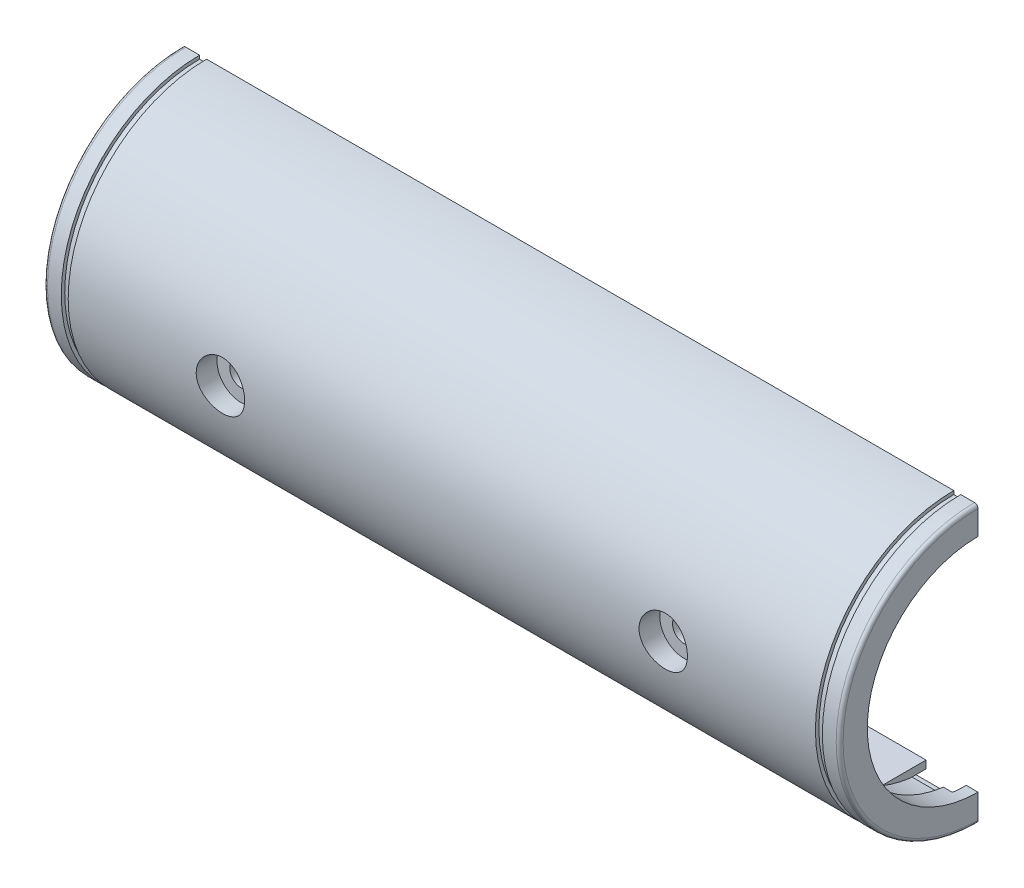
ISO-10303-21;
HEADER;
FILE_DESCRIPTION(('STEP AP214'),'2;1');
FILE_NAME('part.step','',(''),(''),'','','');
FILE_SCHEMA(('AUTOMOTIVE_DESIGN { 1 0 10303 214 1 1 1 1 }'));
ENDSEC;
DATA;
#1=APPLICATION_CONTEXT('core data for automotive mechanical design processes');
#2=APPLICATION_PROTOCOL_DEFINITION('international standard','automotive_design',2000,#1);
#3=PRODUCT_CONTEXT('',#1,'mechanical');
#4=PRODUCT('Part','Part','',(#3));
#5=PRODUCT_RELATED_PRODUCT_CATEGORY('part','',(#4));
#6=PRODUCT_DEFINITION_FORMATION('','',#4);
#7=PRODUCT_DEFINITION_CONTEXT('part definition',#1,'design');
#8=PRODUCT_DEFINITION('design','',#6,#7);
#9=PRODUCT_DEFINITION_SHAPE('','',#8);
#10=(LENGTH_UNIT() NAMED_UNIT(*) SI_UNIT(.MILLI.,.METRE.));
#11=(NAMED_UNIT(*) PLANE_ANGLE_UNIT() SI_UNIT($,.RADIAN.));
#12=(NAMED_UNIT(*) SI_UNIT($,.STERADIAN.) SOLID_ANGLE_UNIT());
#13=UNCERTAINTY_MEASURE_WITH_UNIT(LENGTH_MEASURE(1.E-05),#10,'distance_accuracy_value','');
#14=(GEOMETRIC_REPRESENTATION_CONTEXT(3) GLOBAL_UNCERTAINTY_ASSIGNED_CONTEXT((#13)) GLOBAL_UNIT_ASSIGNED_CONTEXT((#10,
#11,#12)) REPRESENTATION_CONTEXT('',''));
#15=CARTESIAN_POINT('',(0.,0.,0.));
#16=DIRECTION('',(0.,0.,1.));
#17=DIRECTION('',(1.,0.,0.));
#18=AXIS2_PLACEMENT_3D('',#15,#16,#17);
#19=CARTESIAN_POINT('',(0.,0.,0.));
#20=DIRECTION('',(0.,0.,1.));
#21=DIRECTION('',(0.,-1.,0.));
#22=AXIS2_PLACEMENT_3D('',#19,#20,#21);
#23=PLANE('',#22);
#24=DIRECTION('',(0.,1.,0.));
#25=VECTOR('',#24,1.);
#26=CARTESIAN_POINT('',(-50.,-15.7315254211,0.));
#27=LINE('',#26,#25);
#28=CARTESIAN_POINT('',(-50.,-15.7315254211,0.));
#29=VERTEX_POINT('',#28);
#30=CARTESIAN_POINT('',(-50.,-16.8372612,0.));
#31=VERTEX_POINT('',#30);
#32=EDGE_CURVE('E619',#29,#31,#27,.F.);
#33=ORIENTED_EDGE('',*,*,#32,.F.);
#34=DIRECTION('',(1.,0.,0.));
#35=VECTOR('',#34,1.);
#36=CARTESIAN_POINT('',(6.,-15.7315254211,0.));
#37=LINE('',#36,#35);
#38=CARTESIAN_POINT('',(-38.,-15.7315254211,0.));
#39=VERTEX_POINT('',#38);
#40=EDGE_CURVE('E613',#39,#29,#37,.F.);
#41=ORIENTED_EDGE('',*,*,#40,.F.);
#42=DIRECTION('',(0.,-1.,0.));
#43=VECTOR('',#42,1.);
#44=CARTESIAN_POINT('',(-38.,0.,0.));
#45=LINE('',#44,#43);
#46=CARTESIAN_POINT('',(-38.,-16.8372612,0.));
#47=VERTEX_POINT('',#46);
#48=EDGE_CURVE('E766',#47,#39,#45,.F.);
#49=ORIENTED_EDGE('',*,*,#48,.F.);
#50=DIRECTION('',(1.,0.,0.));
#51=VECTOR('',#50,1.);
#52=CARTESIAN_POINT('',(0.,-16.8372612,0.));
#53=LINE('',#52,#51);
#54=EDGE_CURVE('E714',#31,#47,#53,.T.);
#55=ORIENTED_EDGE('',*,*,#54,.F.);
#56=EDGE_LOOP('',(#33,#41,#49,#55));
#57=FACE_BOUND('',#56,.T.);
#58=ADVANCED_FACE('F16',(#57),#23,.F.);
#59=CARTESIAN_POINT('',(0.,0.,0.));
#60=DIRECTION('',(0.,0.,1.));
#61=DIRECTION('',(0.,-1.,0.));
#62=AXIS2_PLACEMENT_3D('',#59,#60,#61);
#63=PLANE('',#62);
#64=DIRECTION('',(1.,0.,0.));
#65=VECTOR('',#64,1.);
#66=CARTESIAN_POINT('',(6.,15.7315254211,0.));
#67=LINE('',#66,#65);
#68=CARTESIAN_POINT('',(-38.,15.7315254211,0.));
#69=VERTEX_POINT('',#68);
#70=CARTESIAN_POINT('',(-50.,15.7315254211,0.));
#71=VERTEX_POINT('',#70);
#72=EDGE_CURVE('E598',#69,#71,#67,.F.);
#73=ORIENTED_EDGE('',*,*,#72,.T.);
#74=DIRECTION('',(0.,1.,0.));
#75=VECTOR('',#74,1.);
#76=CARTESIAN_POINT('',(-50.,-15.7315254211,0.));
#77=LINE('',#76,#75);
#78=CARTESIAN_POINT('',(-50.,16.8372612,0.));
#79=VERTEX_POINT('',#78);
#80=EDGE_CURVE('E592',#79,#71,#77,.F.);
#81=ORIENTED_EDGE('',*,*,#80,.F.);
#82=DIRECTION('',(1.,0.,0.));
#83=VECTOR('',#82,1.);
#84=CARTESIAN_POINT('',(0.,16.8372612,0.));
#85=LINE('',#84,#83);
#86=CARTESIAN_POINT('',(-38.,16.8372612,0.));
#87=VERTEX_POINT('',#86);
#88=EDGE_CURVE('E575',#79,#87,#85,.T.);
#89=ORIENTED_EDGE('',*,*,#88,.T.);
#90=DIRECTION('',(0.,-1.,0.));
#91=VECTOR('',#90,1.);
#92=CARTESIAN_POINT('',(-38.,0.,0.));
#93=LINE('',#92,#91);
#94=EDGE_CURVE('E749',#69,#87,#93,.F.);
#95=ORIENTED_EDGE('',*,*,#94,.F.);
#96=EDGE_LOOP('',(#73,#81,#89,#95));
#97=FACE_BOUND('',#96,.T.);
#98=ADVANCED_FACE('F1469',(#97),#63,.F.);
#99=CARTESIAN_POINT('',(0.,0.,0.));
#100=DIRECTION('',(0.,0.,1.));
#101=DIRECTION('',(0.,-1.,0.));
#102=AXIS2_PLACEMENT_3D('',#99,#100,#101);
#103=PLANE('',#102);
#104=DIRECTION('',(1.,0.,0.));
#105=VECTOR('',#104,1.);
#106=CARTESIAN_POINT('',(6.,15.7315254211,0.));
#107=LINE('',#106,#105);
#108=CARTESIAN_POINT('',(-16.,15.7315254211,0.));
#109=VERTEX_POINT('',#108);
#110=CARTESIAN_POINT('',(-28.,15.7315254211,0.));
#111=VERTEX_POINT('',#110);
#112=EDGE_CURVE('E545',#109,#111,#107,.F.);
#113=ORIENTED_EDGE('',*,*,#112,.T.);
#114=DIRECTION('',(0.,-1.,0.));
#115=VECTOR('',#114,1.);
#116=CARTESIAN_POINT('',(-28.,0.,0.));
#117=LINE('',#116,#115);
#118=CARTESIAN_POINT('',(-28.,16.8372612,0.));
#119=VERTEX_POINT('',#118);
#120=EDGE_CURVE('E715',#119,#111,#117,.T.);
#121=ORIENTED_EDGE('',*,*,#120,.F.);
#122=DIRECTION('',(1.,0.,0.));
#123=VECTOR('',#122,1.);
#124=CARTESIAN_POINT('',(0.,16.8372612,0.));
#125=LINE('',#124,#123);
#126=CARTESIAN_POINT('',(-16.,16.8372612,0.));
#127=VERTEX_POINT('',#126);
#128=EDGE_CURVE('E569',#119,#127,#125,.T.);
#129=ORIENTED_EDGE('',*,*,#128,.T.);
#130=DIRECTION('',(0.,1.,0.));
#131=VECTOR('',#130,1.);
#132=CARTESIAN_POINT('',(-16.,-16.8372612,0.));
#133=LINE('',#132,#131);
#134=EDGE_CURVE('E563',#109,#127,#133,.T.);
#135=ORIENTED_EDGE('',*,*,#134,.F.);
#136=EDGE_LOOP('',(#113,#121,#129,#135));
#137=FACE_BOUND('',#136,.T.);
#138=ADVANCED_FACE('F1466',(#137),#103,.F.);
#139=CARTESIAN_POINT('',(0.,0.,0.));
#140=DIRECTION('',(0.,0.,1.));
#141=DIRECTION('',(0.,-1.,0.));
#142=AXIS2_PLACEMENT_3D('',#139,#140,#141);
#143=PLANE('',#142);
#144=DIRECTION('',(0.,1.,0.));
#145=VECTOR('',#144,1.);
#146=CARTESIAN_POINT('',(-28.,-15.7315254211,0.));
#147=LINE('',#146,#145);
#148=CARTESIAN_POINT('',(-28.,-15.7315254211,0.));
#149=VERTEX_POINT('',#148);
#150=CARTESIAN_POINT('',(-28.,-16.8372612,0.));
#151=VERTEX_POINT('',#150);
#152=EDGE_CURVE('E512',#149,#151,#147,.F.);
#153=ORIENTED_EDGE('',*,*,#152,.F.);
#154=DIRECTION('',(1.,0.,0.));
#155=VECTOR('',#154,1.);
#156=CARTESIAN_POINT('',(6.,-15.7315254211,0.));
#157=LINE('',#156,#155);
#158=CARTESIAN_POINT('',(-16.,-15.7315254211,0.));
#159=VERTEX_POINT('',#158);
#160=EDGE_CURVE('E522',#159,#149,#157,.F.);
#161=ORIENTED_EDGE('',*,*,#160,.F.);
#162=DIRECTION('',(0.,1.,0.));
#163=VECTOR('',#162,1.);
#164=CARTESIAN_POINT('',(-16.,-16.8372612,0.));
#165=LINE('',#164,#163);
#166=CARTESIAN_POINT('',(-16.,-16.8372612,0.));
#167=VERTEX_POINT('',#166);
#168=EDGE_CURVE('E730',#167,#159,#165,.T.);
#169=ORIENTED_EDGE('',*,*,#168,.F.);
#170=DIRECTION('',(1.,0.,0.));
#171=VECTOR('',#170,1.);
#172=CARTESIAN_POINT('',(0.,-16.8372612,0.));
#173=LINE('',#172,#171);
#174=EDGE_CURVE('E530',#151,#167,#173,.T.);
#175=ORIENTED_EDGE('',*,*,#174,.F.);
#176=EDGE_LOOP('',(#153,#161,#169,#175));
#177=FACE_BOUND('',#176,.T.);
#178=ADVANCED_FACE('F1462',(#177),#143,.F.);
#179=CARTESIAN_POINT('',(0.,0.,0.));
#180=DIRECTION('',(0.,0.,1.));
#181=DIRECTION('',(0.,-1.,0.));
#182=AXIS2_PLACEMENT_3D('',#179,#180,#181);
#183=PLANE('',#182);
#184=DIRECTION('',(0.,1.,0.));
#185=VECTOR('',#184,1.);
#186=CARTESIAN_POINT('',(6.,-15.7315254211,0.));
#187=LINE('',#186,#185);
#188=CARTESIAN_POINT('',(6.,16.8372612,0.));
#189=VERTEX_POINT('',#188);
#190=CARTESIAN_POINT('',(6.,15.7315254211,0.));
#191=VERTEX_POINT('',#190);
#192=EDGE_CURVE('E499',#189,#191,#187,.F.);
#193=ORIENTED_EDGE('',*,*,#192,.T.);
#194=DIRECTION('',(1.,0.,0.));
#195=VECTOR('',#194,1.);
#196=CARTESIAN_POINT('',(6.,15.7315254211,0.));
#197=LINE('',#196,#195);
#198=CARTESIAN_POINT('',(-6.,15.7315254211,0.));
#199=VERTEX_POINT('',#198);
#200=EDGE_CURVE('E486',#191,#199,#197,.F.);
#201=ORIENTED_EDGE('',*,*,#200,.T.);
#202=DIRECTION('',(0.,-1.,0.));
#203=VECTOR('',#202,1.);
#204=CARTESIAN_POINT('',(-6.,0.,0.));
#205=LINE('',#204,#203);
#206=CARTESIAN_POINT('',(-6.,16.8372612,0.));
#207=VERTEX_POINT('',#206);
#208=EDGE_CURVE('E711',#207,#199,#205,.T.);
#209=ORIENTED_EDGE('',*,*,#208,.F.);
#210=DIRECTION('',(1.,0.,0.));
#211=VECTOR('',#210,1.);
#212=CARTESIAN_POINT('',(0.,16.8372612,0.));
#213=LINE('',#212,#211);
#214=EDGE_CURVE('E505',#207,#189,#213,.T.);
#215=ORIENTED_EDGE('',*,*,#214,.T.);
#216=EDGE_LOOP('',(#193,#201,#209,#215));
#217=FACE_BOUND('',#216,.T.);
#218=ADVANCED_FACE('F1458',(#217),#183,.F.);
#219=CARTESIAN_POINT('',(0.,0.,0.));
#220=DIRECTION('',(0.,0.,1.));
#221=DIRECTION('',(0.,-1.,0.));
#222=AXIS2_PLACEMENT_3D('',#219,#220,#221);
#223=PLANE('',#222);
#224=DIRECTION('',(0.,1.,0.));
#225=VECTOR('',#224,1.);
#226=CARTESIAN_POINT('',(6.,-15.7315254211,0.));
#227=LINE('',#226,#225);
#228=CARTESIAN_POINT('',(6.,-15.7315254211,0.));
#229=VERTEX_POINT('',#228);
#230=CARTESIAN_POINT('',(6.,-16.8372612,0.));
#231=VERTEX_POINT('',#230);
#232=EDGE_CURVE('E449',#229,#231,#227,.F.);
#233=ORIENTED_EDGE('',*,*,#232,.T.);
#234=DIRECTION('',(1.,0.,0.));
#235=VECTOR('',#234,1.);
#236=CARTESIAN_POINT('',(0.,-16.8372612,0.));
#237=LINE('',#236,#235);
#238=CARTESIAN_POINT('',(-6.,-16.8372612,0.));
#239=VERTEX_POINT('',#238);
#240=EDGE_CURVE('E461',#239,#231,#237,.T.);
#241=ORIENTED_EDGE('',*,*,#240,.F.);
#242=DIRECTION('',(0.,1.,0.));
#243=VECTOR('',#242,1.);
#244=CARTESIAN_POINT('',(-6.,-15.7315254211,0.));
#245=LINE('',#244,#243);
#246=CARTESIAN_POINT('',(-6.,-15.7315254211,0.));
#247=VERTEX_POINT('',#246);
#248=EDGE_CURVE('E480',#247,#239,#245,.F.);
#249=ORIENTED_EDGE('',*,*,#248,.F.);
#250=DIRECTION('',(1.,0.,0.));
#251=VECTOR('',#250,1.);
#252=CARTESIAN_POINT('',(6.,-15.7315254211,0.));
#253=LINE('',#252,#251);
#254=EDGE_CURVE('E469',#229,#247,#253,.F.);
#255=ORIENTED_EDGE('',*,*,#254,.F.);
#256=EDGE_LOOP('',(#233,#241,#249,#255));
#257=FACE_BOUND('',#256,.T.);
#258=ADVANCED_FACE('F1454',(#257),#223,.F.);
#259=CARTESIAN_POINT('',(0.,0.,0.));
#260=DIRECTION('',(0.,0.,1.));
#261=DIRECTION('',(0.,-1.,0.));
#262=AXIS2_PLACEMENT_3D('',#259,#260,#261);
#263=PLANE('',#262);
#264=DIRECTION('',(1.,0.,0.));
#265=VECTOR('',#264,1.);
#266=CARTESIAN_POINT('',(6.,-15.7315254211,0.));
#267=LINE('',#266,#265);
#268=CARTESIAN_POINT('',(28.,-15.7315254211,0.));
#269=VERTEX_POINT('',#268);
#270=CARTESIAN_POINT('',(16.,-15.7315254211,0.));
#271=VERTEX_POINT('',#270);
#272=EDGE_CURVE('E430',#269,#271,#267,.F.);
#273=ORIENTED_EDGE('',*,*,#272,.F.);
#274=DIRECTION('',(0.,1.,0.));
#275=VECTOR('',#274,1.);
#276=CARTESIAN_POINT('',(28.,-15.7315254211,0.));
#277=LINE('',#276,#275);
#278=CARTESIAN_POINT('',(28.,-16.8372612,0.));
#279=VERTEX_POINT('',#278);
#280=EDGE_CURVE('E460',#269,#279,#277,.F.);
#281=ORIENTED_EDGE('',*,*,#280,.T.);
#282=DIRECTION('',(1.,0.,0.));
#283=VECTOR('',#282,1.);
#284=CARTESIAN_POINT('',(0.,-16.8372612,0.));
#285=LINE('',#284,#283);
#286=CARTESIAN_POINT('',(16.,-16.8372612,0.));
#287=VERTEX_POINT('',#286);
#288=EDGE_CURVE('E438',#287,#279,#285,.T.);
#289=ORIENTED_EDGE('',*,*,#288,.F.);
#290=DIRECTION('',(0.,1.,0.));
#291=VECTOR('',#290,1.);
#292=CARTESIAN_POINT('',(16.,-16.8372612,0.));
#293=LINE('',#292,#291);
#294=EDGE_CURVE('E419',#287,#271,#293,.T.);
#295=ORIENTED_EDGE('',*,*,#294,.T.);
#296=EDGE_LOOP('',(#273,#281,#289,#295));
#297=FACE_BOUND('',#296,.T.);
#298=ADVANCED_FACE('F1450',(#297),#263,.F.);
#299=CARTESIAN_POINT('',(0.,0.,0.));
#300=DIRECTION('',(0.,0.,1.));
#301=DIRECTION('',(0.,-1.,0.));
#302=AXIS2_PLACEMENT_3D('',#299,#300,#301);
#303=PLANE('',#302);
#304=DIRECTION('',(0.,1.,0.));
#305=VECTOR('',#304,1.);
#306=CARTESIAN_POINT('',(50.,-15.7315254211,0.));
#307=LINE('',#306,#305);
#308=CARTESIAN_POINT('',(50.,16.8372612,0.));
#309=VERTEX_POINT('',#308);
#310=CARTESIAN_POINT('',(50.,15.7315254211,0.));
#311=VERTEX_POINT('',#310);
#312=EDGE_CURVE('E389',#309,#311,#307,.F.);
#313=ORIENTED_EDGE('',*,*,#312,.T.);
#314=DIRECTION('',(1.,0.,0.));
#315=VECTOR('',#314,1.);
#316=CARTESIAN_POINT('',(6.,15.7315254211,0.));
#317=LINE('',#316,#315);
#318=CARTESIAN_POINT('',(38.,15.7315254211,0.));
#319=VERTEX_POINT('',#318);
#320=EDGE_CURVE('E400',#311,#319,#317,.F.);
#321=ORIENTED_EDGE('',*,*,#320,.T.);
#322=DIRECTION('',(0.,1.,0.));
#323=VECTOR('',#322,1.);
#324=CARTESIAN_POINT('',(38.,-16.8372612,0.));
#325=LINE('',#324,#323);
#326=CARTESIAN_POINT('',(38.,16.8372612,0.));
#327=VERTEX_POINT('',#326);
#328=EDGE_CURVE('E409',#319,#327,#325,.T.);
#329=ORIENTED_EDGE('',*,*,#328,.T.);
#330=DIRECTION('',(1.,0.,0.));
#331=VECTOR('',#330,1.);
#332=CARTESIAN_POINT('',(0.,16.8372612,0.));
#333=LINE('',#332,#331);
#334=EDGE_CURVE('E390',#327,#309,#333,.T.);
#335=ORIENTED_EDGE('',*,*,#334,.T.);
#336=EDGE_LOOP('',(#313,#321,#329,#335));
#337=FACE_BOUND('',#336,.T.);
#338=ADVANCED_FACE('F1446',(#337),#303,.F.);
#339=CARTESIAN_POINT('',(0.,0.,0.));
#340=DIRECTION('',(0.,0.,1.));
#341=DIRECTION('',(0.,-1.,0.));
#342=AXIS2_PLACEMENT_3D('',#339,#340,#341);
#343=PLANE('',#342);
#344=DIRECTION('',(0.,1.,0.));
#345=VECTOR('',#344,1.);
#346=CARTESIAN_POINT('',(28.,-15.7315254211,0.));
#347=LINE('',#346,#345);
#348=CARTESIAN_POINT('',(28.,16.8372612,0.));
#349=VERTEX_POINT('',#348);
#350=CARTESIAN_POINT('',(28.,15.7315254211,0.));
#351=VERTEX_POINT('',#350);
#352=EDGE_CURVE('E378',#349,#351,#347,.F.);
#353=ORIENTED_EDGE('',*,*,#352,.T.);
#354=DIRECTION('',(1.,0.,0.));
#355=VECTOR('',#354,1.);
#356=CARTESIAN_POINT('',(6.,15.7315254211,0.));
#357=LINE('',#356,#355);
#358=CARTESIAN_POINT('',(16.,15.7315254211,0.));
#359=VERTEX_POINT('',#358);
#360=EDGE_CURVE('E358',#351,#359,#357,.F.);
#361=ORIENTED_EDGE('',*,*,#360,.T.);
#362=DIRECTION('',(0.,1.,0.));
#363=VECTOR('',#362,1.);
#364=CARTESIAN_POINT('',(16.,-16.8372612,0.));
#365=LINE('',#364,#363);
#366=CARTESIAN_POINT('',(16.,16.8372612,0.));
#367=VERTEX_POINT('',#366);
#368=EDGE_CURVE('E357',#359,#367,#365,.T.);
#369=ORIENTED_EDGE('',*,*,#368,.T.);
#370=DIRECTION('',(1.,0.,0.));
#371=VECTOR('',#370,1.);
#372=CARTESIAN_POINT('',(0.,16.8372612,0.));
#373=LINE('',#372,#371);
#374=EDGE_CURVE('E368',#367,#349,#373,.T.);
#375=ORIENTED_EDGE('',*,*,#374,.T.);
#376=EDGE_LOOP('',(#353,#361,#369,#375));
#377=FACE_BOUND('',#376,.T.);
#378=ADVANCED_FACE('F1442',(#377),#343,.F.);
#379=CARTESIAN_POINT('',(0.,0.,0.));
#380=DIRECTION('',(0.,0.,1.));
#381=DIRECTION('',(0.,-1.,0.));
#382=AXIS2_PLACEMENT_3D('',#379,#380,#381);
#383=PLANE('',#382);
#384=DIRECTION('',(1.,0.,0.));
#385=VECTOR('',#384,1.);
#386=CARTESIAN_POINT('',(6.,-15.7315254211,0.));
#387=LINE('',#386,#385);
#388=CARTESIAN_POINT('',(50.,-15.7315254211,0.));
#389=VERTEX_POINT('',#388);
#390=CARTESIAN_POINT('',(38.,-15.7315254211,0.));
#391=VERTEX_POINT('',#390);
#392=EDGE_CURVE('E338',#389,#391,#387,.F.);
#393=ORIENTED_EDGE('',*,*,#392,.F.);
#394=DIRECTION('',(0.,1.,0.));
#395=VECTOR('',#394,1.);
#396=CARTESIAN_POINT('',(50.,-15.7315254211,0.));
#397=LINE('',#396,#395);
#398=CARTESIAN_POINT('',(50.,-16.8372612,0.));
#399=VERTEX_POINT('',#398);
#400=EDGE_CURVE('E630',#389,#399,#397,.F.);
#401=ORIENTED_EDGE('',*,*,#400,.T.);
#402=DIRECTION('',(1.,0.,0.));
#403=VECTOR('',#402,1.);
#404=CARTESIAN_POINT('',(0.,-16.8372612,0.));
#405=LINE('',#404,#403);
#406=CARTESIAN_POINT('',(38.,-16.8372612,0.));
#407=VERTEX_POINT('',#406);
#408=EDGE_CURVE('E346',#407,#399,#405,.T.);
#409=ORIENTED_EDGE('',*,*,#408,.F.);
#410=DIRECTION('',(0.,1.,0.));
#411=VECTOR('',#410,1.);
#412=CARTESIAN_POINT('',(38.,-16.8372612,0.));
#413=LINE('',#412,#411);
#414=EDGE_CURVE('E326',#407,#391,#413,.T.);
#415=ORIENTED_EDGE('',*,*,#414,.T.);
#416=EDGE_LOOP('',(#393,#401,#409,#415));
#417=FACE_BOUND('',#416,.T.);
#418=ADVANCED_FACE('F1438',(#417),#383,.F.);
#419=CARTESIAN_POINT('',(0.,0.,15.7));
#420=DIRECTION('',(0.,0.,1.));
#421=DIRECTION('',(1.,0.,0.));
#422=AXIS2_PLACEMENT_3D('',#419,#420,#421);
#423=PLANE('',#422);
#424=CARTESIAN_POINT('',(-32.000000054,1.93409999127E-09,15.7));
#425=DIRECTION('',(0.,0.,1.));
#426=DIRECTION('',(1.,0.,0.));
#427=AXIS2_PLACEMENT_3D('',#424,#425,#426);
#428=CIRCLE('',#427,3.5);
#429=CARTESIAN_POINT('',(-28.500000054,1.93409999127E-09,15.7));
#430=VERTEX_POINT('',#429);
#431=EDGE_CURVE('E337',#430,#430,#428,.F.);
#432=ORIENTED_EDGE('',*,*,#431,.F.);
#433=EDGE_LOOP('',(#432));
#434=FACE_BOUND('',#433,.T.);
#435=CARTESIAN_POINT('',(-32.000000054,1.93409732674E-09,15.7));
#436=DIRECTION('',(0.,0.,-1.));
#437=DIRECTION('',(-1.,0.,0.));
#438=AXIS2_PLACEMENT_3D('',#435,#436,#437);
#439=CIRCLE('',#438,5.);
#440=CARTESIAN_POINT('',(-37.000000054,1.93409732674E-09,15.7));
#441=VERTEX_POINT('',#440);
#442=EDGE_CURVE('E19',#441,#441,#439,.F.);
#443=ORIENTED_EDGE('',*,*,#442,.F.);
#444=EDGE_LOOP('',(#443));
#445=FACE_BOUND('',#444,.T.);
#446=ADVANCED_FACE('F1434',(#434,#445),#423,.F.);
#447=CARTESIAN_POINT('',(0.,0.,15.7));
#448=DIRECTION('',(0.,0.,1.));
#449=DIRECTION('',(1.,0.,0.));
#450=AXIS2_PLACEMENT_3D('',#447,#448,#449);
#451=PLANE('',#450);
#452=CARTESIAN_POINT('',(32.000000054,1.93409999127E-09,15.7));
#453=DIRECTION('',(0.,0.,-1.));
#454=DIRECTION('',(-1.,0.,0.));
#455=AXIS2_PLACEMENT_3D('',#452,#453,#454);
#456=CIRCLE('',#455,3.5);
#457=CARTESIAN_POINT('',(28.500000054,1.93409999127E-09,15.7));
#458=VERTEX_POINT('',#457);
#459=EDGE_CURVE('E1501',#458,#458,#456,.T.);
#460=ORIENTED_EDGE('',*,*,#459,.F.);
#461=EDGE_LOOP('',(#460));
#462=FACE_BOUND('',#461,.T.);
#463=CARTESIAN_POINT('',(32.000000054,1.93409732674E-09,15.7));
#464=DIRECTION('',(0.,0.,1.));
#465=DIRECTION('',(1.,0.,0.));
#466=AXIS2_PLACEMENT_3D('',#463,#464,#465);
#467=CIRCLE('',#466,5.);
#468=CARTESIAN_POINT('',(37.000000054,1.93409732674E-09,15.7));
#469=VERTEX_POINT('',#468);
#470=EDGE_CURVE('E383',#469,#469,#467,.T.);
#471=ORIENTED_EDGE('',*,*,#470,.F.);
#472=EDGE_LOOP('',(#471));
#473=FACE_BOUND('',#472,.T.);
#474=ADVANCED_FACE('F1431',(#462,#473),#451,.F.);
#475=CARTESIAN_POINT('',(0.,-16.8372612,0.));
#476=DIRECTION('',(0.,-1.,0.));
#477=DIRECTION('',(0.,0.,-1.));
#478=AXIS2_PLACEMENT_3D('',#475,#476,#477);
#479=PLANE('',#478);
#480=ORIENTED_EDGE('',*,*,#54,.T.);
#481=DIRECTION('',(0.,0.,-1.));
#482=VECTOR('',#481,1.);
#483=CARTESIAN_POINT('',(-38.,-16.8372612,0.));
#484=LINE('',#483,#482);
#485=CARTESIAN_POINT('',(-38.,-16.837261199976,2.34662210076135));
#486=VERTEX_POINT('',#485);
#487=EDGE_CURVE('E599',#486,#47,#484,.T.);
#488=ORIENTED_EDGE('',*,*,#487,.F.);
#489=DIRECTION('',(1.,0.,0.));
#490=VECTOR('',#489,1.);
#491=CARTESIAN_POINT('',(28.75,-16.8372611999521,2.34662210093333));
#492=LINE('',#491,#490);
#493=CARTESIAN_POINT('',(-50.,-16.837261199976,2.34662210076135));
#494=VERTEX_POINT('',#493);
#495=EDGE_CURVE('E301',#486,#494,#492,.F.);
#496=ORIENTED_EDGE('',*,*,#495,.T.);
#497=DIRECTION('',(0.,0.,1.));
#498=VECTOR('',#497,1.);
#499=CARTESIAN_POINT('',(-50.,-16.8372612,0.));
#500=LINE('',#499,#498);
#501=EDGE_CURVE('E616',#31,#494,#500,.T.);
#502=ORIENTED_EDGE('',*,*,#501,.F.);
#503=EDGE_LOOP('',(#480,#488,#496,#502));
#504=FACE_BOUND('',#503,.T.);
#505=ADVANCED_FACE('F1404',(#504),#479,.T.);
#506=CARTESIAN_POINT('',(-50.,-15.7315254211,0.));
#507=DIRECTION('',(-1.,0.,0.));
#508=DIRECTION('',(0.,0.,1.));
#509=AXIS2_PLACEMENT_3D('',#506,#507,#508);
#510=PLANE('',#509);
#511=ORIENTED_EDGE('',*,*,#501,.T.);
#512=CARTESIAN_POINT('',(-50.,0.,0.));
#513=DIRECTION('',(1.,0.,0.));
#514=DIRECTION('',(0.,0.,-1.));
#515=AXIS2_PLACEMENT_3D('',#512,#513,#514);
#516=CIRCLE('',#515,17.);
#517=CARTESIAN_POINT('',(-50.,-15.7315254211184,6.44353225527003));
#518=VERTEX_POINT('',#517);
#519=EDGE_CURVE('E609',#494,#518,#516,.F.);
#520=ORIENTED_EDGE('',*,*,#519,.T.);
#521=DIRECTION('',(0.,0.,1.));
#522=VECTOR('',#521,1.);
#523=CARTESIAN_POINT('',(-50.,-15.7315254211,0.));
#524=LINE('',#523,#522);
#525=EDGE_CURVE('E604',#29,#518,#524,.T.);
#526=ORIENTED_EDGE('',*,*,#525,.F.);
#527=ORIENTED_EDGE('',*,*,#32,.T.);
#528=EDGE_LOOP('',(#511,#520,#526,#527));
#529=FACE_BOUND('',#528,.T.);
#530=ADVANCED_FACE('F1414',(#529),#510,.T.);
#531=CARTESIAN_POINT('',(6.,-15.7315254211,0.));
#532=DIRECTION('',(0.,1.,0.));
#533=DIRECTION('',(0.,0.,1.));
#534=AXIS2_PLACEMENT_3D('',#531,#532,#533);
#535=PLANE('',#534);
#536=ORIENTED_EDGE('',*,*,#40,.T.);
#537=ORIENTED_EDGE('',*,*,#525,.T.);
#538=DIRECTION('',(1.,0.,0.));
#539=VECTOR('',#538,1.);
#540=CARTESIAN_POINT('',(28.75,-15.7315254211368,6.44353225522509));
#541=LINE('',#540,#539);
#542=CARTESIAN_POINT('',(-38.,-15.7315254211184,6.44353225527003));
#543=VERTEX_POINT('',#542);
#544=EDGE_CURVE('E607',#518,#543,#541,.T.);
#545=ORIENTED_EDGE('',*,*,#544,.T.);
#546=DIRECTION('',(0.,0.,-1.));
#547=VECTOR('',#546,1.);
#548=CARTESIAN_POINT('',(-38.,-15.7315254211,0.));
#549=LINE('',#548,#547);
#550=EDGE_CURVE('E595',#39,#543,#549,.F.);
#551=ORIENTED_EDGE('',*,*,#550,.F.);
#552=EDGE_LOOP('',(#536,#537,#545,#551));
#553=FACE_BOUND('',#552,.T.);
#554=ADVANCED_FACE('F1417',(#553),#535,.T.);
#555=CARTESIAN_POINT('',(-38.,-16.8372612,0.));
#556=DIRECTION('',(1.,0.,0.));
#557=DIRECTION('',(0.,0.,-1.));
#558=AXIS2_PLACEMENT_3D('',#555,#556,#557);
#559=PLANE('',#558);
#560=ORIENTED_EDGE('',*,*,#550,.T.);
#561=CARTESIAN_POINT('',(-38.,0.,0.));
#562=DIRECTION('',(1.,0.,0.));
#563=DIRECTION('',(0.,0.,-1.));
#564=AXIS2_PLACEMENT_3D('',#561,#562,#563);
#565=CIRCLE('',#564,17.);
#566=EDGE_CURVE('E583',#543,#486,#565,.T.);
#567=ORIENTED_EDGE('',*,*,#566,.T.);
#568=ORIENTED_EDGE('',*,*,#487,.T.);
#569=ORIENTED_EDGE('',*,*,#48,.T.);
#570=EDGE_LOOP('',(#560,#567,#568,#569));
#571=FACE_BOUND('',#570,.T.);
#572=ADVANCED_FACE('F1406',(#571),#559,.T.);
#573=CARTESIAN_POINT('',(6.,15.7315254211,0.));
#574=DIRECTION('',(0.,1.,0.));
#575=DIRECTION('',(0.,0.,1.));
#576=AXIS2_PLACEMENT_3D('',#573,#574,#575);
#577=PLANE('',#576);
#578=ORIENTED_EDGE('',*,*,#72,.F.);
#579=DIRECTION('',(0.,0.,-1.));
#580=VECTOR('',#579,1.);
#581=CARTESIAN_POINT('',(-38.,15.7315254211,0.));
#582=LINE('',#581,#580);
#583=CARTESIAN_POINT('',(-38.,15.7315254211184,6.44353225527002));
#584=VERTEX_POINT('',#583);
#585=EDGE_CURVE('E570',#584,#69,#582,.T.);
#586=ORIENTED_EDGE('',*,*,#585,.F.);
#587=DIRECTION('',(1.,0.,0.));
#588=VECTOR('',#587,1.);
#589=CARTESIAN_POINT('',(28.75,15.7315254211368,6.44353225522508));
#590=LINE('',#589,#588);
#591=CARTESIAN_POINT('',(-50.,15.7315254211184,6.44353225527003));
#592=VERTEX_POINT('',#591);
#593=EDGE_CURVE('E581',#584,#592,#590,.F.);
#594=ORIENTED_EDGE('',*,*,#593,.T.);
#595=DIRECTION('',(0.,0.,1.));
#596=VECTOR('',#595,1.);
#597=CARTESIAN_POINT('',(-50.,15.7315254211,0.));
#598=LINE('',#597,#596);
#599=EDGE_CURVE('E587',#71,#592,#598,.T.);
#600=ORIENTED_EDGE('',*,*,#599,.F.);
#601=EDGE_LOOP('',(#578,#586,#594,#600));
#602=FACE_BOUND('',#601,.T.);
#603=ADVANCED_FACE('F1424',(#602),#577,.F.);
#604=CARTESIAN_POINT('',(-50.,-15.7315254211,0.));
#605=DIRECTION('',(-1.,0.,0.));
#606=DIRECTION('',(0.,0.,1.));
#607=AXIS2_PLACEMENT_3D('',#604,#605,#606);
#608=PLANE('',#607);
#609=ORIENTED_EDGE('',*,*,#80,.T.);
#610=ORIENTED_EDGE('',*,*,#599,.T.);
#611=CARTESIAN_POINT('',(-50.,0.,0.));
#612=DIRECTION('',(1.,0.,0.));
#613=DIRECTION('',(0.,0.,-1.));
#614=AXIS2_PLACEMENT_3D('',#611,#612,#613);
#615=CIRCLE('',#614,17.);
#616=CARTESIAN_POINT('',(-50.,16.837261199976,2.34662210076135));
#617=VERTEX_POINT('',#616);
#618=EDGE_CURVE('E580',#592,#617,#615,.F.);
#619=ORIENTED_EDGE('',*,*,#618,.T.);
#620=DIRECTION('',(0.,0.,-1.));
#621=VECTOR('',#620,1.);
#622=CARTESIAN_POINT('',(-50.,16.8372612,0.));
#623=LINE('',#622,#621);
#624=EDGE_CURVE('E584',#617,#79,#623,.T.);
#625=ORIENTED_EDGE('',*,*,#624,.T.);
#626=EDGE_LOOP('',(#609,#610,#619,#625));
#627=FACE_BOUND('',#626,.T.);
#628=ADVANCED_FACE('F1483',(#627),#608,.T.);
#629=CARTESIAN_POINT('',(0.,16.8372612,0.));
#630=DIRECTION('',(0.,-1.,0.));
#631=DIRECTION('',(0.,0.,-1.));
#632=AXIS2_PLACEMENT_3D('',#629,#630,#631);
#633=PLANE('',#632);
#634=ORIENTED_EDGE('',*,*,#88,.F.);
#635=ORIENTED_EDGE('',*,*,#624,.F.);
#636=DIRECTION('',(1.,0.,0.));
#637=VECTOR('',#636,1.);
#638=CARTESIAN_POINT('',(28.75,16.8372611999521,2.34662210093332));
#639=LINE('',#638,#637);
#640=CARTESIAN_POINT('',(-38.,16.837261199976,2.34662210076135));
#641=VERTEX_POINT('',#640);
#642=EDGE_CURVE('E578',#617,#641,#639,.T.);
#643=ORIENTED_EDGE('',*,*,#642,.T.);
#644=DIRECTION('',(0.,0.,-1.));
#645=VECTOR('',#644,1.);
#646=CARTESIAN_POINT('',(-38.,16.8372612,0.));
#647=LINE('',#646,#645);
#648=EDGE_CURVE('E566',#87,#641,#647,.F.);
#649=ORIENTED_EDGE('',*,*,#648,.F.);
#650=EDGE_LOOP('',(#634,#635,#643,#649));
#651=FACE_BOUND('',#650,.T.);
#652=ADVANCED_FACE('F1489',(#651),#633,.F.);
#653=CARTESIAN_POINT('',(-38.,-16.8372612,0.));
#654=DIRECTION('',(1.,0.,0.));
#655=DIRECTION('',(0.,0.,-1.));
#656=AXIS2_PLACEMENT_3D('',#653,#654,#655);
#657=PLANE('',#656);
#658=ORIENTED_EDGE('',*,*,#94,.T.);
#659=ORIENTED_EDGE('',*,*,#648,.T.);
#660=CARTESIAN_POINT('',(-38.,0.,0.));
#661=DIRECTION('',(1.,0.,0.));
#662=DIRECTION('',(0.,0.,-1.));
#663=AXIS2_PLACEMENT_3D('',#660,#661,#662);
#664=CIRCLE('',#663,17.);
#665=EDGE_CURVE('E554',#641,#584,#664,.T.);
#666=ORIENTED_EDGE('',*,*,#665,.T.);
#667=ORIENTED_EDGE('',*,*,#585,.T.);
#668=EDGE_LOOP('',(#658,#659,#666,#667));
#669=FACE_BOUND('',#668,.T.);
#670=ADVANCED_FACE('F1493',(#669),#657,.T.);
#671=CARTESIAN_POINT('',(0.,16.8372612,0.));
#672=DIRECTION('',(0.,-1.,0.));
#673=DIRECTION('',(0.,0.,-1.));
#674=AXIS2_PLACEMENT_3D('',#671,#672,#673);
#675=PLANE('',#674);
#676=ORIENTED_EDGE('',*,*,#128,.F.);
#677=DIRECTION('',(0.,0.,1.));
#678=VECTOR('',#677,1.);
#679=CARTESIAN_POINT('',(-28.,16.8372612,0.));
#680=LINE('',#679,#678);
#681=CARTESIAN_POINT('',(-28.,16.837261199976,2.34662210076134));
#682=VERTEX_POINT('',#681);
#683=EDGE_CURVE('E540',#682,#119,#680,.F.);
#684=ORIENTED_EDGE('',*,*,#683,.F.);
#685=DIRECTION('',(1.,0.,0.));
#686=VECTOR('',#685,1.);
#687=CARTESIAN_POINT('',(28.75,16.8372611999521,2.34662210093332));
#688=LINE('',#687,#686);
#689=CARTESIAN_POINT('',(-16.,16.837261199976,2.34662210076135));
#690=VERTEX_POINT('',#689);
#691=EDGE_CURVE('E552',#682,#690,#688,.T.);
#692=ORIENTED_EDGE('',*,*,#691,.T.);
#693=DIRECTION('',(0.,0.,-1.));
#694=VECTOR('',#693,1.);
#695=CARTESIAN_POINT('',(-16.,16.8372612,0.));
#696=LINE('',#695,#694);
#697=EDGE_CURVE('E558',#127,#690,#696,.F.);
#698=ORIENTED_EDGE('',*,*,#697,.F.);
#699=EDGE_LOOP('',(#676,#684,#692,#698));
#700=FACE_BOUND('',#699,.T.);
#701=ADVANCED_FACE('F1565',(#700),#675,.F.);
#702=CARTESIAN_POINT('',(-16.,-16.8372612,0.));
#703=DIRECTION('',(1.,0.,0.));
#704=DIRECTION('',(0.,0.,-1.));
#705=AXIS2_PLACEMENT_3D('',#702,#703,#704);
#706=PLANE('',#705);
#707=ORIENTED_EDGE('',*,*,#134,.T.);
#708=ORIENTED_EDGE('',*,*,#697,.T.);
#709=CARTESIAN_POINT('',(-16.,0.,0.));
#710=DIRECTION('',(1.,0.,0.));
#711=DIRECTION('',(0.,0.,-1.));
#712=AXIS2_PLACEMENT_3D('',#709,#710,#711);
#713=CIRCLE('',#712,17.);
#714=CARTESIAN_POINT('',(-16.,15.7315254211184,6.44353225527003));
#715=VERTEX_POINT('',#714);
#716=EDGE_CURVE('E551',#690,#715,#713,.T.);
#717=ORIENTED_EDGE('',*,*,#716,.T.);
#718=DIRECTION('',(0.,0.,1.));
#719=VECTOR('',#718,1.);
#720=CARTESIAN_POINT('',(-16.,15.7315254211,0.));
#721=LINE('',#720,#719);
#722=EDGE_CURVE('E555',#715,#109,#721,.F.);
#723=ORIENTED_EDGE('',*,*,#722,.T.);
#724=EDGE_LOOP('',(#707,#708,#717,#723));
#725=FACE_BOUND('',#724,.T.);
#726=ADVANCED_FACE('F1561',(#725),#706,.T.);
#727=CARTESIAN_POINT('',(6.,15.7315254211,0.));
#728=DIRECTION('',(0.,1.,0.));
#729=DIRECTION('',(0.,0.,1.));
#730=AXIS2_PLACEMENT_3D('',#727,#728,#729);
#731=PLANE('',#730);
#732=ORIENTED_EDGE('',*,*,#112,.F.);
#733=ORIENTED_EDGE('',*,*,#722,.F.);
#734=DIRECTION('',(1.,0.,0.));
#735=VECTOR('',#734,1.);
#736=CARTESIAN_POINT('',(28.75,15.7315254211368,6.44353225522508));
#737=LINE('',#736,#735);
#738=CARTESIAN_POINT('',(-28.,15.7315254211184,6.44353225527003));
#739=VERTEX_POINT('',#738);
#740=EDGE_CURVE('E548',#715,#739,#737,.F.);
#741=ORIENTED_EDGE('',*,*,#740,.T.);
#742=DIRECTION('',(0.,0.,1.));
#743=VECTOR('',#742,1.);
#744=CARTESIAN_POINT('',(-28.,15.7315254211,0.));
#745=LINE('',#744,#743);
#746=EDGE_CURVE('E537',#111,#739,#745,.T.);
#747=ORIENTED_EDGE('',*,*,#746,.F.);
#748=EDGE_LOOP('',(#732,#733,#741,#747));
#749=FACE_BOUND('',#748,.T.);
#750=ADVANCED_FACE('F1557',(#749),#731,.F.);
#751=CARTESIAN_POINT('',(-28.,-15.7315254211,0.));
#752=DIRECTION('',(-1.,0.,0.));
#753=DIRECTION('',(0.,0.,1.));
#754=AXIS2_PLACEMENT_3D('',#751,#752,#753);
#755=PLANE('',#754);
#756=ORIENTED_EDGE('',*,*,#120,.T.);
#757=ORIENTED_EDGE('',*,*,#746,.T.);
#758=CARTESIAN_POINT('',(-28.,0.,0.));
#759=DIRECTION('',(1.,0.,0.));
#760=DIRECTION('',(0.,0.,-1.));
#761=AXIS2_PLACEMENT_3D('',#758,#759,#760);
#762=CIRCLE('',#761,17.);
#763=EDGE_CURVE('E550',#739,#682,#762,.F.);
#764=ORIENTED_EDGE('',*,*,#763,.T.);
#765=ORIENTED_EDGE('',*,*,#683,.T.);
#766=EDGE_LOOP('',(#756,#757,#764,#765));
#767=FACE_BOUND('',#766,.T.);
#768=ADVANCED_FACE('F1552',(#767),#755,.T.);
#769=CARTESIAN_POINT('',(-32.000000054,1.93409732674E-09,18.5100000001));
#770=DIRECTION('',(0.,0.,-1.));
#771=DIRECTION('',(-1.,0.,0.));
#772=AXIS2_PLACEMENT_3D('',#769,#770,#771);
#773=CYLINDRICAL_SURFACE('',#772,5.);
#774=ORIENTED_EDGE('',*,*,#442,.T.);
#775=EDGE_LOOP('',(#774));
#776=FACE_BOUND('',#775,.T.);
#777=CARTESIAN_POINT('',(-27.000000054,1.93409781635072E-09,17.));
#778=CARTESIAN_POINT('',(-27.0000003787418,-0.137153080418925,16.9999997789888));
#779=CARTESIAN_POINT('',(-27.0056480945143,-0.274313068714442,16.9983362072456));
#780=CARTESIAN_POINT('',(-27.0281926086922,-0.547676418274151,16.9917260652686));
#781=CARTESIAN_POINT('',(-27.0450939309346,-0.68387937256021,16.986778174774));
#782=CARTESIAN_POINT('',(-27.0900291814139,-0.954474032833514,16.9737253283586));
#783=CARTESIAN_POINT('',(-27.1180782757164,-1.08886301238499,16.9656160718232));
#784=CARTESIAN_POINT('',(-27.1850748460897,-1.3547323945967,16.9464590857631));
#785=CARTESIAN_POINT('',(-27.2240265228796,-1.48621165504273,16.9354102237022));
#786=CARTESIAN_POINT('',(-27.3123972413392,-1.74499909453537,16.91070147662));
#787=CARTESIAN_POINT('',(-27.3617907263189,-1.87231659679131,16.8970479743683));
#788=CARTESIAN_POINT('',(-27.4707048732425,-2.12228739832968,16.8674768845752));
#789=CARTESIAN_POINT('',(-27.5302292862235,-2.2449389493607,16.8515584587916));
#790=CARTESIAN_POINT('',(-27.7232958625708,-2.60454592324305,16.8010329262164));
#791=CARTESIAN_POINT('',(-27.8714421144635,-2.83347615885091,16.7636232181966));
#792=CARTESIAN_POINT('',(-28.206595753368,-3.26919259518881,16.6842088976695));
#793=CARTESIAN_POINT('',(-28.3944844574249,-3.4752795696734,16.6421125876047));
#794=CARTESIAN_POINT('',(-28.8019862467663,-3.85356669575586,16.5586104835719));
#795=CARTESIAN_POINT('',(-29.0216061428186,-4.02575955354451,16.5172048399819));
#796=CARTESIAN_POINT('',(-29.4920999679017,-4.3348991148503,16.4388174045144));
#797=CARTESIAN_POINT('',(-29.7435433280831,-4.47101040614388,16.4019495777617));
#798=CARTESIAN_POINT('',(-30.26700900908,-4.69873912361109,16.3381740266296));
#799=CARTESIAN_POINT('',(-30.5390264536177,-4.7903670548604,16.3112639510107));
#800=CARTESIAN_POINT('',(-31.0881628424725,-4.92404640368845,16.2714027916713));
#801=CARTESIAN_POINT('',(-31.3649453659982,-4.96737044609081,16.2580941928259));
#802=CARTESIAN_POINT('',(-31.9221463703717,-5.00718526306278,16.2458784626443));
#803=CARTESIAN_POINT('',(-32.2025639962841,-5.00368685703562,16.2469680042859));
#804=CARTESIAN_POINT('',(-32.7488006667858,-4.95096006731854,16.263107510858));
#805=CARTESIAN_POINT('',(-33.0147893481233,-4.90331591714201,16.2776738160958));
#806=CARTESIAN_POINT('',(-33.534826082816,-4.76619604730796,16.3183464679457));
#807=CARTESIAN_POINT('',(-33.7888729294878,-4.67671611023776,16.3444539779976));
#808=CARTESIAN_POINT('',(-34.2817095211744,-4.4573067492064,16.4056548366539));
#809=CARTESIAN_POINT('',(-34.5202514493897,-4.32685524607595,16.4408630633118));
#810=CARTESIAN_POINT('',(-34.9726711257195,-4.02944792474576,16.5162635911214));
#811=CARTESIAN_POINT('',(-35.1865445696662,-3.86248575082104,16.5564567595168));
#812=CARTESIAN_POINT('',(-35.4888266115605,-3.58439903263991,16.6181109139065));
#813=CARTESIAN_POINT('',(-35.5882209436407,-3.4848894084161,16.6393125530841));
#814=CARTESIAN_POINT('',(-35.7783068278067,-3.27782233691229,16.6813376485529));
#815=CARTESIAN_POINT('',(-35.8690013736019,-3.17026768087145,16.7021612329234));
#816=CARTESIAN_POINT('',(-36.0411486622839,-2.94769996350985,16.742875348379));
#817=CARTESIAN_POINT('',(-36.1225937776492,-2.8326808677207,16.7627651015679));
#818=CARTESIAN_POINT('',(-36.2755576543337,-2.59604405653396,16.8010389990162));
#819=CARTESIAN_POINT('',(-36.3470803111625,-2.47442895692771,16.8194237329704));
#820=CARTESIAN_POINT('',(-36.4801866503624,-2.22443909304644,16.8543144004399));
#821=CARTESIAN_POINT('',(-36.5416928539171,-2.0960209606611,16.8708054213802));
#822=CARTESIAN_POINT('',(-36.6535961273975,-1.8342032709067,16.9012738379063));
#823=CARTESIAN_POINT('',(-36.7039977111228,-1.70080576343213,16.9152522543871));
#824=CARTESIAN_POINT('',(-36.7932146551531,-1.43016203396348,16.9402796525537));
#825=CARTESIAN_POINT('',(-36.8320485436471,-1.29292235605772,16.9513333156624));
#826=CARTESIAN_POINT('',(-36.8978703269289,-1.01547121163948,16.9702132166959));
#827=CARTESIAN_POINT('',(-36.9248636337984,-0.875261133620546,16.978040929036));
#828=CARTESIAN_POINT('',(-36.9638359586,-0.612697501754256,16.9893900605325));
#829=CARTESIAN_POINT('',(-36.9773886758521,-0.490594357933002,16.9933611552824));
#830=CARTESIAN_POINT('',(-36.9954708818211,-0.245662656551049,16.9986662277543));
#831=CARTESIAN_POINT('',(-37.0000003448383,-0.122834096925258,17.0000001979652));
#832=CARTESIAN_POINT('',(-36.9999997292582,0.13715308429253,16.9999997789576));
#833=CARTESIAN_POINT('',(-36.9943520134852,0.274313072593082,16.998336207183));
#834=CARTESIAN_POINT('',(-36.9718074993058,0.54767642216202,16.9917260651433));
#835=CARTESIAN_POINT('',(-36.9549061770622,0.683879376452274,16.9867781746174));
#836=CARTESIAN_POINT('',(-36.90997092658,0.954474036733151,16.9737253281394));
#837=CARTESIAN_POINT('',(-36.8819218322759,1.08886301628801,16.9656160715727));
#838=CARTESIAN_POINT('',(-36.8149252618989,1.35473239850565,16.9464590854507));
#839=CARTESIAN_POINT('',(-36.775973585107,1.48621165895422,16.935410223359));
#840=CARTESIAN_POINT('',(-36.6876028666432,1.74499909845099,16.910701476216));
#841=CARTESIAN_POINT('',(-36.6382093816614,1.87231660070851,16.8970479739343));
#842=CARTESIAN_POINT('',(-36.5292952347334,2.12228740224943,16.867476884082));
#843=CARTESIAN_POINT('',(-36.4697708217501,2.24493895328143,16.8515584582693));
#844=CARTESIAN_POINT('',(-36.2767042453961,2.60454592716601,16.8010329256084));
#845=CARTESIAN_POINT('',(-36.1285579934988,2.8334761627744,16.7636232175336));
#846=CARTESIAN_POINT('',(-35.79340435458,3.26919259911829,16.6842088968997));
#847=CARTESIAN_POINT('',(-35.6055156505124,3.47527957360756,16.6421125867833));
#848=CARTESIAN_POINT('',(-35.1980138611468,3.85356669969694,16.5586104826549));
#849=CARTESIAN_POINT('',(-34.9783939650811,4.02575955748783,16.5172048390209));
#850=CARTESIAN_POINT('',(-34.5079001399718,4.33489911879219,16.438817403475));
#851=CARTESIAN_POINT('',(-34.2564567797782,4.47101041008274,16.401949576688));
#852=CARTESIAN_POINT('',(-33.7329910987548,4.69873912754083,16.3381740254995));
#853=CARTESIAN_POINT('',(-33.4609736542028,4.79036705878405,16.3112639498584));
#854=CARTESIAN_POINT('',(-32.9118372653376,4.92404640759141,16.2714027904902));
#855=CARTESIAN_POINT('',(-32.6350547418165,4.96737044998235,16.2580941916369));
#856=CARTESIAN_POINT('',(-32.077853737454,5.00718526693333,16.2458784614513));
#857=CARTESIAN_POINT('',(-31.7974361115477,5.00368686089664,16.2469680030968));
#858=CARTESIAN_POINT('',(-31.2511994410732,4.95096007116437,16.2631075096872));
#859=CARTESIAN_POINT('',(-30.9852107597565,4.9033159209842,16.2776738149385));
#860=CARTESIAN_POINT('',(-30.4651740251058,4.76619605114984,16.3183464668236));
#861=CARTESIAN_POINT('',(-30.2111271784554,4.67671611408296,16.3444539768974));
#862=CARTESIAN_POINT('',(-29.7182905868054,4.45730675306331,16.4056548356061));
#863=CARTESIAN_POINT('',(-29.479748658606,4.32685524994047,16.4408630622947));
#864=CARTESIAN_POINT('',(-29.0273289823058,4.0294479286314,16.5162635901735));
#865=CARTESIAN_POINT('',(-28.813455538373,3.86248575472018,16.5564567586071));
#866=CARTESIAN_POINT('',(-28.5111734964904,3.58439903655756,16.6181109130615));
#867=CARTESIAN_POINT('',(-28.4117791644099,3.4848894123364,16.6393125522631));
#868=CARTESIAN_POINT('',(-28.2216932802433,3.27782234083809,16.6813376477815));
#869=CARTESIAN_POINT('',(-28.1309987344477,3.17026768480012,16.7021612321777));
#870=CARTESIAN_POINT('',(-27.9588514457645,2.9476999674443,16.7428753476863));
#871=CARTESIAN_POINT('',(-27.8774063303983,2.83268087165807,16.7627651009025));
#872=CARTESIAN_POINT('',(-27.7244424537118,2.59604406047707,16.801038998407));
#873=CARTESIAN_POINT('',(-27.6529197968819,2.47442896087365,16.8194237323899));
#874=CARTESIAN_POINT('',(-27.5198134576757,2.22443909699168,16.8543143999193));
#875=CARTESIAN_POINT('',(-27.4583072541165,2.09602096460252,16.8708054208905));
#876=CARTESIAN_POINT('',(-27.3464039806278,1.83420327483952,16.9012738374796));
#877=CARTESIAN_POINT('',(-27.2960023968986,1.70080576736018,16.9152522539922));
#878=CARTESIAN_POINT('',(-27.2067854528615,1.43016203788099,16.9402796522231));
#879=CARTESIAN_POINT('',(-27.1679515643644,1.29292235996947,16.9513333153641));
#880=CARTESIAN_POINT('',(-27.1021297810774,1.01547121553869,16.9702132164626));
#881=CARTESIAN_POINT('',(-27.0751364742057,0.875261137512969,16.9780409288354));
#882=CARTESIAN_POINT('',(-27.0361641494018,0.61269750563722,16.9893900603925));
#883=CARTESIAN_POINT('',(-27.022611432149,0.490594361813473,16.9933611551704));
#884=CARTESIAN_POINT('',(-27.0045292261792,0.245662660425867,16.9986662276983));
#885=CARTESIAN_POINT('',(-26.9999997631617,0.122834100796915,17.0000001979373));
#886=CARTESIAN_POINT('',(-27.000000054,1.93409781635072E-09,17.));
#887=B_SPLINE_CURVE_WITH_KNOTS('',3,(#777,#778,#779,#780,#781,#782,#783,#784,#785,#786,#787,
#788,#789,#790,#791,#792,#793,#794,#795,#796,#797,#798,#799,#800,#801,#802,#803,#804,#805,#806,
#807,#808,#809,#810,#811,#812,#813,#814,#815,#816,#817,#818,#819,#820,#821,#822,#823,#824,#825,
#826,#827,#828,#829,#830,#831,#832,#833,#834,#835,#836,#837,#838,#839,#840,#841,#842,#843,#844,
#845,#846,#847,#848,#849,#850,#851,#852,#853,#854,#855,#856,#857,#858,#859,#860,#861,#862,#863,
#864,#865,#866,#867,#868,#869,#870,#871,#872,#873,#874,#875,#876,#877,#878,#879,#880,#881,#882,
#883,#884,#885,#886),.UNSPECIFIED.,.T.,.F.,(4,2,2,2,2,2,2,2,2,2,2,2,2,2,2,2,2,2,2,2,2,2,2,2,2,2,
2,2,2,2,2,2,2,2,2,2,2,2,2,2,2,2,2,2,2,2,2,2,2,2,2,2,2,2,4),(0.,0.411345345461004,
0.822856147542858,1.23492871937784,1.6471602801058,2.05839433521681,2.46978098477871,
3.29153919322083,4.13390356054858,4.97644900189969,5.83707012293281,6.69748790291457,
7.53465790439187,8.37163446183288,9.17969190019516,9.98783081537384,10.8067164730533,
11.6257447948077,12.0520405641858,12.4781891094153,12.9046865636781,13.3310161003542,
13.7605010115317,14.1898110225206,14.6184296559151,15.0468521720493,15.4152514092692,
15.7836516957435,16.1949970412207,16.6065078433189,17.0185804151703,17.4308119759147,
17.8420460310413,18.2534326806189,19.0751908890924,19.9175552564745,20.7601006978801,
21.6207218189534,22.4811395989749,23.3183096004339,24.1552861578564,24.963343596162,
25.7714825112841,26.5903681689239,27.4093964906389,27.8356922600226,28.2618408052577,
28.6883382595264,29.1146677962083,29.5441527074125,29.973462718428,30.4020813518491,
30.8305038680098,31.19890310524,31.5673033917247),.UNSPECIFIED.);
#888=CARTESIAN_POINT('',(-27.000000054,1.93409781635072E-09,17.));
#889=VERTEX_POINT('',#888);
#890=EDGE_CURVE('E1539',#889,#889,#887,.T.);
#891=ORIENTED_EDGE('',*,*,#890,.T.);
#892=EDGE_LOOP('',(#891));
#893=FACE_BOUND('',#892,.T.);
#894=ADVANCED_FACE('F1546',(#776,#893),#773,.T.);
#895=CARTESIAN_POINT('',(-16.,-16.8372612,0.));
#896=DIRECTION('',(1.,0.,0.));
#897=DIRECTION('',(0.,0.,-1.));
#898=AXIS2_PLACEMENT_3D('',#895,#896,#897);
#899=PLANE('',#898);
#900=DIRECTION('',(0.,0.,1.));
#901=VECTOR('',#900,1.);
#902=CARTESIAN_POINT('',(-16.,-15.7315254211,0.));
#903=LINE('',#902,#901);
#904=CARTESIAN_POINT('',(-16.,-15.7315254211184,6.44353225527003));
#905=VERTEX_POINT('',#904);
#906=EDGE_CURVE('E511',#905,#159,#903,.F.);
#907=ORIENTED_EDGE('',*,*,#906,.F.);
#908=CARTESIAN_POINT('',(-16.,0.,0.));
#909=DIRECTION('',(1.,0.,0.));
#910=DIRECTION('',(0.,0.,-1.));
#911=AXIS2_PLACEMENT_3D('',#908,#909,#910);
#912=CIRCLE('',#911,17.);
#913=CARTESIAN_POINT('',(-16.,-16.837261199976,2.34662210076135));
#914=VERTEX_POINT('',#913);
#915=EDGE_CURVE('E518',#905,#914,#912,.T.);
#916=ORIENTED_EDGE('',*,*,#915,.T.);
#917=DIRECTION('',(0.,0.,-1.));
#918=VECTOR('',#917,1.);
#919=CARTESIAN_POINT('',(-16.,-16.8372612,0.));
#920=LINE('',#919,#918);
#921=EDGE_CURVE('E527',#167,#914,#920,.F.);
#922=ORIENTED_EDGE('',*,*,#921,.F.);
#923=ORIENTED_EDGE('',*,*,#168,.T.);
#924=EDGE_LOOP('',(#907,#916,#922,#923));
#925=FACE_BOUND('',#924,.T.);
#926=ADVANCED_FACE('F1551',(#925),#899,.T.);
#927=CARTESIAN_POINT('',(0.,-16.8372612,0.));
#928=DIRECTION('',(0.,-1.,0.));
#929=DIRECTION('',(0.,0.,-1.));
#930=AXIS2_PLACEMENT_3D('',#927,#928,#929);
#931=PLANE('',#930);
#932=ORIENTED_EDGE('',*,*,#174,.T.);
#933=ORIENTED_EDGE('',*,*,#921,.T.);
#934=DIRECTION('',(1.,0.,0.));
#935=VECTOR('',#934,1.);
#936=CARTESIAN_POINT('',(28.75,-16.8372611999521,2.34662210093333));
#937=LINE('',#936,#935);
#938=CARTESIAN_POINT('',(-28.,-16.837261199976,2.34662210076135));
#939=VERTEX_POINT('',#938);
#940=EDGE_CURVE('E515',#914,#939,#937,.F.);
#941=ORIENTED_EDGE('',*,*,#940,.T.);
#942=DIRECTION('',(0.,0.,1.));
#943=VECTOR('',#942,1.);
#944=CARTESIAN_POINT('',(-28.,-16.8372612,0.));
#945=LINE('',#944,#943);
#946=EDGE_CURVE('E508',#151,#939,#945,.T.);
#947=ORIENTED_EDGE('',*,*,#946,.F.);
#948=EDGE_LOOP('',(#932,#933,#941,#947));
#949=FACE_BOUND('',#948,.T.);
#950=ADVANCED_FACE('F1620',(#949),#931,.T.);
#951=CARTESIAN_POINT('',(-28.,-15.7315254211,0.));
#952=DIRECTION('',(-1.,0.,0.));
#953=DIRECTION('',(0.,0.,1.));
#954=AXIS2_PLACEMENT_3D('',#951,#952,#953);
#955=PLANE('',#954);
#956=ORIENTED_EDGE('',*,*,#946,.T.);
#957=CARTESIAN_POINT('',(-28.,0.,0.));
#958=DIRECTION('',(1.,0.,0.));
#959=DIRECTION('',(0.,0.,-1.));
#960=AXIS2_PLACEMENT_3D('',#957,#958,#959);
#961=CIRCLE('',#960,17.);
#962=CARTESIAN_POINT('',(-28.,-15.7315254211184,6.44353225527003));
#963=VERTEX_POINT('',#962);
#964=EDGE_CURVE('E517',#939,#963,#961,.F.);
#965=ORIENTED_EDGE('',*,*,#964,.T.);
#966=DIRECTION('',(0.,0.,1.));
#967=VECTOR('',#966,1.);
#968=CARTESIAN_POINT('',(-28.,-15.7315254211,0.));
#969=LINE('',#968,#967);
#970=EDGE_CURVE('E519',#149,#963,#969,.T.);
#971=ORIENTED_EDGE('',*,*,#970,.F.);
#972=ORIENTED_EDGE('',*,*,#152,.T.);
#973=EDGE_LOOP('',(#956,#965,#971,#972));
#974=FACE_BOUND('',#973,.T.);
#975=ADVANCED_FACE('F1627',(#974),#955,.T.);
#976=CARTESIAN_POINT('',(6.,-15.7315254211,0.));
#977=DIRECTION('',(0.,1.,0.));
#978=DIRECTION('',(0.,0.,1.));
#979=AXIS2_PLACEMENT_3D('',#976,#977,#978);
#980=PLANE('',#979);
#981=ORIENTED_EDGE('',*,*,#160,.T.);
#982=ORIENTED_EDGE('',*,*,#970,.T.);
#983=DIRECTION('',(1.,0.,0.));
#984=VECTOR('',#983,1.);
#985=CARTESIAN_POINT('',(28.75,-15.7315254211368,6.44353225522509));
#986=LINE('',#985,#984);
#987=EDGE_CURVE('E495',#963,#905,#986,.T.);
#988=ORIENTED_EDGE('',*,*,#987,.T.);
#989=ORIENTED_EDGE('',*,*,#906,.T.);
#990=EDGE_LOOP('',(#981,#982,#988,#989));
#991=FACE_BOUND('',#990,.T.);
#992=ADVANCED_FACE('F1634',(#991),#980,.T.);
#993=CARTESIAN_POINT('',(0.,16.8372612,0.));
#994=DIRECTION('',(0.,-1.,0.));
#995=DIRECTION('',(0.,0.,-1.));
#996=AXIS2_PLACEMENT_3D('',#993,#994,#995);
#997=PLANE('',#996);
#998=DIRECTION('',(1.,0.,0.));
#999=VECTOR('',#998,1.);
#1000=CARTESIAN_POINT('',(28.75,16.8372611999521,2.34662210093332));
#1001=LINE('',#1000,#999);
#1002=CARTESIAN_POINT('',(-6.,16.837261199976,2.34662210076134));
#1003=VERTEX_POINT('',#1002);
#1004=CARTESIAN_POINT('',(6.,16.837261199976,2.34662210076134));
#1005=VERTEX_POINT('',#1004);
#1006=EDGE_CURVE('E493',#1003,#1005,#1001,.T.);
#1007=ORIENTED_EDGE('',*,*,#1006,.T.);
#1008=DIRECTION('',(0.,0.,1.));
#1009=VECTOR('',#1008,1.);
#1010=CARTESIAN_POINT('',(6.,16.8372612,0.));
#1011=LINE('',#1010,#1009);
#1012=EDGE_CURVE('E502',#1005,#189,#1011,.F.);
#1013=ORIENTED_EDGE('',*,*,#1012,.T.);
#1014=ORIENTED_EDGE('',*,*,#214,.F.);
#1015=DIRECTION('',(0.,0.,1.));
#1016=VECTOR('',#1015,1.);
#1017=CARTESIAN_POINT('',(-6.,16.8372612,0.));
#1018=LINE('',#1017,#1016);
#1019=EDGE_CURVE('E481',#1003,#207,#1018,.F.);
#1020=ORIENTED_EDGE('',*,*,#1019,.F.);
#1021=EDGE_LOOP('',(#1007,#1013,#1014,#1020));
#1022=FACE_BOUND('',#1021,.T.);
#1023=ADVANCED_FACE('F1642',(#1022),#997,.F.);
#1024=CARTESIAN_POINT('',(6.,-15.7315254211,0.));
#1025=DIRECTION('',(-1.,0.,0.));
#1026=DIRECTION('',(0.,0.,1.));
#1027=AXIS2_PLACEMENT_3D('',#1024,#1025,#1026);
#1028=PLANE('',#1027);
#1029=ORIENTED_EDGE('',*,*,#192,.F.);
#1030=ORIENTED_EDGE('',*,*,#1012,.F.);
#1031=CARTESIAN_POINT('',(6.,0.,0.));
#1032=DIRECTION('',(1.,0.,0.));
#1033=DIRECTION('',(0.,0.,-1.));
#1034=AXIS2_PLACEMENT_3D('',#1031,#1032,#1033);
#1035=CIRCLE('',#1034,17.);
#1036=CARTESIAN_POINT('',(6.,15.7315254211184,6.44353225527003));
#1037=VERTEX_POINT('',#1036);
#1038=EDGE_CURVE('E492',#1005,#1037,#1035,.T.);
#1039=ORIENTED_EDGE('',*,*,#1038,.T.);
#1040=DIRECTION('',(0.,0.,1.));
#1041=VECTOR('',#1040,1.);
#1042=CARTESIAN_POINT('',(6.,15.7315254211,0.));
#1043=LINE('',#1042,#1041);
#1044=EDGE_CURVE('E496',#1037,#191,#1043,.F.);
#1045=ORIENTED_EDGE('',*,*,#1044,.T.);
#1046=EDGE_LOOP('',(#1029,#1030,#1039,#1045));
#1047=FACE_BOUND('',#1046,.T.);
#1048=ADVANCED_FACE('F1650',(#1047),#1028,.F.);
#1049=CARTESIAN_POINT('',(6.,15.7315254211,0.));
#1050=DIRECTION('',(0.,1.,0.));
#1051=DIRECTION('',(0.,0.,1.));
#1052=AXIS2_PLACEMENT_3D('',#1049,#1050,#1051);
#1053=PLANE('',#1052);
#1054=DIRECTION('',(0.,0.,1.));
#1055=VECTOR('',#1054,1.);
#1056=CARTESIAN_POINT('',(-6.,15.7315254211,0.));
#1057=LINE('',#1056,#1055);
#1058=CARTESIAN_POINT('',(-6.,15.7315254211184,6.44353225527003));
#1059=VERTEX_POINT('',#1058);
#1060=EDGE_CURVE('E477',#199,#1059,#1057,.T.);
#1061=ORIENTED_EDGE('',*,*,#1060,.F.);
#1062=ORIENTED_EDGE('',*,*,#200,.F.);
#1063=ORIENTED_EDGE('',*,*,#1044,.F.);
#1064=DIRECTION('',(1.,0.,0.));
#1065=VECTOR('',#1064,1.);
#1066=CARTESIAN_POINT('',(28.75,15.7315254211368,6.44353225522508));
#1067=LINE('',#1066,#1065);
#1068=EDGE_CURVE('E489',#1037,#1059,#1067,.F.);
#1069=ORIENTED_EDGE('',*,*,#1068,.T.);
#1070=EDGE_LOOP('',(#1061,#1062,#1063,#1069));
#1071=FACE_BOUND('',#1070,.T.);
#1072=ADVANCED_FACE('F1658',(#1071),#1053,.F.);
#1073=CARTESIAN_POINT('',(-6.,-15.7315254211,0.));
#1074=DIRECTION('',(-1.,0.,0.));
#1075=DIRECTION('',(0.,0.,1.));
#1076=AXIS2_PLACEMENT_3D('',#1073,#1074,#1075);
#1077=PLANE('',#1076);
#1078=ORIENTED_EDGE('',*,*,#208,.T.);
#1079=ORIENTED_EDGE('',*,*,#1060,.T.);
#1080=CARTESIAN_POINT('',(-6.,0.,0.));
#1081=DIRECTION('',(1.,0.,0.));
#1082=DIRECTION('',(0.,0.,-1.));
#1083=AXIS2_PLACEMENT_3D('',#1080,#1081,#1082);
#1084=CIRCLE('',#1083,17.);
#1085=EDGE_CURVE('E491',#1059,#1003,#1084,.F.);
#1086=ORIENTED_EDGE('',*,*,#1085,.T.);
#1087=ORIENTED_EDGE('',*,*,#1019,.T.);
#1088=EDGE_LOOP('',(#1078,#1079,#1086,#1087));
#1089=FACE_BOUND('',#1088,.T.);
#1090=ADVANCED_FACE('F1666',(#1089),#1077,.T.);
#1091=CARTESIAN_POINT('',(-6.,-15.7315254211,0.));
#1092=DIRECTION('',(-1.,0.,0.));
#1093=DIRECTION('',(0.,0.,1.));
#1094=AXIS2_PLACEMENT_3D('',#1091,#1092,#1093);
#1095=PLANE('',#1094);
#1096=DIRECTION('',(0.,0.,-1.));
#1097=VECTOR('',#1096,1.);
#1098=CARTESIAN_POINT('',(-6.,-16.8372612,0.));
#1099=LINE('',#1098,#1097);
#1100=CARTESIAN_POINT('',(-6.,-16.837261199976,2.34662210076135));
#1101=VERTEX_POINT('',#1100);
#1102=EDGE_CURVE('E472',#1101,#239,#1099,.T.);
#1103=ORIENTED_EDGE('',*,*,#1102,.F.);
#1104=CARTESIAN_POINT('',(-6.,0.,0.));
#1105=DIRECTION('',(1.,0.,0.));
#1106=DIRECTION('',(0.,0.,-1.));
#1107=AXIS2_PLACEMENT_3D('',#1104,#1105,#1106);
#1108=CIRCLE('',#1107,17.);
#1109=CARTESIAN_POINT('',(-6.,-15.7315254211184,6.44353225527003));
#1110=VERTEX_POINT('',#1109);
#1111=EDGE_CURVE('E456',#1101,#1110,#1108,.F.);
#1112=ORIENTED_EDGE('',*,*,#1111,.T.);
#1113=DIRECTION('',(0.,0.,1.));
#1114=VECTOR('',#1113,1.);
#1115=CARTESIAN_POINT('',(-6.,-15.7315254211,0.));
#1116=LINE('',#1115,#1114);
#1117=EDGE_CURVE('E450',#247,#1110,#1116,.T.);
#1118=ORIENTED_EDGE('',*,*,#1117,.F.);
#1119=ORIENTED_EDGE('',*,*,#248,.T.);
#1120=EDGE_LOOP('',(#1103,#1112,#1118,#1119));
#1121=FACE_BOUND('',#1120,.T.);
#1122=ADVANCED_FACE('F1674',(#1121),#1095,.T.);
#1123=CARTESIAN_POINT('',(6.,-15.7315254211,0.));
#1124=DIRECTION('',(0.,1.,0.));
#1125=DIRECTION('',(0.,0.,1.));
#1126=AXIS2_PLACEMENT_3D('',#1123,#1124,#1125);
#1127=PLANE('',#1126);
#1128=ORIENTED_EDGE('',*,*,#1117,.T.);
#1129=DIRECTION('',(1.,0.,0.));
#1130=VECTOR('',#1129,1.);
#1131=CARTESIAN_POINT('',(28.75,-15.7315254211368,6.44353225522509));
#1132=LINE('',#1131,#1130);
#1133=CARTESIAN_POINT('',(6.,-15.7315254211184,6.44353225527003));
#1134=VERTEX_POINT('',#1133);
#1135=EDGE_CURVE('E453',#1110,#1134,#1132,.T.);
#1136=ORIENTED_EDGE('',*,*,#1135,.T.);
#1137=DIRECTION('',(0.,0.,1.));
#1138=VECTOR('',#1137,1.);
#1139=CARTESIAN_POINT('',(6.,-15.7315254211,0.));
#1140=LINE('',#1139,#1138);
#1141=EDGE_CURVE('E446',#1134,#229,#1140,.F.);
#1142=ORIENTED_EDGE('',*,*,#1141,.T.);
#1143=ORIENTED_EDGE('',*,*,#254,.T.);
#1144=EDGE_LOOP('',(#1128,#1136,#1142,#1143));
#1145=FACE_BOUND('',#1144,.T.);
#1146=ADVANCED_FACE('F1682',(#1145),#1127,.T.);
#1147=CARTESIAN_POINT('',(6.,-15.7315254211,0.));
#1148=DIRECTION('',(-1.,0.,0.));
#1149=DIRECTION('',(0.,0.,1.));
#1150=AXIS2_PLACEMENT_3D('',#1147,#1148,#1149);
#1151=PLANE('',#1150);
#1152=DIRECTION('',(0.,0.,-1.));
#1153=VECTOR('',#1152,1.);
#1154=CARTESIAN_POINT('',(6.,-16.8372612,0.));
#1155=LINE('',#1154,#1153);
#1156=CARTESIAN_POINT('',(6.,-16.837261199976,2.34662210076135));
#1157=VERTEX_POINT('',#1156);
#1158=EDGE_CURVE('E457',#231,#1157,#1155,.F.);
#1159=ORIENTED_EDGE('',*,*,#1158,.F.);
#1160=ORIENTED_EDGE('',*,*,#232,.F.);
#1161=ORIENTED_EDGE('',*,*,#1141,.F.);
#1162=CARTESIAN_POINT('',(6.,0.,0.));
#1163=DIRECTION('',(1.,0.,0.));
#1164=DIRECTION('',(0.,0.,-1.));
#1165=AXIS2_PLACEMENT_3D('',#1162,#1163,#1164);
#1166=CIRCLE('',#1165,17.);
#1167=EDGE_CURVE('E455',#1134,#1157,#1166,.T.);
#1168=ORIENTED_EDGE('',*,*,#1167,.T.);
#1169=EDGE_LOOP('',(#1159,#1160,#1161,#1168));
#1170=FACE_BOUND('',#1169,.T.);
#1171=ADVANCED_FACE('F1690',(#1170),#1151,.F.);
#1172=CARTESIAN_POINT('',(0.,-16.8372612,0.));
#1173=DIRECTION('',(0.,-1.,0.));
#1174=DIRECTION('',(0.,0.,-1.));
#1175=AXIS2_PLACEMENT_3D('',#1172,#1173,#1174);
#1176=PLANE('',#1175);
#1177=ORIENTED_EDGE('',*,*,#1158,.T.);
#1178=DIRECTION('',(1.,0.,0.));
#1179=VECTOR('',#1178,1.);
#1180=CARTESIAN_POINT('',(28.75,-16.8372611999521,2.34662210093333));
#1181=LINE('',#1180,#1179);
#1182=EDGE_CURVE('E464',#1157,#1101,#1181,.F.);
#1183=ORIENTED_EDGE('',*,*,#1182,.T.);
#1184=ORIENTED_EDGE('',*,*,#1102,.T.);
#1185=ORIENTED_EDGE('',*,*,#240,.T.);
#1186=EDGE_LOOP('',(#1177,#1183,#1184,#1185));
#1187=FACE_BOUND('',#1186,.T.);
#1188=ADVANCED_FACE('F1698',(#1187),#1176,.T.);
#1189=CARTESIAN_POINT('',(28.,-15.7315254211,0.));
#1190=DIRECTION('',(-1.,0.,0.));
#1191=DIRECTION('',(0.,0.,1.));
#1192=AXIS2_PLACEMENT_3D('',#1189,#1190,#1191);
#1193=PLANE('',#1192);
#1194=DIRECTION('',(0.,0.,-1.));
#1195=VECTOR('',#1194,1.);
#1196=CARTESIAN_POINT('',(28.,-16.8372612,0.));
#1197=LINE('',#1196,#1195);
#1198=CARTESIAN_POINT('',(28.,-16.837261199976,2.34662210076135));
#1199=VERTEX_POINT('',#1198);
#1200=EDGE_CURVE('E420',#279,#1199,#1197,.F.);
#1201=ORIENTED_EDGE('',*,*,#1200,.F.);
#1202=ORIENTED_EDGE('',*,*,#280,.F.);
#1203=DIRECTION('',(0.,0.,1.));
#1204=VECTOR('',#1203,1.);
#1205=CARTESIAN_POINT('',(28.,-15.7315254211,0.));
#1206=LINE('',#1205,#1204);
#1207=CARTESIAN_POINT('',(28.,-15.7315254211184,6.44353225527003));
#1208=VERTEX_POINT('',#1207);
#1209=EDGE_CURVE('E441',#1208,#269,#1206,.F.);
#1210=ORIENTED_EDGE('',*,*,#1209,.F.);
#1211=CARTESIAN_POINT('',(28.,0.,0.));
#1212=DIRECTION('',(1.,0.,0.));
#1213=DIRECTION('',(0.,0.,-1.));
#1214=AXIS2_PLACEMENT_3D('',#1211,#1212,#1213);
#1215=CIRCLE('',#1214,17.);
#1216=EDGE_CURVE('E426',#1208,#1199,#1215,.T.);
#1217=ORIENTED_EDGE('',*,*,#1216,.T.);
#1218=EDGE_LOOP('',(#1201,#1202,#1210,#1217));
#1219=FACE_BOUND('',#1218,.T.);
#1220=ADVANCED_FACE('F1706',(#1219),#1193,.F.);
#1221=CARTESIAN_POINT('',(0.,-16.8372612,0.));
#1222=DIRECTION('',(0.,-1.,0.));
#1223=DIRECTION('',(0.,0.,-1.));
#1224=AXIS2_PLACEMENT_3D('',#1221,#1222,#1223);
#1225=PLANE('',#1224);
#1226=ORIENTED_EDGE('',*,*,#1200,.T.);
#1227=DIRECTION('',(1.,0.,0.));
#1228=VECTOR('',#1227,1.);
#1229=CARTESIAN_POINT('',(28.75,-16.8372611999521,2.34662210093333));
#1230=LINE('',#1229,#1228);
#1231=CARTESIAN_POINT('',(16.,-16.837261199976,2.34662210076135));
#1232=VERTEX_POINT('',#1231);
#1233=EDGE_CURVE('E423',#1199,#1232,#1230,.F.);
#1234=ORIENTED_EDGE('',*,*,#1233,.T.);
#1235=DIRECTION('',(0.,0.,-1.));
#1236=VECTOR('',#1235,1.);
#1237=CARTESIAN_POINT('',(16.,-16.8372612,0.));
#1238=LINE('',#1237,#1236);
#1239=EDGE_CURVE('E416',#1232,#287,#1238,.T.);
#1240=ORIENTED_EDGE('',*,*,#1239,.T.);
#1241=ORIENTED_EDGE('',*,*,#288,.T.);
#1242=EDGE_LOOP('',(#1226,#1234,#1240,#1241));
#1243=FACE_BOUND('',#1242,.T.);
#1244=ADVANCED_FACE('F1714',(#1243),#1225,.T.);
#1245=CARTESIAN_POINT('',(16.,-16.8372612,0.));
#1246=DIRECTION('',(1.,0.,0.));
#1247=DIRECTION('',(0.,0.,-1.));
#1248=AXIS2_PLACEMENT_3D('',#1245,#1246,#1247);
#1249=PLANE('',#1248);
#1250=DIRECTION('',(0.,0.,1.));
#1251=VECTOR('',#1250,1.);
#1252=CARTESIAN_POINT('',(16.,-15.7315254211,0.));
#1253=LINE('',#1252,#1251);
#1254=CARTESIAN_POINT('',(16.,-15.7315254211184,6.44353225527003));
#1255=VERTEX_POINT('',#1254);
#1256=EDGE_CURVE('E427',#271,#1255,#1253,.T.);
#1257=ORIENTED_EDGE('',*,*,#1256,.F.);
#1258=ORIENTED_EDGE('',*,*,#294,.F.);
#1259=ORIENTED_EDGE('',*,*,#1239,.F.);
#1260=CARTESIAN_POINT('',(16.,0.,0.));
#1261=DIRECTION('',(1.,0.,0.));
#1262=DIRECTION('',(0.,0.,-1.));
#1263=AXIS2_PLACEMENT_3D('',#1260,#1261,#1262);
#1264=CIRCLE('',#1263,17.);
#1265=EDGE_CURVE('E425',#1232,#1255,#1264,.F.);
#1266=ORIENTED_EDGE('',*,*,#1265,.T.);
#1267=EDGE_LOOP('',(#1257,#1258,#1259,#1266));
#1268=FACE_BOUND('',#1267,.T.);
#1269=ADVANCED_FACE('F1722',(#1268),#1249,.F.);
#1270=CARTESIAN_POINT('',(6.,-15.7315254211,0.));
#1271=DIRECTION('',(0.,1.,0.));
#1272=DIRECTION('',(0.,0.,1.));
#1273=AXIS2_PLACEMENT_3D('',#1270,#1271,#1272);
#1274=PLANE('',#1273);
#1275=ORIENTED_EDGE('',*,*,#1256,.T.);
#1276=DIRECTION('',(1.,0.,0.));
#1277=VECTOR('',#1276,1.);
#1278=CARTESIAN_POINT('',(28.75,-15.7315254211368,6.44353225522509));
#1279=LINE('',#1278,#1277);
#1280=EDGE_CURVE('E433',#1255,#1208,#1279,.T.);
#1281=ORIENTED_EDGE('',*,*,#1280,.T.);
#1282=ORIENTED_EDGE('',*,*,#1209,.T.);
#1283=ORIENTED_EDGE('',*,*,#272,.T.);
#1284=EDGE_LOOP('',(#1275,#1281,#1282,#1283));
#1285=FACE_BOUND('',#1284,.T.);
#1286=ADVANCED_FACE('F1730',(#1285),#1274,.T.);
#1287=CARTESIAN_POINT('',(38.,-16.8372612,0.));
#1288=DIRECTION('',(1.,0.,0.));
#1289=DIRECTION('',(0.,0.,-1.));
#1290=AXIS2_PLACEMENT_3D('',#1287,#1288,#1289);
#1291=PLANE('',#1290);
#1292=ORIENTED_EDGE('',*,*,#328,.F.);
#1293=DIRECTION('',(0.,0.,1.));
#1294=VECTOR('',#1293,1.);
#1295=CARTESIAN_POINT('',(38.,15.7315254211,0.));
#1296=LINE('',#1295,#1294);
#1297=CARTESIAN_POINT('',(38.,15.7315254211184,6.44353225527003));
#1298=VERTEX_POINT('',#1297);
#1299=EDGE_CURVE('E412',#319,#1298,#1296,.T.);
#1300=ORIENTED_EDGE('',*,*,#1299,.T.);
#1301=CARTESIAN_POINT('',(38.,0.,0.));
#1302=DIRECTION('',(1.,0.,0.));
#1303=DIRECTION('',(0.,0.,-1.));
#1304=AXIS2_PLACEMENT_3D('',#1301,#1302,#1303);
#1305=CIRCLE('',#1304,17.);
#1306=CARTESIAN_POINT('',(38.,16.837261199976,2.34662210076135));
#1307=VERTEX_POINT('',#1306);
#1308=EDGE_CURVE('E396',#1298,#1307,#1305,.F.);
#1309=ORIENTED_EDGE('',*,*,#1308,.T.);
#1310=DIRECTION('',(0.,0.,-1.));
#1311=VECTOR('',#1310,1.);
#1312=CARTESIAN_POINT('',(38.,16.8372612,0.));
#1313=LINE('',#1312,#1311);
#1314=EDGE_CURVE('E406',#1307,#327,#1313,.T.);
#1315=ORIENTED_EDGE('',*,*,#1314,.T.);
#1316=EDGE_LOOP('',(#1292,#1300,#1309,#1315));
#1317=FACE_BOUND('',#1316,.T.);
#1318=ADVANCED_FACE('F1738',(#1317),#1291,.F.);
#1319=CARTESIAN_POINT('',(0.,16.8372612,0.));
#1320=DIRECTION('',(0.,-1.,0.));
#1321=DIRECTION('',(0.,0.,-1.));
#1322=AXIS2_PLACEMENT_3D('',#1319,#1320,#1321);
#1323=PLANE('',#1322);
#1324=DIRECTION('',(0.,0.,1.));
#1325=VECTOR('',#1324,1.);
#1326=CARTESIAN_POINT('',(50.,16.8372612,0.));
#1327=LINE('',#1326,#1325);
#1328=CARTESIAN_POINT('',(50.,16.837261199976,2.34662210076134));
#1329=VERTEX_POINT('',#1328);
#1330=EDGE_CURVE('E386',#1329,#309,#1327,.F.);
#1331=ORIENTED_EDGE('',*,*,#1330,.T.);
#1332=ORIENTED_EDGE('',*,*,#334,.F.);
#1333=ORIENTED_EDGE('',*,*,#1314,.F.);
#1334=DIRECTION('',(1.,0.,0.));
#1335=VECTOR('',#1334,1.);
#1336=CARTESIAN_POINT('',(28.75,16.8372611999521,2.34662210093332));
#1337=LINE('',#1336,#1335);
#1338=EDGE_CURVE('E393',#1307,#1329,#1337,.T.);
#1339=ORIENTED_EDGE('',*,*,#1338,.T.);
#1340=EDGE_LOOP('',(#1331,#1332,#1333,#1339));
#1341=FACE_BOUND('',#1340,.T.);
#1342=ADVANCED_FACE('F1746',(#1341),#1323,.F.);
#1343=CARTESIAN_POINT('',(50.,-15.7315254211,0.));
#1344=DIRECTION('',(-1.,0.,0.));
#1345=DIRECTION('',(0.,0.,1.));
#1346=AXIS2_PLACEMENT_3D('',#1343,#1344,#1345);
#1347=PLANE('',#1346);
#1348=ORIENTED_EDGE('',*,*,#312,.F.);
#1349=ORIENTED_EDGE('',*,*,#1330,.F.);
#1350=CARTESIAN_POINT('',(50.,0.,0.));
#1351=DIRECTION('',(1.,0.,0.));
#1352=DIRECTION('',(0.,0.,-1.));
#1353=AXIS2_PLACEMENT_3D('',#1350,#1351,#1352);
#1354=CIRCLE('',#1353,17.);
#1355=CARTESIAN_POINT('',(50.,15.7315254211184,6.44353225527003));
#1356=VERTEX_POINT('',#1355);
#1357=EDGE_CURVE('E395',#1329,#1356,#1354,.T.);
#1358=ORIENTED_EDGE('',*,*,#1357,.T.);
#1359=DIRECTION('',(0.,0.,1.));
#1360=VECTOR('',#1359,1.);
#1361=CARTESIAN_POINT('',(50.,15.7315254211,0.));
#1362=LINE('',#1361,#1360);
#1363=EDGE_CURVE('E397',#1356,#311,#1362,.F.);
#1364=ORIENTED_EDGE('',*,*,#1363,.T.);
#1365=EDGE_LOOP('',(#1348,#1349,#1358,#1364));
#1366=FACE_BOUND('',#1365,.T.);
#1367=ADVANCED_FACE('F1754',(#1366),#1347,.F.);
#1368=CARTESIAN_POINT('',(6.,15.7315254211,0.));
#1369=DIRECTION('',(0.,1.,0.));
#1370=DIRECTION('',(0.,0.,1.));
#1371=AXIS2_PLACEMENT_3D('',#1368,#1369,#1370);
#1372=PLANE('',#1371);
#1373=ORIENTED_EDGE('',*,*,#1299,.F.);
#1374=ORIENTED_EDGE('',*,*,#320,.F.);
#1375=ORIENTED_EDGE('',*,*,#1363,.F.);
#1376=DIRECTION('',(1.,0.,0.));
#1377=VECTOR('',#1376,1.);
#1378=CARTESIAN_POINT('',(28.75,15.7315254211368,6.44353225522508));
#1379=LINE('',#1378,#1377);
#1380=EDGE_CURVE('E403',#1356,#1298,#1379,.F.);
#1381=ORIENTED_EDGE('',*,*,#1380,.T.);
#1382=EDGE_LOOP('',(#1373,#1374,#1375,#1381));
#1383=FACE_BOUND('',#1382,.T.);
#1384=ADVANCED_FACE('F1762',(#1383),#1372,.F.);
#1385=CARTESIAN_POINT('',(28.,-15.7315254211,0.));
#1386=DIRECTION('',(-1.,0.,0.));
#1387=DIRECTION('',(0.,0.,1.));
#1388=AXIS2_PLACEMENT_3D('',#1385,#1386,#1387);
#1389=PLANE('',#1388);
#1390=ORIENTED_EDGE('',*,*,#352,.F.);
#1391=DIRECTION('',(0.,0.,-1.));
#1392=VECTOR('',#1391,1.);
#1393=CARTESIAN_POINT('',(28.,16.8372612,0.));
#1394=LINE('',#1393,#1392);
#1395=CARTESIAN_POINT('',(28.,16.837261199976,2.34662210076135));
#1396=VERTEX_POINT('',#1395);
#1397=EDGE_CURVE('E381',#349,#1396,#1394,.F.);
#1398=ORIENTED_EDGE('',*,*,#1397,.T.);
#1399=CARTESIAN_POINT('',(28.,0.,0.));
#1400=DIRECTION('',(1.,0.,0.));
#1401=DIRECTION('',(0.,0.,-1.));
#1402=AXIS2_PLACEMENT_3D('',#1399,#1400,#1401);
#1403=CIRCLE('',#1402,17.);
#1404=CARTESIAN_POINT('',(28.,15.7315254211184,6.44353225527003));
#1405=VERTEX_POINT('',#1404);
#1406=EDGE_CURVE('E364',#1396,#1405,#1403,.T.);
#1407=ORIENTED_EDGE('',*,*,#1406,.T.);
#1408=DIRECTION('',(0.,0.,1.));
#1409=VECTOR('',#1408,1.);
#1410=CARTESIAN_POINT('',(28.,15.7315254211,0.));
#1411=LINE('',#1410,#1409);
#1412=EDGE_CURVE('E375',#1405,#351,#1411,.F.);
#1413=ORIENTED_EDGE('',*,*,#1412,.T.);
#1414=EDGE_LOOP('',(#1390,#1398,#1407,#1413));
#1415=FACE_BOUND('',#1414,.T.);
#1416=ADVANCED_FACE('F1770',(#1415),#1389,.F.);
#1417=CARTESIAN_POINT('',(6.,15.7315254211,0.));
#1418=DIRECTION('',(0.,1.,0.));
#1419=DIRECTION('',(0.,0.,1.));
#1420=AXIS2_PLACEMENT_3D('',#1417,#1418,#1419);
#1421=PLANE('',#1420);
#1422=DIRECTION('',(0.,0.,-1.));
#1423=VECTOR('',#1422,1.);
#1424=CARTESIAN_POINT('',(16.,15.7315254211,0.));
#1425=LINE('',#1424,#1423);
#1426=CARTESIAN_POINT('',(16.,15.7315254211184,6.44353225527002));
#1427=VERTEX_POINT('',#1426);
#1428=EDGE_CURVE('E354',#1427,#359,#1425,.T.);
#1429=ORIENTED_EDGE('',*,*,#1428,.T.);
#1430=ORIENTED_EDGE('',*,*,#360,.F.);
#1431=ORIENTED_EDGE('',*,*,#1412,.F.);
#1432=DIRECTION('',(1.,0.,0.));
#1433=VECTOR('',#1432,1.);
#1434=CARTESIAN_POINT('',(28.75,15.7315254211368,6.44353225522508));
#1435=LINE('',#1434,#1433);
#1436=EDGE_CURVE('E361',#1405,#1427,#1435,.F.);
#1437=ORIENTED_EDGE('',*,*,#1436,.T.);
#1438=EDGE_LOOP('',(#1429,#1430,#1431,#1437));
#1439=FACE_BOUND('',#1438,.T.);
#1440=ADVANCED_FACE('F1778',(#1439),#1421,.F.);
#1441=CARTESIAN_POINT('',(16.,-16.8372612,0.));
#1442=DIRECTION('',(1.,0.,0.));
#1443=DIRECTION('',(0.,0.,-1.));
#1444=AXIS2_PLACEMENT_3D('',#1441,#1442,#1443);
#1445=PLANE('',#1444);
#1446=ORIENTED_EDGE('',*,*,#368,.F.);
#1447=ORIENTED_EDGE('',*,*,#1428,.F.);
#1448=CARTESIAN_POINT('',(16.,0.,0.));
#1449=DIRECTION('',(1.,0.,0.));
#1450=DIRECTION('',(0.,0.,-1.));
#1451=AXIS2_PLACEMENT_3D('',#1448,#1449,#1450);
#1452=CIRCLE('',#1451,17.);
#1453=CARTESIAN_POINT('',(16.,16.837261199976,2.34662210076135));
#1454=VERTEX_POINT('',#1453);
#1455=EDGE_CURVE('E363',#1427,#1454,#1452,.F.);
#1456=ORIENTED_EDGE('',*,*,#1455,.T.);
#1457=DIRECTION('',(0.,0.,-1.));
#1458=VECTOR('',#1457,1.);
#1459=CARTESIAN_POINT('',(16.,16.8372612,0.));
#1460=LINE('',#1459,#1458);
#1461=EDGE_CURVE('E365',#1454,#367,#1460,.T.);
#1462=ORIENTED_EDGE('',*,*,#1461,.T.);
#1463=EDGE_LOOP('',(#1446,#1447,#1456,#1462));
#1464=FACE_BOUND('',#1463,.T.);
#1465=ADVANCED_FACE('F1786',(#1464),#1445,.F.);
#1466=CARTESIAN_POINT('',(0.,16.8372612,0.));
#1467=DIRECTION('',(0.,-1.,0.));
#1468=DIRECTION('',(0.,0.,-1.));
#1469=AXIS2_PLACEMENT_3D('',#1466,#1467,#1468);
#1470=PLANE('',#1469);
#1471=ORIENTED_EDGE('',*,*,#1397,.F.);
#1472=ORIENTED_EDGE('',*,*,#374,.F.);
#1473=ORIENTED_EDGE('',*,*,#1461,.F.);
#1474=DIRECTION('',(1.,0.,0.));
#1475=VECTOR('',#1474,1.);
#1476=CARTESIAN_POINT('',(28.75,16.8372611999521,2.34662210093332));
#1477=LINE('',#1476,#1475);
#1478=EDGE_CURVE('E371',#1454,#1396,#1477,.T.);
#1479=ORIENTED_EDGE('',*,*,#1478,.T.);
#1480=EDGE_LOOP('',(#1471,#1472,#1473,#1479));
#1481=FACE_BOUND('',#1480,.T.);
#1482=ADVANCED_FACE('F1513',(#1481),#1470,.F.);
#1483=CARTESIAN_POINT('',(32.000000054,1.93409732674E-09,18.5100000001));
#1484=DIRECTION('',(0.,0.,1.));
#1485=DIRECTION('',(1.,0.,0.));
#1486=AXIS2_PLACEMENT_3D('',#1483,#1484,#1485);
#1487=CYLINDRICAL_SURFACE('',#1486,5.);
#1488=ORIENTED_EDGE('',*,*,#470,.T.);
#1489=EDGE_LOOP('',(#1488));
#1490=FACE_BOUND('',#1489,.T.);
#1491=CARTESIAN_POINT('',(27.000000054,1.93409781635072E-09,17.));
#1492=CARTESIAN_POINT('',(27.0000003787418,0.137153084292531,16.9999997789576));
#1493=CARTESIAN_POINT('',(27.0056480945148,0.274313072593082,16.998336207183));
#1494=CARTESIAN_POINT('',(27.0281926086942,0.54767642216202,16.9917260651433));
#1495=CARTESIAN_POINT('',(27.0450939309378,0.683879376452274,16.9867781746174));
#1496=CARTESIAN_POINT('',(27.09002918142,0.954474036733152,16.9737253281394));
#1497=CARTESIAN_POINT('',(27.1180782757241,1.08886301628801,16.9656160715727));
#1498=CARTESIAN_POINT('',(27.1850748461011,1.35473239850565,16.9464590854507));
#1499=CARTESIAN_POINT('',(27.224026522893,1.48621165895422,16.935410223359));
#1500=CARTESIAN_POINT('',(27.3123972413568,1.74499909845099,16.910701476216));
#1501=CARTESIAN_POINT('',(27.3617907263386,1.8723166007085,16.8970479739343));
#1502=CARTESIAN_POINT('',(27.4707048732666,2.12228740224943,16.867476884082));
#1503=CARTESIAN_POINT('',(27.5302292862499,2.24493895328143,16.8515584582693));
#1504=CARTESIAN_POINT('',(27.7232958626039,2.604545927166,16.8010329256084));
#1505=CARTESIAN_POINT('',(27.8714421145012,2.8334761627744,16.7636232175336));
#1506=CARTESIAN_POINT('',(28.20659575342,3.26919259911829,16.6842088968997));
#1507=CARTESIAN_POINT('',(28.3944844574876,3.47527957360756,16.6421125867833));
#1508=CARTESIAN_POINT('',(28.8019862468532,3.85356669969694,16.5586104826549));
#1509=CARTESIAN_POINT('',(29.0216061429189,4.02575955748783,16.5172048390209));
#1510=CARTESIAN_POINT('',(29.4920999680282,4.33489911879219,16.438817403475));
#1511=CARTESIAN_POINT('',(29.7435433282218,4.47101041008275,16.401949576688));
#1512=CARTESIAN_POINT('',(30.2670090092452,4.69873912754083,16.3381740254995));
#1513=CARTESIAN_POINT('',(30.5390264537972,4.79036705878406,16.3112639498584));
#1514=CARTESIAN_POINT('',(31.0881628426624,4.92404640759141,16.2714027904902));
#1515=CARTESIAN_POINT('',(31.3649453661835,4.96737044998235,16.2580941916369));
#1516=CARTESIAN_POINT('',(31.9221463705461,5.00718526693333,16.2458784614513));
#1517=CARTESIAN_POINT('',(32.2025639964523,5.00368686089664,16.2469680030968));
#1518=CARTESIAN_POINT('',(32.7488006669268,4.95096007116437,16.2631075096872));
#1519=CARTESIAN_POINT('',(33.0147893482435,4.9033159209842,16.2776738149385));
#1520=CARTESIAN_POINT('',(33.5348260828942,4.76619605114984,16.3183464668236));
#1521=CARTESIAN_POINT('',(33.7888729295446,4.67671611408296,16.3444539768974));
#1522=CARTESIAN_POINT('',(34.2817095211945,4.45730675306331,16.4056548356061));
#1523=CARTESIAN_POINT('',(34.520251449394,4.32685524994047,16.4408630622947));
#1524=CARTESIAN_POINT('',(34.9726711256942,4.0294479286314,16.5162635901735));
#1525=CARTESIAN_POINT('',(35.186544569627,3.86248575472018,16.5564567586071));
#1526=CARTESIAN_POINT('',(35.4888266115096,3.58439903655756,16.6181109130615));
#1527=CARTESIAN_POINT('',(35.5882209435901,3.4848894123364,16.6393125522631));
#1528=CARTESIAN_POINT('',(35.7783068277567,3.27782234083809,16.6813376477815));
#1529=CARTESIAN_POINT('',(35.8690013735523,3.17026768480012,16.7021612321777));
#1530=CARTESIAN_POINT('',(36.0411486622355,2.9476999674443,16.7428753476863));
#1531=CARTESIAN_POINT('',(36.1225937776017,2.83268087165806,16.7627651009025));
#1532=CARTESIAN_POINT('',(36.2755576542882,2.59604406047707,16.801038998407));
#1533=CARTESIAN_POINT('',(36.3470803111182,2.47442896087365,16.8194237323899));
#1534=CARTESIAN_POINT('',(36.4801866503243,2.22443909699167,16.8543143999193));
#1535=CARTESIAN_POINT('',(36.5416928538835,2.09602096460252,16.8708054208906));
#1536=CARTESIAN_POINT('',(36.6535961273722,1.83420327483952,16.9012738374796));
#1537=CARTESIAN_POINT('',(36.7039977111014,1.70080576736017,16.9152522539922));
#1538=CARTESIAN_POINT('',(36.7932146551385,1.43016203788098,16.9402796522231));
#1539=CARTESIAN_POINT('',(36.8320485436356,1.29292235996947,16.9513333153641));
#1540=CARTESIAN_POINT('',(36.8978703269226,1.01547121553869,16.9702132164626));
#1541=CARTESIAN_POINT('',(36.9248636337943,0.875261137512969,16.9780409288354));
#1542=CARTESIAN_POINT('',(36.9638359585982,0.61269750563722,16.9893900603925));
#1543=CARTESIAN_POINT('',(36.977388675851,0.490594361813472,16.9933611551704));
#1544=CARTESIAN_POINT('',(36.9954708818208,0.245662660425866,16.9986662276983));
#1545=CARTESIAN_POINT('',(37.0000003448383,0.122834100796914,17.0000001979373));
#1546=CARTESIAN_POINT('',(36.9999997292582,-0.137153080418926,16.9999997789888));
#1547=CARTESIAN_POINT('',(36.9943520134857,-0.274313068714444,16.9983362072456));
#1548=CARTESIAN_POINT('',(36.9718074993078,-0.547676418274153,16.9917260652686));
#1549=CARTESIAN_POINT('',(36.9549061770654,-0.683879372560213,16.986778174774));
#1550=CARTESIAN_POINT('',(36.909970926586,-0.954474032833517,16.9737253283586));
#1551=CARTESIAN_POINT('',(36.8819218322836,-1.088863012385,16.9656160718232));
#1552=CARTESIAN_POINT('',(36.8149252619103,-1.3547323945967,16.9464590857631));
#1553=CARTESIAN_POINT('',(36.7759735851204,-1.48621165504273,16.9354102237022));
#1554=CARTESIAN_POINT('',(36.6876028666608,-1.74499909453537,16.91070147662));
#1555=CARTESIAN_POINT('',(36.6382093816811,-1.87231659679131,16.8970479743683));
#1556=CARTESIAN_POINT('',(36.5292952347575,-2.12228739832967,16.8674768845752));
#1557=CARTESIAN_POINT('',(36.4697708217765,-2.2449389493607,16.8515584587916));
#1558=CARTESIAN_POINT('',(36.2767042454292,-2.60454592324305,16.8010329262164));
#1559=CARTESIAN_POINT('',(36.1285579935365,-2.83347615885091,16.7636232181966));
#1560=CARTESIAN_POINT('',(35.793404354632,-3.26919259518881,16.6842088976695));
#1561=CARTESIAN_POINT('',(35.6055156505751,-3.4752795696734,16.6421125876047));
#1562=CARTESIAN_POINT('',(35.1980138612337,-3.85356669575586,16.5586104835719));
#1563=CARTESIAN_POINT('',(34.9783939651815,-4.02575955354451,16.5172048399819));
#1564=CARTESIAN_POINT('',(34.5079001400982,-4.3348991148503,16.4388174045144));
#1565=CARTESIAN_POINT('',(34.2564567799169,-4.47101040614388,16.4019495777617));
#1566=CARTESIAN_POINT('',(33.73299109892,-4.69873912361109,16.3381740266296));
#1567=CARTESIAN_POINT('',(33.4609736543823,-4.7903670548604,16.3112639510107));
#1568=CARTESIAN_POINT('',(32.9118372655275,-4.92404640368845,16.2714027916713));
#1569=CARTESIAN_POINT('',(32.6350547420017,-4.96737044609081,16.2580941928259));
#1570=CARTESIAN_POINT('',(32.0778537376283,-5.00718526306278,16.2458784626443));
#1571=CARTESIAN_POINT('',(31.7974361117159,-5.00368685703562,16.2469680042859));
#1572=CARTESIAN_POINT('',(31.2511994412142,-4.95096006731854,16.263107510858));
#1573=CARTESIAN_POINT('',(30.9852107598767,-4.90331591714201,16.2776738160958));
#1574=CARTESIAN_POINT('',(30.465174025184,-4.76619604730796,16.3183464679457));
#1575=CARTESIAN_POINT('',(30.2111271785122,-4.67671611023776,16.3444539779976));
#1576=CARTESIAN_POINT('',(29.7182905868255,-4.4573067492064,16.4056548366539));
#1577=CARTESIAN_POINT('',(29.4797486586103,-4.32685524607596,16.4408630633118));
#1578=CARTESIAN_POINT('',(29.0273289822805,-4.02944792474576,16.5162635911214));
#1579=CARTESIAN_POINT('',(28.8134555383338,-3.86248575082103,16.5564567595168));
#1580=CARTESIAN_POINT('',(28.5111734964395,-3.58439903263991,16.6181109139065));
#1581=CARTESIAN_POINT('',(28.4117791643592,-3.4848894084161,16.6393125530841));
#1582=CARTESIAN_POINT('',(28.2216932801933,-3.27782233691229,16.6813376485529));
#1583=CARTESIAN_POINT('',(28.1309987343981,-3.17026768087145,16.7021612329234));
#1584=CARTESIAN_POINT('',(27.9588514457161,-2.94769996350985,16.742875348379));
#1585=CARTESIAN_POINT('',(27.8774063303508,-2.8326808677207,16.7627651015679));
#1586=CARTESIAN_POINT('',(27.7244424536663,-2.59604405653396,16.8010389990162));
#1587=CARTESIAN_POINT('',(27.6529197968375,-2.47442895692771,16.8194237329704));
#1588=CARTESIAN_POINT('',(27.5198134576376,-2.22443909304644,16.8543144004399));
#1589=CARTESIAN_POINT('',(27.4583072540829,-2.0960209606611,16.8708054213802));
#1590=CARTESIAN_POINT('',(27.3464039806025,-1.8342032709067,16.9012738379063));
#1591=CARTESIAN_POINT('',(27.2960023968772,-1.70080576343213,16.9152522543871));
#1592=CARTESIAN_POINT('',(27.2067854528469,-1.43016203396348,16.9402796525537));
#1593=CARTESIAN_POINT('',(27.1679515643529,-1.29292235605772,16.9513333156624));
#1594=CARTESIAN_POINT('',(27.1021297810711,-1.01547121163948,16.9702132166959));
#1595=CARTESIAN_POINT('',(27.0751364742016,-0.875261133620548,16.978040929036));
#1596=CARTESIAN_POINT('',(27.0361641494,-0.612697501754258,16.9893900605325));
#1597=CARTESIAN_POINT('',(27.0226114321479,-0.490594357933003,16.9933611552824));
#1598=CARTESIAN_POINT('',(27.0045292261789,-0.245662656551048,16.9986662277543));
#1599=CARTESIAN_POINT('',(26.9999997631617,-0.122834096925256,17.0000001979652));
#1600=CARTESIAN_POINT('',(27.000000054,1.93409781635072E-09,17.));
#1601=B_SPLINE_CURVE_WITH_KNOTS('',3,(#1491,#1492,#1493,#1494,#1495,#1496,#1497,#1498,#1499,
#1500,#1501,#1502,#1503,#1504,#1505,#1506,#1507,#1508,#1509,#1510,#1511,#1512,#1513,#1514,#1515,
#1516,#1517,#1518,#1519,#1520,#1521,#1522,#1523,#1524,#1525,#1526,#1527,#1528,#1529,#1530,#1531,
#1532,#1533,#1534,#1535,#1536,#1537,#1538,#1539,#1540,#1541,#1542,#1543,#1544,#1545,#1546,#1547,
#1548,#1549,#1550,#1551,#1552,#1553,#1554,#1555,#1556,#1557,#1558,#1559,#1560,#1561,#1562,#1563,
#1564,#1565,#1566,#1567,#1568,#1569,#1570,#1571,#1572,#1573,#1574,#1575,#1576,#1577,#1578,#1579,
#1580,#1581,#1582,#1583,#1584,#1585,#1586,#1587,#1588,#1589,#1590,#1591,#1592,#1593,#1594,#1595,
#1596,#1597,#1598,#1599,#1600),.UNSPECIFIED.,.T.,.F.,(4,2,2,2,2,2,2,2,2,2,2,2,2,2,2,2,2,2,2,2,2,
2,2,2,2,2,2,2,2,2,2,2,2,2,2,2,2,2,2,2,2,2,2,2,2,2,2,2,2,2,2,2,2,2,4),(0.,0.411345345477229,
0.822856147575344,1.23492871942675,1.64716028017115,2.05839433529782,2.46978098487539,
3.29153919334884,4.13390356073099,4.97644900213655,5.83707012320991,6.69748790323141,
7.53465790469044,8.37163446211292,9.17969190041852,9.98783081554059,10.8067164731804,
11.6257447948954,12.0520405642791,12.4781891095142,12.9046865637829,13.3310161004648,
13.760501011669,14.1898110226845,14.6184296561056,15.0468521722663,15.4152514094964,
15.7836516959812,16.1949970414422,16.606507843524,17.018580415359,17.430811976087,
17.842046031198,18.2534326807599,19.075190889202,19.9175552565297,20.7601006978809,
21.620721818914,22.4811395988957,23.318309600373,24.155286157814,24.9633435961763,
25.771482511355,26.5903681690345,27.4093964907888,27.835692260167,28.2618408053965,
28.6883382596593,29.1146677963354,29.5441527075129,29.9734627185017,30.4020813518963,
30.8305038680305,31.1989031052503,31.5673033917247),.UNSPECIFIED.);
#1602=CARTESIAN_POINT('',(27.000000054,1.93409781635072E-09,17.));
#1603=VERTEX_POINT('',#1602);
#1604=EDGE_CURVE('E374',#1603,#1603,#1601,.T.);
#1605=ORIENTED_EDGE('',*,*,#1604,.T.);
#1606=EDGE_LOOP('',(#1605));
#1607=FACE_BOUND('',#1606,.T.);
#1608=ADVANCED_FACE('F1508',(#1490,#1607),#1487,.T.);
#1609=CARTESIAN_POINT('',(50.,-15.7315254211,0.));
#1610=DIRECTION('',(-1.,0.,0.));
#1611=DIRECTION('',(0.,0.,1.));
#1612=AXIS2_PLACEMENT_3D('',#1609,#1610,#1611);
#1613=PLANE('',#1612);
#1614=DIRECTION('',(0.,0.,-1.));
#1615=VECTOR('',#1614,1.);
#1616=CARTESIAN_POINT('',(50.,-16.8372612,0.));
#1617=LINE('',#1616,#1615);
#1618=CARTESIAN_POINT('',(50.,-16.837261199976,2.34662210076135));
#1619=VERTEX_POINT('',#1618);
#1620=EDGE_CURVE('E327',#399,#1619,#1617,.F.);
#1621=ORIENTED_EDGE('',*,*,#1620,.F.);
#1622=ORIENTED_EDGE('',*,*,#400,.F.);
#1623=DIRECTION('',(0.,0.,1.));
#1624=VECTOR('',#1623,1.);
#1625=CARTESIAN_POINT('',(50.,-15.7315254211,0.));
#1626=LINE('',#1625,#1624);
#1627=CARTESIAN_POINT('',(50.,-15.7315254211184,6.44353225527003));
#1628=VERTEX_POINT('',#1627);
#1629=EDGE_CURVE('E349',#1628,#389,#1626,.F.);
#1630=ORIENTED_EDGE('',*,*,#1629,.F.);
#1631=CARTESIAN_POINT('',(50.,0.,0.));
#1632=DIRECTION('',(1.,0.,0.));
#1633=DIRECTION('',(0.,0.,-1.));
#1634=AXIS2_PLACEMENT_3D('',#1631,#1632,#1633);
#1635=CIRCLE('',#1634,17.);
#1636=EDGE_CURVE('E333',#1628,#1619,#1635,.T.);
#1637=ORIENTED_EDGE('',*,*,#1636,.T.);
#1638=EDGE_LOOP('',(#1621,#1622,#1630,#1637));
#1639=FACE_BOUND('',#1638,.T.);
#1640=ADVANCED_FACE('F1512',(#1639),#1613,.F.);
#1641=CARTESIAN_POINT('',(0.,-16.8372612,0.));
#1642=DIRECTION('',(0.,-1.,0.));
#1643=DIRECTION('',(0.,0.,-1.));
#1644=AXIS2_PLACEMENT_3D('',#1641,#1642,#1643);
#1645=PLANE('',#1644);
#1646=ORIENTED_EDGE('',*,*,#1620,.T.);
#1647=DIRECTION('',(1.,0.,0.));
#1648=VECTOR('',#1647,1.);
#1649=CARTESIAN_POINT('',(28.75,-16.8372611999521,2.34662210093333));
#1650=LINE('',#1649,#1648);
#1651=CARTESIAN_POINT('',(38.,-16.837261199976,2.34662210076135));
#1652=VERTEX_POINT('',#1651);
#1653=EDGE_CURVE('E330',#1619,#1652,#1650,.F.);
#1654=ORIENTED_EDGE('',*,*,#1653,.T.);
#1655=DIRECTION('',(0.,0.,-1.));
#1656=VECTOR('',#1655,1.);
#1657=CARTESIAN_POINT('',(38.,-16.8372612,0.));
#1658=LINE('',#1657,#1656);
#1659=EDGE_CURVE('E323',#1652,#407,#1658,.T.);
#1660=ORIENTED_EDGE('',*,*,#1659,.T.);
#1661=ORIENTED_EDGE('',*,*,#408,.T.);
#1662=EDGE_LOOP('',(#1646,#1654,#1660,#1661));
#1663=FACE_BOUND('',#1662,.T.);
#1664=ADVANCED_FACE('F1811',(#1663),#1645,.T.);
#1665=CARTESIAN_POINT('',(38.,-16.8372612,0.));
#1666=DIRECTION('',(1.,0.,0.));
#1667=DIRECTION('',(0.,0.,-1.));
#1668=AXIS2_PLACEMENT_3D('',#1665,#1666,#1667);
#1669=PLANE('',#1668);
#1670=DIRECTION('',(0.,0.,1.));
#1671=VECTOR('',#1670,1.);
#1672=CARTESIAN_POINT('',(38.,-15.7315254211,0.));
#1673=LINE('',#1672,#1671);
#1674=CARTESIAN_POINT('',(38.,-15.7315254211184,6.44353225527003));
#1675=VERTEX_POINT('',#1674);
#1676=EDGE_CURVE('E334',#391,#1675,#1673,.T.);
#1677=ORIENTED_EDGE('',*,*,#1676,.F.);
#1678=ORIENTED_EDGE('',*,*,#414,.F.);
#1679=ORIENTED_EDGE('',*,*,#1659,.F.);
#1680=CARTESIAN_POINT('',(38.,0.,0.));
#1681=DIRECTION('',(1.,0.,0.));
#1682=DIRECTION('',(0.,0.,-1.));
#1683=AXIS2_PLACEMENT_3D('',#1680,#1681,#1682);
#1684=CIRCLE('',#1683,17.);
#1685=EDGE_CURVE('E332',#1652,#1675,#1684,.F.);
#1686=ORIENTED_EDGE('',*,*,#1685,.T.);
#1687=EDGE_LOOP('',(#1677,#1678,#1679,#1686));
#1688=FACE_BOUND('',#1687,.T.);
#1689=ADVANCED_FACE('F1818',(#1688),#1669,.F.);
#1690=CARTESIAN_POINT('',(6.,-15.7315254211,0.));
#1691=DIRECTION('',(0.,1.,0.));
#1692=DIRECTION('',(0.,0.,1.));
#1693=AXIS2_PLACEMENT_3D('',#1690,#1691,#1692);
#1694=PLANE('',#1693);
#1695=ORIENTED_EDGE('',*,*,#1676,.T.);
#1696=DIRECTION('',(1.,0.,0.));
#1697=VECTOR('',#1696,1.);
#1698=CARTESIAN_POINT('',(28.75,-15.7315254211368,6.44353225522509));
#1699=LINE('',#1698,#1697);
#1700=EDGE_CURVE('E341',#1675,#1628,#1699,.T.);
#1701=ORIENTED_EDGE('',*,*,#1700,.T.);
#1702=ORIENTED_EDGE('',*,*,#1629,.T.);
#1703=ORIENTED_EDGE('',*,*,#392,.T.);
#1704=EDGE_LOOP('',(#1695,#1701,#1702,#1703));
#1705=FACE_BOUND('',#1704,.T.);
#1706=ADVANCED_FACE('F1826',(#1705),#1694,.T.);
#1707=CARTESIAN_POINT('',(-32.000000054,1.93409999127E-09,12.7));
#1708=DIRECTION('',(0.,0.,1.));
#1709=DIRECTION('',(1.,0.,0.));
#1710=AXIS2_PLACEMENT_3D('',#1707,#1708,#1709);
#1711=CYLINDRICAL_SURFACE('',#1710,3.5);
#1712=ORIENTED_EDGE('',*,*,#431,.T.);
#1713=EDGE_LOOP('',(#1712));
#1714=FACE_BOUND('',#1713,.T.);
#1715=CARTESIAN_POINT('',(-32.000000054,1.93409999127E-09,9.7));
#1716=DIRECTION('',(0.,0.,1.));
#1717=DIRECTION('',(1.,0.,0.));
#1718=AXIS2_PLACEMENT_3D('',#1715,#1716,#1717);
#1719=CIRCLE('',#1718,3.5);
#1720=CARTESIAN_POINT('',(-28.500000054,1.93409999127E-09,9.7));
#1721=VERTEX_POINT('',#1720);
#1722=EDGE_CURVE('E318',#1721,#1721,#1719,.F.);
#1723=ORIENTED_EDGE('',*,*,#1722,.F.);
#1724=EDGE_LOOP('',(#1723));
#1725=FACE_BOUND('',#1724,.T.);
#1726=ADVANCED_FACE('F1834',(#1714,#1725),#1711,.T.);
#1727=CARTESIAN_POINT('',(32.000000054,1.93409999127E-09,12.7));
#1728=DIRECTION('',(0.,0.,-1.));
#1729=DIRECTION('',(-1.,0.,0.));
#1730=AXIS2_PLACEMENT_3D('',#1727,#1728,#1729);
#1731=CYLINDRICAL_SURFACE('',#1730,3.5);
#1732=ORIENTED_EDGE('',*,*,#459,.T.);
#1733=EDGE_LOOP('',(#1732));
#1734=FACE_BOUND('',#1733,.T.);
#1735=CARTESIAN_POINT('',(32.000000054,1.93409999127E-09,9.7));
#1736=DIRECTION('',(0.,0.,-1.));
#1737=DIRECTION('',(-1.,0.,0.));
#1738=AXIS2_PLACEMENT_3D('',#1735,#1736,#1737);
#1739=CIRCLE('',#1738,3.5);
#1740=CARTESIAN_POINT('',(28.500000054,1.93409999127E-09,9.7));
#1741=VERTEX_POINT('',#1740);
#1742=EDGE_CURVE('E315',#1741,#1741,#1739,.T.);
#1743=ORIENTED_EDGE('',*,*,#1742,.F.);
#1744=EDGE_LOOP('',(#1743));
#1745=FACE_BOUND('',#1744,.T.);
#1746=ADVANCED_FACE('F1842',(#1734,#1745),#1731,.T.);
#1747=CARTESIAN_POINT('',(-54.5,0.,17.));
#1748=DIRECTION('',(1.,0.,0.));
#1749=DIRECTION('',(0.,0.,-1.));
#1750=AXIS2_PLACEMENT_3D('',#1747,#1748,#1749);
#1751=PLANE('',#1750);
#1752=CARTESIAN_POINT('',(-54.5,0.,0.));
#1753=DIRECTION('',(1.,0.,0.));
#1754=DIRECTION('',(0.,0.,-1.));
#1755=AXIS2_PLACEMENT_3D('',#1752,#1753,#1754);
#1756=CIRCLE('',#1755,17.);
#1757=CARTESIAN_POINT('',(-54.5,16.8819430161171,2.));
#1758=VERTEX_POINT('',#1757);
#1759=CARTESIAN_POINT('',(-54.5,-16.8819430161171,2.));
#1760=VERTEX_POINT('',#1759);
#1761=EDGE_CURVE('E290',#1758,#1760,#1756,.T.);
#1762=ORIENTED_EDGE('',*,*,#1761,.T.);
#1763=DIRECTION('',(0.,1.,0.));
#1764=VECTOR('',#1763,1.);
#1765=CARTESIAN_POINT('',(-54.5,0.,2.));
#1766=LINE('',#1765,#1764);
#1767=CARTESIAN_POINT('',(-54.5,-15.8745078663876,1.99999999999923));
#1768=VERTEX_POINT('',#1767);
#1769=EDGE_CURVE('E295',#1768,#1760,#1766,.F.);
#1770=ORIENTED_EDGE('',*,*,#1769,.F.);
#1771=CARTESIAN_POINT('',(-54.5,0.,0.));
#1772=DIRECTION('',(1.,0.,0.));
#1773=DIRECTION('',(0.,0.,-1.));
#1774=AXIS2_PLACEMENT_3D('',#1771,#1772,#1773);
#1775=CIRCLE('',#1774,16.);
#1776=CARTESIAN_POINT('',(-54.5,15.8745078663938,2.));
#1777=VERTEX_POINT('',#1776);
#1778=EDGE_CURVE('E1126',#1768,#1777,#1775,.F.);
#1779=ORIENTED_EDGE('',*,*,#1778,.T.);
#1780=DIRECTION('',(0.,1.,0.));
#1781=VECTOR('',#1780,1.);
#1782=CARTESIAN_POINT('',(-54.5,0.,2.));
#1783=LINE('',#1782,#1781);
#1784=EDGE_CURVE('E297',#1777,#1758,#1783,.T.);
#1785=ORIENTED_EDGE('',*,*,#1784,.T.);
#1786=EDGE_LOOP('',(#1762,#1770,#1779,#1785));
#1787=FACE_BOUND('',#1786,.T.);
#1788=ADVANCED_FACE('F292',(#1787),#1751,.T.);
#1789=CARTESIAN_POINT('',(28.75,0.,0.));
#1790=DIRECTION('',(1.,0.,0.));
#1791=DIRECTION('',(0.,0.,-1.));
#1792=AXIS2_PLACEMENT_3D('',#1789,#1790,#1791);
#1793=CYLINDRICAL_SURFACE('',#1792,17.);
#1794=ORIENTED_EDGE('',*,*,#1685,.F.);
#1795=ORIENTED_EDGE('',*,*,#1653,.F.);
#1796=ORIENTED_EDGE('',*,*,#1636,.F.);
#1797=ORIENTED_EDGE('',*,*,#1700,.F.);
#1798=EDGE_LOOP('',(#1794,#1795,#1796,#1797));
#1799=FACE_BOUND('',#1798,.T.);
#1800=ORIENTED_EDGE('',*,*,#1604,.F.);
#1801=EDGE_LOOP('',(#1800));
#1802=FACE_BOUND('',#1801,.T.);
#1803=ORIENTED_EDGE('',*,*,#1455,.F.);
#1804=ORIENTED_EDGE('',*,*,#1436,.F.);
#1805=ORIENTED_EDGE('',*,*,#1406,.F.);
#1806=ORIENTED_EDGE('',*,*,#1478,.F.);
#1807=EDGE_LOOP('',(#1803,#1804,#1805,#1806));
#1808=FACE_BOUND('',#1807,.T.);
#1809=ORIENTED_EDGE('',*,*,#1357,.F.);
#1810=ORIENTED_EDGE('',*,*,#1338,.F.);
#1811=ORIENTED_EDGE('',*,*,#1308,.F.);
#1812=ORIENTED_EDGE('',*,*,#1380,.F.);
#1813=EDGE_LOOP('',(#1809,#1810,#1811,#1812));
#1814=FACE_BOUND('',#1813,.T.);
#1815=ORIENTED_EDGE('',*,*,#1265,.F.);
#1816=ORIENTED_EDGE('',*,*,#1233,.F.);
#1817=ORIENTED_EDGE('',*,*,#1216,.F.);
#1818=ORIENTED_EDGE('',*,*,#1280,.F.);
#1819=EDGE_LOOP('',(#1815,#1816,#1817,#1818));
#1820=FACE_BOUND('',#1819,.T.);
#1821=ORIENTED_EDGE('',*,*,#1167,.F.);
#1822=ORIENTED_EDGE('',*,*,#1135,.F.);
#1823=ORIENTED_EDGE('',*,*,#1111,.F.);
#1824=ORIENTED_EDGE('',*,*,#1182,.F.);
#1825=EDGE_LOOP('',(#1821,#1822,#1823,#1824));
#1826=FACE_BOUND('',#1825,.T.);
#1827=ORIENTED_EDGE('',*,*,#1068,.F.);
#1828=ORIENTED_EDGE('',*,*,#1038,.F.);
#1829=ORIENTED_EDGE('',*,*,#1006,.F.);
#1830=ORIENTED_EDGE('',*,*,#1085,.F.);
#1831=EDGE_LOOP('',(#1827,#1828,#1829,#1830));
#1832=FACE_BOUND('',#1831,.T.);
#1833=ORIENTED_EDGE('',*,*,#964,.F.);
#1834=ORIENTED_EDGE('',*,*,#940,.F.);
#1835=ORIENTED_EDGE('',*,*,#915,.F.);
#1836=ORIENTED_EDGE('',*,*,#987,.F.);
#1837=EDGE_LOOP('',(#1833,#1834,#1835,#1836));
#1838=FACE_BOUND('',#1837,.T.);
#1839=ORIENTED_EDGE('',*,*,#890,.F.);
#1840=EDGE_LOOP('',(#1839));
#1841=FACE_BOUND('',#1840,.T.);
#1842=ORIENTED_EDGE('',*,*,#740,.F.);
#1843=ORIENTED_EDGE('',*,*,#716,.F.);
#1844=ORIENTED_EDGE('',*,*,#691,.F.);
#1845=ORIENTED_EDGE('',*,*,#763,.F.);
#1846=EDGE_LOOP('',(#1842,#1843,#1844,#1845));
#1847=FACE_BOUND('',#1846,.T.);
#1848=ORIENTED_EDGE('',*,*,#642,.F.);
#1849=ORIENTED_EDGE('',*,*,#618,.F.);
#1850=ORIENTED_EDGE('',*,*,#593,.F.);
#1851=ORIENTED_EDGE('',*,*,#665,.F.);
#1852=EDGE_LOOP('',(#1848,#1849,#1850,#1851));
#1853=FACE_BOUND('',#1852,.T.);
#1854=ORIENTED_EDGE('',*,*,#544,.F.);
#1855=ORIENTED_EDGE('',*,*,#519,.F.);
#1856=ORIENTED_EDGE('',*,*,#495,.F.);
#1857=ORIENTED_EDGE('',*,*,#566,.F.);
#1858=EDGE_LOOP('',(#1854,#1855,#1856,#1857));
#1859=FACE_BOUND('',#1858,.T.);
#1860=ORIENTED_EDGE('',*,*,#1761,.F.);
#1861=DIRECTION('',(1.,0.,0.));
#1862=VECTOR('',#1861,1.);
#1863=CARTESIAN_POINT('',(0.,16.8819430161,2.));
#1864=LINE('',#1863,#1862);
#1865=CARTESIAN_POINT('',(54.5,16.8819430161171,2.));
#1866=VERTEX_POINT('',#1865);
#1867=EDGE_CURVE('E1138',#1866,#1758,#1864,.F.);
#1868=ORIENTED_EDGE('',*,*,#1867,.F.);
#1869=CARTESIAN_POINT('',(54.5,0.,0.));
#1870=DIRECTION('',(1.,0.,0.));
#1871=DIRECTION('',(0.,0.,-1.));
#1872=AXIS2_PLACEMENT_3D('',#1869,#1870,#1871);
#1873=CIRCLE('',#1872,17.);
#1874=CARTESIAN_POINT('',(54.5,-16.8819430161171,2.));
#1875=VERTEX_POINT('',#1874);
#1876=EDGE_CURVE('E306',#1866,#1875,#1873,.T.);
#1877=ORIENTED_EDGE('',*,*,#1876,.T.);
#1878=DIRECTION('',(1.,0.,0.));
#1879=VECTOR('',#1878,1.);
#1880=CARTESIAN_POINT('',(0.,-16.8819430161,2.));
#1881=LINE('',#1880,#1879);
#1882=EDGE_CURVE('E304',#1760,#1875,#1881,.T.);
#1883=ORIENTED_EDGE('',*,*,#1882,.F.);
#1884=EDGE_LOOP('',(#1860,#1868,#1877,#1883));
#1885=FACE_BOUND('',#1884,.T.);
#1886=ADVANCED_FACE('F305',(#1799,#1802,#1808,#1814,#1820,#1826,#1832,#1838,#1841,#1847,#1853,
#1859,#1885),#1793,.F.);
#1887=CARTESIAN_POINT('',(54.5,0.,17.));
#1888=DIRECTION('',(1.,0.,0.));
#1889=DIRECTION('',(0.,0.,-1.));
#1890=AXIS2_PLACEMENT_3D('',#1887,#1888,#1889);
#1891=PLANE('',#1890);
#1892=ORIENTED_EDGE('',*,*,#1876,.F.);
#1893=DIRECTION('',(0.,1.,0.));
#1894=VECTOR('',#1893,1.);
#1895=CARTESIAN_POINT('',(54.5,0.,2.));
#1896=LINE('',#1895,#1894);
#1897=CARTESIAN_POINT('',(54.5,15.8745078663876,1.99999999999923));
#1898=VERTEX_POINT('',#1897);
#1899=EDGE_CURVE('E1104',#1898,#1866,#1896,.T.);
#1900=ORIENTED_EDGE('',*,*,#1899,.F.);
#1901=CARTESIAN_POINT('',(54.5,0.,0.));
#1902=DIRECTION('',(1.,0.,0.));
#1903=DIRECTION('',(0.,0.,-1.));
#1904=AXIS2_PLACEMENT_3D('',#1901,#1902,#1903);
#1905=CIRCLE('',#1904,16.);
#1906=CARTESIAN_POINT('',(54.5,-15.8745078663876,1.99999999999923));
#1907=VERTEX_POINT('',#1906);
#1908=EDGE_CURVE('E1135',#1898,#1907,#1905,.T.);
#1909=ORIENTED_EDGE('',*,*,#1908,.T.);
#1910=DIRECTION('',(0.,1.,0.));
#1911=VECTOR('',#1910,1.);
#1912=CARTESIAN_POINT('',(54.5,0.,2.));
#1913=LINE('',#1912,#1911);
#1914=EDGE_CURVE('E310',#1875,#1907,#1913,.T.);
#1915=ORIENTED_EDGE('',*,*,#1914,.F.);
#1916=EDGE_LOOP('',(#1892,#1900,#1909,#1915));
#1917=FACE_BOUND('',#1916,.T.);
#1918=ADVANCED_FACE('F1533',(#1917),#1891,.F.);
#1919=CARTESIAN_POINT('',(0.,0.,9.7));
#1920=DIRECTION('',(0.,0.,-1.));
#1921=DIRECTION('',(-1.,0.,0.));
#1922=AXIS2_PLACEMENT_3D('',#1919,#1920,#1921);
#1923=PLANE('',#1922);
#1924=CARTESIAN_POINT('',(-32.000000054,6.4106088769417E-10,9.69999999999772));
#1925=DIRECTION('',(0.,6.60887513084E-11,1.));
#1926=DIRECTION('',(0.,-1.,6.60887513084E-11));
#1927=AXIS2_PLACEMENT_3D('',#1924,#1925,#1926);
#1928=CIRCLE('',#1927,1.65);
#1929=CARTESIAN_POINT('',(-32.000000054,-1.64999999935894,9.70000000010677));
#1930=VERTEX_POINT('',#1929);
#1931=EDGE_CURVE('E1234',#1930,#1930,#1928,.T.);
#1932=ORIENTED_EDGE('',*,*,#1931,.T.);
#1933=EDGE_LOOP('',(#1932));
#1934=FACE_BOUND('',#1933,.T.);
#1935=ORIENTED_EDGE('',*,*,#1722,.T.);
#1936=EDGE_LOOP('',(#1935));
#1937=FACE_BOUND('',#1936,.T.);
#1938=ADVANCED_FACE('F1865',(#1934,#1937),#1923,.T.);
#1939=CARTESIAN_POINT('',(0.,0.,9.7));
#1940=DIRECTION('',(0.,0.,-1.));
#1941=DIRECTION('',(-1.,0.,0.));
#1942=AXIS2_PLACEMENT_3D('',#1939,#1940,#1941);
#1943=PLANE('',#1942);
#1944=CARTESIAN_POINT('',(32.000000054,6.4106088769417E-10,9.69999999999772));
#1945=DIRECTION('',(0.,-6.60887513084E-11,-1.));
#1946=DIRECTION('',(0.,1.,-6.60887513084E-11));
#1947=AXIS2_PLACEMENT_3D('',#1944,#1945,#1946);
#1948=CIRCLE('',#1947,1.65);
#1949=CARTESIAN_POINT('',(32.000000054,1.65000000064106,9.69999999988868));
#1950=VERTEX_POINT('',#1949);
#1951=EDGE_CURVE('E1004',#1950,#1950,#1948,.F.);
#1952=ORIENTED_EDGE('',*,*,#1951,.T.);
#1953=EDGE_LOOP('',(#1952));
#1954=FACE_BOUND('',#1953,.T.);
#1955=ORIENTED_EDGE('',*,*,#1742,.T.);
#1956=EDGE_LOOP('',(#1955));
#1957=FACE_BOUND('',#1956,.T.);
#1958=ADVANCED_FACE('F1872',(#1954,#1957),#1943,.T.);
#1959=CARTESIAN_POINT('',(0.,0.,2.));
#1960=DIRECTION('',(0.,0.,-1.));
#1961=DIRECTION('',(0.,1.,0.));
#1962=AXIS2_PLACEMENT_3D('',#1959,#1960,#1961);
#1963=PLANE('',#1962);
#1964=ORIENTED_EDGE('',*,*,#1914,.T.);
#1965=DIRECTION('',(1.,0.,0.));
#1966=VECTOR('',#1965,1.);
#1967=CARTESIAN_POINT('',(28.75,-15.8745078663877,1.99999999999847));
#1968=LINE('',#1967,#1966);
#1969=CARTESIAN_POINT('',(55.8,-15.8745078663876,1.99999999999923));
#1970=VERTEX_POINT('',#1969);
#1971=EDGE_CURVE('E1132',#1907,#1970,#1968,.T.);
#1972=ORIENTED_EDGE('',*,*,#1971,.T.);
#1973=DIRECTION('',(0.,1.,0.));
#1974=VECTOR('',#1973,1.);
#1975=CARTESIAN_POINT('',(55.8,-16.,2.));
#1976=LINE('',#1975,#1974);
#1977=CARTESIAN_POINT('',(55.8000000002,-18.3,2.));
#1978=VERTEX_POINT('',#1977);
#1979=EDGE_CURVE('E993',#1970,#1978,#1976,.F.);
#1980=ORIENTED_EDGE('',*,*,#1979,.T.);
#1981=DIRECTION('',(1.,0.,0.));
#1982=VECTOR('',#1981,1.);
#1983=CARTESIAN_POINT('',(55.8000000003,-18.3,2.));
#1984=LINE('',#1983,#1982);
#1985=CARTESIAN_POINT('',(-55.8,-18.3,2.));
#1986=VERTEX_POINT('',#1985);
#1987=EDGE_CURVE('E992',#1986,#1978,#1984,.T.);
#1988=ORIENTED_EDGE('',*,*,#1987,.F.);
#1989=DIRECTION('',(0.,1.,0.));
#1990=VECTOR('',#1989,1.);
#1991=CARTESIAN_POINT('',(-55.8,-16.,2.));
#1992=LINE('',#1991,#1990);
#1993=CARTESIAN_POINT('',(-55.80000000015,-15.8745078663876,1.99999999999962));
#1994=VERTEX_POINT('',#1993);
#1995=EDGE_CURVE('E982',#1994,#1986,#1992,.F.);
#1996=ORIENTED_EDGE('',*,*,#1995,.F.);
#1997=DIRECTION('',(1.,0.,0.));
#1998=VECTOR('',#1997,1.);
#1999=CARTESIAN_POINT('',(28.75,-15.8745078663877,1.99999999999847));
#2000=LINE('',#1999,#1998);
#2001=EDGE_CURVE('E314',#1994,#1768,#2000,.T.);
#2002=ORIENTED_EDGE('',*,*,#2001,.T.);
#2003=ORIENTED_EDGE('',*,*,#1769,.T.);
#2004=ORIENTED_EDGE('',*,*,#1882,.T.);
#2005=EDGE_LOOP('',(#1964,#1972,#1980,#1988,#1996,#2002,#2003,#2004));
#2006=FACE_BOUND('',#2005,.T.);
#2007=ADVANCED_FACE('F312',(#2006),#1963,.T.);
#2008=CARTESIAN_POINT('',(55.,0.,19.5));
#2009=DIRECTION('',(1.,0.,0.));
#2010=DIRECTION('',(0.,0.,-1.));
#2011=AXIS2_PLACEMENT_3D('',#2008,#2009,#2010);
#2012=PLANE('',#2011);
#2013=CARTESIAN_POINT('',(55.,0.,0.));
#2014=DIRECTION('',(1.,0.,0.));
#2015=DIRECTION('',(0.,0.,-1.));
#2016=AXIS2_PLACEMENT_3D('',#2013,#2014,#2015);
#2017=CIRCLE('',#2016,20.);
#2018=CARTESIAN_POINT('',(55.,20.,0.));
#2019=VERTEX_POINT('',#2018);
#2020=CARTESIAN_POINT('',(55.,-20.,0.));
#2021=VERTEX_POINT('',#2020);
#2022=EDGE_CURVE('E968',#2019,#2021,#2017,.T.);
#2023=ORIENTED_EDGE('',*,*,#2022,.F.);
#2024=DIRECTION('',(0.,1.,0.));
#2025=VECTOR('',#2024,1.);
#2026=CARTESIAN_POINT('',(55.,0.,0.));
#2027=LINE('',#2026,#2025);
#2028=CARTESIAN_POINT('',(55.,19.5,0.));
#2029=VERTEX_POINT('',#2028);
#2030=EDGE_CURVE('E1113',#2029,#2019,#2027,.T.);
#2031=ORIENTED_EDGE('',*,*,#2030,.F.);
#2032=CARTESIAN_POINT('',(55.,0.,0.));
#2033=DIRECTION('',(1.,0.,0.));
#2034=DIRECTION('',(0.,0.,-1.));
#2035=AXIS2_PLACEMENT_3D('',#2032,#2033,#2034);
#2036=CIRCLE('',#2035,19.5);
#2037=CARTESIAN_POINT('',(55.,-19.5,0.));
#2038=VERTEX_POINT('',#2037);
#2039=EDGE_CURVE('E971',#2038,#2029,#2036,.F.);
#2040=ORIENTED_EDGE('',*,*,#2039,.F.);
#2041=DIRECTION('',(0.,1.,0.));
#2042=VECTOR('',#2041,1.);
#2043=CARTESIAN_POINT('',(55.,0.,0.));
#2044=LINE('',#2043,#2042);
#2045=EDGE_CURVE('E1110',#2021,#2038,#2044,.T.);
#2046=ORIENTED_EDGE('',*,*,#2045,.F.);
#2047=EDGE_LOOP('',(#2023,#2031,#2040,#2046));
#2048=FACE_BOUND('',#2047,.T.);
#2049=ADVANCED_FACE('F1249',(#2048),#2012,.F.);
#2050=CARTESIAN_POINT('',(-55.,0.,19.5));
#2051=DIRECTION('',(1.,0.,0.));
#2052=DIRECTION('',(0.,0.,-1.));
#2053=AXIS2_PLACEMENT_3D('',#2050,#2051,#2052);
#2054=PLANE('',#2053);
#2055=CARTESIAN_POINT('',(-55.,0.,0.));
#2056=DIRECTION('',(1.,0.,0.));
#2057=DIRECTION('',(0.,0.,-1.));
#2058=AXIS2_PLACEMENT_3D('',#2055,#2056,#2057);
#2059=CIRCLE('',#2058,20.);
#2060=CARTESIAN_POINT('',(-55.,-20.,0.));
#2061=VERTEX_POINT('',#2060);
#2062=CARTESIAN_POINT('',(-55.,20.,0.));
#2063=VERTEX_POINT('',#2062);
#2064=EDGE_CURVE('E964',#2061,#2063,#2059,.F.);
#2065=ORIENTED_EDGE('',*,*,#2064,.F.);
#2066=DIRECTION('',(0.,1.,0.));
#2067=VECTOR('',#2066,1.);
#2068=CARTESIAN_POINT('',(-55.,0.,0.));
#2069=LINE('',#2068,#2067);
#2070=CARTESIAN_POINT('',(-55.,-19.5,0.));
#2071=VERTEX_POINT('',#2070);
#2072=EDGE_CURVE('E1106',#2061,#2071,#2069,.T.);
#2073=ORIENTED_EDGE('',*,*,#2072,.T.);
#2074=CARTESIAN_POINT('',(-55.,0.,0.));
#2075=DIRECTION('',(1.,0.,0.));
#2076=DIRECTION('',(0.,0.,-1.));
#2077=AXIS2_PLACEMENT_3D('',#2074,#2075,#2076);
#2078=CIRCLE('',#2077,19.5);
#2079=CARTESIAN_POINT('',(-55.,19.5,0.));
#2080=VERTEX_POINT('',#2079);
#2081=EDGE_CURVE('E1003',#2080,#2071,#2078,.T.);
#2082=ORIENTED_EDGE('',*,*,#2081,.F.);
#2083=DIRECTION('',(0.,1.,0.));
#2084=VECTOR('',#2083,1.);
#2085=CARTESIAN_POINT('',(-55.,0.,0.));
#2086=LINE('',#2085,#2084);
#2087=EDGE_CURVE('E1108',#2080,#2063,#2086,.T.);
#2088=ORIENTED_EDGE('',*,*,#2087,.T.);
#2089=EDGE_LOOP('',(#2065,#2073,#2082,#2088));
#2090=FACE_BOUND('',#2089,.T.);
#2091=ADVANCED_FACE('F1072',(#2090),#2054,.T.);
#2092=CARTESIAN_POINT('',(-57.,0.,0.));
#2093=DIRECTION('',(-1.,0.,0.));
#2094=DIRECTION('',(0.,0.30901699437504,0.951056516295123));
#2095=AXIS2_PLACEMENT_3D('',#2092,#2093,#2094);
#2096=TOROIDAL_SURFACE('',#2095,19.5,0.5);
#2097=CARTESIAN_POINT('',(-57.5,0.,0.));
#2098=DIRECTION('',(1.,0.,0.));
#2099=DIRECTION('',(0.,0.,1.));
#2100=AXIS2_PLACEMENT_3D('',#2097,#2098,#2099);
#2101=CIRCLE('',#2100,19.5);
#2102=CARTESIAN_POINT('',(-57.5,0.,19.5));
#2103=VERTEX_POINT('',#2102);
#2104=CARTESIAN_POINT('',(-57.5,-19.5,0.));
#2105=VERTEX_POINT('',#2104);
#2106=EDGE_CURVE('E923',#2103,#2105,#2101,.T.);
#2107=ORIENTED_EDGE('',*,*,#2106,.T.);
#2108=CARTESIAN_POINT('',(-57.5,-19.5,0.));
#2109=CARTESIAN_POINT('',(-57.5000238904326,-19.5281291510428,0.));
#2110=CARTESIAN_POINT('',(-57.4976276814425,-19.5562511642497,0.));
#2111=CARTESIAN_POINT('',(-57.488171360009,-19.6116781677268,0.));
#2112=CARTESIAN_POINT('',(-57.4811149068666,-19.6389837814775,0.));
#2113=CARTESIAN_POINT('',(-57.4625094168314,-19.6920345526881,0.));
#2114=CARTESIAN_POINT('',(-57.4509582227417,-19.7177789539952,0.));
#2115=CARTESIAN_POINT('',(-57.4237012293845,-19.7669589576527,0.));
#2116=CARTESIAN_POINT('',(-57.4079961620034,-19.7903949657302,0.));
#2117=CARTESIAN_POINT('',(-57.3728727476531,-19.8342999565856,0.));
#2118=CARTESIAN_POINT('',(-57.3534540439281,-19.8547686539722,0.));
#2119=CARTESIAN_POINT('',(-57.3114555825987,-19.8921551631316,0.));
#2120=CARTESIAN_POINT('',(-57.2888758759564,-19.9090730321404,0.));
#2121=CARTESIAN_POINT('',(-57.2411921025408,-19.9388821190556,0.));
#2122=CARTESIAN_POINT('',(-57.2160872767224,-19.9517721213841,0.));
#2123=CARTESIAN_POINT('',(-57.1640748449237,-19.9731477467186,0.));
#2124=CARTESIAN_POINT('',(-57.1371683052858,-19.9816359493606,0.));
#2125=CARTESIAN_POINT('',(-57.091747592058,-19.991857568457,0.));
#2126=CARTESIAN_POINT('',(-57.0735191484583,-19.9949091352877,0.));
#2127=CARTESIAN_POINT('',(-57.0368630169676,-19.9989800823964,0.));
#2128=CARTESIAN_POINT('',(-57.0184356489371,-20.0000023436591,0.));
#2129=CARTESIAN_POINT('',(-57.,-20.,0.));
#2130=B_SPLINE_CURVE_WITH_KNOTS('',3,(#2108,#2109,#2110,#2111,#2112,#2113,#2114,#2115,#2116,
#2117,#2118,#2119,#2120,#2121,#2122,#2123,#2124,#2125,#2126,#2127,#2128,#2129),.UNSPECIFIED.,
.F.,.F.,(4,2,2,2,2,2,2,2,2,2,4),(0.,0.0842753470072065,0.168484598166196,0.252734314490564,
0.336969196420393,0.4212121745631,0.505453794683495,0.589720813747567,0.673938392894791,
0.729279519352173,0.784542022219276),.UNSPECIFIED.);
#2131=CARTESIAN_POINT('',(-57.,-20.,0.));
#2132=VERTEX_POINT('',#2131);
#2133=EDGE_CURVE('E1127',#2105,#2132,#2130,.T.);
#2134=ORIENTED_EDGE('',*,*,#2133,.T.);
#2135=CARTESIAN_POINT('',(-57.,0.,0.));
#2136=DIRECTION('',(1.,0.,0.));
#2137=DIRECTION('',(0.,0.,-1.));
#2138=AXIS2_PLACEMENT_3D('',#2135,#2136,#2137);
#2139=CIRCLE('',#2138,20.);
#2140=CARTESIAN_POINT('',(-57.,20.,0.));
#2141=VERTEX_POINT('',#2140);
#2142=EDGE_CURVE('E956',#2141,#2132,#2139,.T.);
#2143=ORIENTED_EDGE('',*,*,#2142,.F.);
#2144=CARTESIAN_POINT('',(-57.,20.,0.));
#2145=CARTESIAN_POINT('',(-57.0281291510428,20.0000238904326,0.));
#2146=CARTESIAN_POINT('',(-57.0562511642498,19.9976276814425,0.));
#2147=CARTESIAN_POINT('',(-57.1116781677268,19.988171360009,0.));
#2148=CARTESIAN_POINT('',(-57.1389837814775,19.9811149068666,0.));
#2149=CARTESIAN_POINT('',(-57.1920345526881,19.9625094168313,0.));
#2150=CARTESIAN_POINT('',(-57.2177789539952,19.9509582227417,0.));
#2151=CARTESIAN_POINT('',(-57.2669589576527,19.9237012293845,0.));
#2152=CARTESIAN_POINT('',(-57.2903949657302,19.9079961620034,0.));
#2153=CARTESIAN_POINT('',(-57.3342999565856,19.8728727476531,0.));
#2154=CARTESIAN_POINT('',(-57.3547686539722,19.8534540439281,0.));
#2155=CARTESIAN_POINT('',(-57.3921551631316,19.8114555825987,0.));
#2156=CARTESIAN_POINT('',(-57.4090730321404,19.7888758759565,0.));
#2157=CARTESIAN_POINT('',(-57.4388821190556,19.7411921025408,0.));
#2158=CARTESIAN_POINT('',(-57.4517721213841,19.7160872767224,0.));
#2159=CARTESIAN_POINT('',(-57.4731477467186,19.6640748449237,0.));
#2160=CARTESIAN_POINT('',(-57.4816359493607,19.6371683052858,0.));
#2161=CARTESIAN_POINT('',(-57.491857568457,19.591747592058,0.));
#2162=CARTESIAN_POINT('',(-57.4949091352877,19.5735191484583,0.));
#2163=CARTESIAN_POINT('',(-57.4989800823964,19.5368630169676,0.));
#2164=CARTESIAN_POINT('',(-57.5000023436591,19.5184356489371,0.));
#2165=CARTESIAN_POINT('',(-57.5,19.5,0.));
#2166=B_SPLINE_CURVE_WITH_KNOTS('',3,(#2144,#2145,#2146,#2147,#2148,#2149,#2150,#2151,#2152,
#2153,#2154,#2155,#2156,#2157,#2158,#2159,#2160,#2161,#2162,#2163,#2164,#2165),.UNSPECIFIED.,
.F.,.F.,(4,2,2,2,2,2,2,2,2,2,4),(0.,0.08427534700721,0.168484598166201,0.252734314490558,
0.336969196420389,0.421212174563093,0.505453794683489,0.589720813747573,0.673938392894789,
0.729279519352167,0.78454202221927),.UNSPECIFIED.);
#2167=CARTESIAN_POINT('',(-57.5,19.5,0.));
#2168=VERTEX_POINT('',#2167);
#2169=EDGE_CURVE('E1062',#2141,#2168,#2166,.T.);
#2170=ORIENTED_EDGE('',*,*,#2169,.T.);
#2171=CARTESIAN_POINT('',(-57.5,0.,0.));
#2172=DIRECTION('',(1.,0.,0.));
#2173=DIRECTION('',(0.,1.,0.));
#2174=AXIS2_PLACEMENT_3D('',#2171,#2172,#2173);
#2175=CIRCLE('',#2174,19.5);
#2176=EDGE_CURVE('E932',#2168,#2103,#2175,.T.);
#2177=ORIENTED_EDGE('',*,*,#2176,.T.);
#2178=EDGE_LOOP('',(#2107,#2134,#2143,#2170,#2177));
#2179=FACE_BOUND('',#2178,.T.);
#2180=ADVANCED_FACE('F1065',(#2179),#2096,.T.);
#2181=CARTESIAN_POINT('',(28.75,0.,0.));
#2182=DIRECTION('',(1.,0.,0.));
#2183=DIRECTION('',(0.,0.,-1.));
#2184=AXIS2_PLACEMENT_3D('',#2181,#2182,#2183);
#2185=CYLINDRICAL_SURFACE('',#2184,16.);
#2186=DIRECTION('',(1.,0.,0.));
#2187=VECTOR('',#2186,1.);
#2188=CARTESIAN_POINT('',(28.75,-16.,0.));
#2189=LINE('',#2188,#2187);
#2190=CARTESIAN_POINT('',(-57.5,-16.,0.));
#2191=VERTEX_POINT('',#2190);
#2192=CARTESIAN_POINT('',(-55.8000000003,-16.,0.));
#2193=VERTEX_POINT('',#2192);
#2194=EDGE_CURVE('E1097',#2191,#2193,#2189,.T.);
#2195=ORIENTED_EDGE('',*,*,#2194,.F.);
#2196=CARTESIAN_POINT('',(-57.5,0.,0.));
#2197=DIRECTION('',(1.,0.,0.));
#2198=DIRECTION('',(0.,0.,-1.));
#2199=AXIS2_PLACEMENT_3D('',#2196,#2197,#2198);
#2200=CIRCLE('',#2199,16.);
#2201=CARTESIAN_POINT('',(-57.5,16.,0.));
#2202=VERTEX_POINT('',#2201);
#2203=EDGE_CURVE('E1219',#2191,#2202,#2200,.F.);
#2204=ORIENTED_EDGE('',*,*,#2203,.T.);
#2205=DIRECTION('',(1.,0.,0.));
#2206=VECTOR('',#2205,1.);
#2207=CARTESIAN_POINT('',(28.75,16.,0.));
#2208=LINE('',#2207,#2206);
#2209=CARTESIAN_POINT('',(-55.80000000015,16.,0.));
#2210=VERTEX_POINT('',#2209);
#2211=EDGE_CURVE('E1105',#2210,#2202,#2208,.F.);
#2212=ORIENTED_EDGE('',*,*,#2211,.F.);
#2213=CARTESIAN_POINT('',(-55.8,0.,0.));
#2214=DIRECTION('',(1.,0.,0.));
#2215=DIRECTION('',(0.,0.,-1.));
#2216=AXIS2_PLACEMENT_3D('',#2213,#2214,#2215);
#2217=CIRCLE('',#2216,16.);
#2218=CARTESIAN_POINT('',(-55.8,15.8745078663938,2.));
#2219=VERTEX_POINT('',#2218);
#2220=EDGE_CURVE('E912',#2219,#2210,#2217,.F.);
#2221=ORIENTED_EDGE('',*,*,#2220,.F.);
#2222=DIRECTION('',(1.,0.,0.));
#2223=VECTOR('',#2222,1.);
#2224=CARTESIAN_POINT('',(0.,15.8745078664,2.));
#2225=LINE('',#2224,#2223);
#2226=EDGE_CURVE('E1081',#1777,#2219,#2225,.F.);
#2227=ORIENTED_EDGE('',*,*,#2226,.F.);
#2228=ORIENTED_EDGE('',*,*,#1778,.F.);
#2229=ORIENTED_EDGE('',*,*,#2001,.F.);
#2230=CARTESIAN_POINT('',(-55.8000000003,0.,0.));
#2231=DIRECTION('',(1.,0.,0.));
#2232=DIRECTION('',(0.,0.,-1.));
#2233=AXIS2_PLACEMENT_3D('',#2230,#2231,#2232);
#2234=CIRCLE('',#2233,16.);
#2235=EDGE_CURVE('E1118',#2193,#1994,#2234,.F.);
#2236=ORIENTED_EDGE('',*,*,#2235,.F.);
#2237=EDGE_LOOP('',(#2195,#2204,#2212,#2221,#2227,#2228,#2229,#2236));
#2238=FACE_BOUND('',#2237,.T.);
#2239=ADVANCED_FACE('F1071',(#2238),#2185,.F.);
#2240=CARTESIAN_POINT('',(0.,0.,2.));
#2241=DIRECTION('',(0.,0.,-1.));
#2242=DIRECTION('',(0.,1.,0.));
#2243=AXIS2_PLACEMENT_3D('',#2240,#2241,#2242);
#2244=PLANE('',#2243);
#2245=DIRECTION('',(0.,1.,0.));
#2246=VECTOR('',#2245,1.);
#2247=CARTESIAN_POINT('',(55.8,-16.,2.));
#2248=LINE('',#2247,#2246);
#2249=CARTESIAN_POINT('',(55.8,18.3,2.));
#2250=VERTEX_POINT('',#2249);
#2251=CARTESIAN_POINT('',(55.80000000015,15.8745078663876,1.99999999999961));
#2252=VERTEX_POINT('',#2251);
#2253=EDGE_CURVE('E900',#2250,#2252,#2248,.F.);
#2254=ORIENTED_EDGE('',*,*,#2253,.T.);
#2255=DIRECTION('',(1.,0.,0.));
#2256=VECTOR('',#2255,1.);
#2257=CARTESIAN_POINT('',(28.75,15.8745078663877,1.99999999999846));
#2258=LINE('',#2257,#2256);
#2259=EDGE_CURVE('E1150',#2252,#1898,#2258,.F.);
#2260=ORIENTED_EDGE('',*,*,#2259,.T.);
#2261=ORIENTED_EDGE('',*,*,#1899,.T.);
#2262=ORIENTED_EDGE('',*,*,#1867,.T.);
#2263=ORIENTED_EDGE('',*,*,#1784,.F.);
#2264=ORIENTED_EDGE('',*,*,#2226,.T.);
#2265=DIRECTION('',(0.,1.,0.));
#2266=VECTOR('',#2265,1.);
#2267=CARTESIAN_POINT('',(-55.8,-16.,2.));
#2268=LINE('',#2267,#2266);
#2269=CARTESIAN_POINT('',(-55.8000000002,18.3,2.));
#2270=VERTEX_POINT('',#2269);
#2271=EDGE_CURVE('E920',#2270,#2219,#2268,.F.);
#2272=ORIENTED_EDGE('',*,*,#2271,.F.);
#2273=DIRECTION('',(1.,0.,0.));
#2274=VECTOR('',#2273,1.);
#2275=CARTESIAN_POINT('',(55.8000000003,18.3,2.));
#2276=LINE('',#2275,#2274);
#2277=EDGE_CURVE('E901',#2270,#2250,#2276,.T.);
#2278=ORIENTED_EDGE('',*,*,#2277,.T.);
#2279=EDGE_LOOP('',(#2254,#2260,#2261,#2262,#2263,#2264,#2272,#2278));
#2280=FACE_BOUND('',#2279,.T.);
#2281=ADVANCED_FACE('F1905',(#2280),#2244,.T.);
#2282=CARTESIAN_POINT('',(28.75,0.,0.));
#2283=DIRECTION('',(1.,0.,0.));
#2284=DIRECTION('',(0.,0.,-1.));
#2285=AXIS2_PLACEMENT_3D('',#2282,#2283,#2284);
#2286=CYLINDRICAL_SURFACE('',#2285,16.);
#2287=ORIENTED_EDGE('',*,*,#1971,.F.);
#2288=ORIENTED_EDGE('',*,*,#1908,.F.);
#2289=ORIENTED_EDGE('',*,*,#2259,.F.);
#2290=CARTESIAN_POINT('',(55.8000000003,0.,0.));
#2291=DIRECTION('',(1.,0.,0.));
#2292=DIRECTION('',(0.,0.,-1.));
#2293=AXIS2_PLACEMENT_3D('',#2290,#2291,#2292);
#2294=CIRCLE('',#2293,16.);
#2295=CARTESIAN_POINT('',(55.8000000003,16.,0.));
#2296=VERTEX_POINT('',#2295);
#2297=EDGE_CURVE('E1159',#2252,#2296,#2294,.F.);
#2298=ORIENTED_EDGE('',*,*,#2297,.T.);
#2299=DIRECTION('',(1.,0.,0.));
#2300=VECTOR('',#2299,1.);
#2301=CARTESIAN_POINT('',(28.75,16.,0.));
#2302=LINE('',#2301,#2300);
#2303=CARTESIAN_POINT('',(57.5,16.,0.));
#2304=VERTEX_POINT('',#2303);
#2305=EDGE_CURVE('E1145',#2304,#2296,#2302,.F.);
#2306=ORIENTED_EDGE('',*,*,#2305,.F.);
#2307=CARTESIAN_POINT('',(57.5,0.,0.));
#2308=DIRECTION('',(1.,0.,0.));
#2309=DIRECTION('',(0.,0.,-1.));
#2310=AXIS2_PLACEMENT_3D('',#2307,#2308,#2309);
#2311=CIRCLE('',#2310,16.);
#2312=CARTESIAN_POINT('',(57.5,-16.,0.));
#2313=VERTEX_POINT('',#2312);
#2314=EDGE_CURVE('E1212',#2313,#2304,#2311,.F.);
#2315=ORIENTED_EDGE('',*,*,#2314,.F.);
#2316=DIRECTION('',(1.,0.,0.));
#2317=VECTOR('',#2316,1.);
#2318=CARTESIAN_POINT('',(28.75,-16.,0.));
#2319=LINE('',#2318,#2317);
#2320=CARTESIAN_POINT('',(55.80000000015,-16.,0.));
#2321=VERTEX_POINT('',#2320);
#2322=EDGE_CURVE('E1140',#2321,#2313,#2319,.T.);
#2323=ORIENTED_EDGE('',*,*,#2322,.F.);
#2324=CARTESIAN_POINT('',(55.8,0.,0.));
#2325=DIRECTION('',(1.,0.,0.));
#2326=DIRECTION('',(0.,0.,-1.));
#2327=AXIS2_PLACEMENT_3D('',#2324,#2325,#2326);
#2328=CIRCLE('',#2327,16.);
#2329=EDGE_CURVE('E1008',#2321,#1970,#2328,.F.);
#2330=ORIENTED_EDGE('',*,*,#2329,.T.);
#2331=EDGE_LOOP('',(#2287,#2288,#2289,#2298,#2306,#2315,#2323,#2330));
#2332=FACE_BOUND('',#2331,.T.);
#2333=ADVANCED_FACE('F1020',(#2332),#2286,.F.);
#2334=CARTESIAN_POINT('',(57.,0.,0.));
#2335=DIRECTION('',(1.,0.,0.));
#2336=DIRECTION('',(0.,0.30901699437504,0.951056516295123));
#2337=AXIS2_PLACEMENT_3D('',#2334,#2335,#2336);
#2338=TOROIDAL_SURFACE('',#2337,19.5,0.5);
#2339=CARTESIAN_POINT('',(57.5,19.5,0.));
#2340=CARTESIAN_POINT('',(57.5000238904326,19.5281291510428,0.));
#2341=CARTESIAN_POINT('',(57.4976276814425,19.5562511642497,0.));
#2342=CARTESIAN_POINT('',(57.488171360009,19.6116781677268,0.));
#2343=CARTESIAN_POINT('',(57.4811149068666,19.6389837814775,0.));
#2344=CARTESIAN_POINT('',(57.4625094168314,19.6920345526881,0.));
#2345=CARTESIAN_POINT('',(57.4509582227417,19.7177789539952,0.));
#2346=CARTESIAN_POINT('',(57.4237012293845,19.7669589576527,0.));
#2347=CARTESIAN_POINT('',(57.4079961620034,19.7903949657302,0.));
#2348=CARTESIAN_POINT('',(57.3728727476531,19.8342999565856,0.));
#2349=CARTESIAN_POINT('',(57.3534540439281,19.8547686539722,0.));
#2350=CARTESIAN_POINT('',(57.3114555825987,19.8921551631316,0.));
#2351=CARTESIAN_POINT('',(57.2888758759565,19.9090730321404,0.));
#2352=CARTESIAN_POINT('',(57.2411921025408,19.9388821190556,0.));
#2353=CARTESIAN_POINT('',(57.2160872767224,19.9517721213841,0.));
#2354=CARTESIAN_POINT('',(57.1640748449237,19.9731477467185,0.));
#2355=CARTESIAN_POINT('',(57.1371683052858,19.9816359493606,0.));
#2356=CARTESIAN_POINT('',(57.091747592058,19.991857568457,0.));
#2357=CARTESIAN_POINT('',(57.0735191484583,19.9949091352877,0.));
#2358=CARTESIAN_POINT('',(57.0368630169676,19.9989800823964,0.));
#2359=CARTESIAN_POINT('',(57.0184356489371,20.0000023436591,0.));
#2360=CARTESIAN_POINT('',(57.,20.,0.));
#2361=B_SPLINE_CURVE_WITH_KNOTS('',3,(#2339,#2340,#2341,#2342,#2343,#2344,#2345,#2346,#2347,
#2348,#2349,#2350,#2351,#2352,#2353,#2354,#2355,#2356,#2357,#2358,#2359,#2360),.UNSPECIFIED.,
.F.,.F.,(4,2,2,2,2,2,2,2,2,2,4),(0.,0.0842753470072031,0.168484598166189,0.252734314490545,
0.336969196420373,0.421212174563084,0.505453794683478,0.589720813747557,0.673938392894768,
0.729279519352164,0.784542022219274),.UNSPECIFIED.);
#2362=CARTESIAN_POINT('',(57.5,19.5,0.));
#2363=VERTEX_POINT('',#2362);
#2364=CARTESIAN_POINT('',(57.,20.,0.));
#2365=VERTEX_POINT('',#2364);
#2366=EDGE_CURVE('E1043',#2363,#2365,#2361,.T.);
#2367=ORIENTED_EDGE('',*,*,#2366,.T.);
#2368=CARTESIAN_POINT('',(57.,0.,0.));
#2369=DIRECTION('',(1.,0.,0.));
#2370=DIRECTION('',(0.,0.,-1.));
#2371=AXIS2_PLACEMENT_3D('',#2368,#2369,#2370);
#2372=CIRCLE('',#2371,20.);
#2373=CARTESIAN_POINT('',(57.,-20.,0.));
#2374=VERTEX_POINT('',#2373);
#2375=EDGE_CURVE('E965',#2374,#2365,#2372,.F.);
#2376=ORIENTED_EDGE('',*,*,#2375,.F.);
#2377=CARTESIAN_POINT('',(57.,-20.,0.));
#2378=CARTESIAN_POINT('',(57.0281291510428,-20.0000238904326,0.));
#2379=CARTESIAN_POINT('',(57.0562511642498,-19.9976276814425,0.));
#2380=CARTESIAN_POINT('',(57.1116781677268,-19.988171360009,0.));
#2381=CARTESIAN_POINT('',(57.1389837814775,-19.9811149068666,0.));
#2382=CARTESIAN_POINT('',(57.1920345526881,-19.9625094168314,0.));
#2383=CARTESIAN_POINT('',(57.2177789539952,-19.9509582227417,0.));
#2384=CARTESIAN_POINT('',(57.2669589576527,-19.9237012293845,0.));
#2385=CARTESIAN_POINT('',(57.2903949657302,-19.9079961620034,0.));
#2386=CARTESIAN_POINT('',(57.3342999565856,-19.8728727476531,0.));
#2387=CARTESIAN_POINT('',(57.3547686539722,-19.8534540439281,0.));
#2388=CARTESIAN_POINT('',(57.3921551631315,-19.8114555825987,0.));
#2389=CARTESIAN_POINT('',(57.4090730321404,-19.7888758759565,0.));
#2390=CARTESIAN_POINT('',(57.4388821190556,-19.7411921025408,0.));
#2391=CARTESIAN_POINT('',(57.4517721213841,-19.7160872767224,0.));
#2392=CARTESIAN_POINT('',(57.4731477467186,-19.6640748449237,0.));
#2393=CARTESIAN_POINT('',(57.4816359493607,-19.6371683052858,0.));
#2394=CARTESIAN_POINT('',(57.491857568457,-19.591747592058,0.));
#2395=CARTESIAN_POINT('',(57.4949091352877,-19.5735191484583,0.));
#2396=CARTESIAN_POINT('',(57.4989800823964,-19.5368630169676,0.));
#2397=CARTESIAN_POINT('',(57.5000023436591,-19.5184356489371,0.));
#2398=CARTESIAN_POINT('',(57.5,-19.5,0.));
#2399=B_SPLINE_CURVE_WITH_KNOTS('',3,(#2377,#2378,#2379,#2380,#2381,#2382,#2383,#2384,#2385,
#2386,#2387,#2388,#2389,#2390,#2391,#2392,#2393,#2394,#2395,#2396,#2397,#2398),.UNSPECIFIED.,
.F.,.F.,(4,2,2,2,2,2,2,2,2,2,4),(0.,0.0842753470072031,0.168484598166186,0.252734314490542,
0.336969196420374,0.421212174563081,0.505453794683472,0.589720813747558,0.673938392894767,
0.72927951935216,0.784542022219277),.UNSPECIFIED.);
#2400=CARTESIAN_POINT('',(57.5,-19.5,0.));
#2401=VERTEX_POINT('',#2400);
#2402=EDGE_CURVE('E1045',#2374,#2401,#2399,.T.);
#2403=ORIENTED_EDGE('',*,*,#2402,.T.);
#2404=CARTESIAN_POINT('',(57.5,0.,0.));
#2405=DIRECTION('',(-1.,0.,0.));
#2406=DIRECTION('',(0.,-1.,0.));
#2407=AXIS2_PLACEMENT_3D('',#2404,#2405,#2406);
#2408=CIRCLE('',#2407,19.5);
#2409=CARTESIAN_POINT('',(57.5,0.,19.5));
#2410=VERTEX_POINT('',#2409);
#2411=EDGE_CURVE('E1211',#2410,#2401,#2408,.F.);
#2412=ORIENTED_EDGE('',*,*,#2411,.F.);
#2413=CARTESIAN_POINT('',(57.5,0.,0.));
#2414=DIRECTION('',(-1.,0.,0.));
#2415=DIRECTION('',(0.,0.,1.));
#2416=AXIS2_PLACEMENT_3D('',#2413,#2414,#2415);
#2417=CIRCLE('',#2416,19.5);
#2418=EDGE_CURVE('E861',#2363,#2410,#2417,.F.);
#2419=ORIENTED_EDGE('',*,*,#2418,.F.);
#2420=EDGE_LOOP('',(#2367,#2376,#2403,#2412,#2419));
#2421=FACE_BOUND('',#2420,.T.);
#2422=ADVANCED_FACE('F1014',(#2421),#2338,.T.);
#2423=CARTESIAN_POINT('',(-32.000000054,1.31516615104E-09,19.9));
#2424=DIRECTION('',(0.,6.60887513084E-11,1.));
#2425=DIRECTION('',(0.,-1.,6.60887513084E-11));
#2426=AXIS2_PLACEMENT_3D('',#2423,#2424,#2425);
#2427=CYLINDRICAL_SURFACE('',#2426,1.65);
#2428=CARTESIAN_POINT('',(-32.000000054,1.12350877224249E-09,16.9999999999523));
#2429=DIRECTION('',(0.,6.60887513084E-11,1.));
#2430=DIRECTION('',(0.,-1.,6.60887513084E-11));
#2431=AXIS2_PLACEMENT_3D('',#2428,#2429,#2430);
#2432=CIRCLE('',#2431,1.65);
#2433=CARTESIAN_POINT('',(-32.000000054,-1.64999999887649,17.0000000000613));
#2434=VERTEX_POINT('',#2433);
#2435=EDGE_CURVE('E1208',#2434,#2434,#2432,.T.);
#2436=ORIENTED_EDGE('',*,*,#2435,.T.);
#2437=EDGE_LOOP('',(#2436));
#2438=FACE_BOUND('',#2437,.T.);
#2439=ORIENTED_EDGE('',*,*,#1931,.F.);
#2440=EDGE_LOOP('',(#2439));
#2441=FACE_BOUND('',#2440,.T.);
#2442=ADVANCED_FACE('F1019',(#2438,#2441),#2427,.F.);
#2443=CARTESIAN_POINT('',(32.000000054,1.31516615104E-09,19.9));
#2444=DIRECTION('',(0.,-6.60887513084E-11,-1.));
#2445=DIRECTION('',(0.,1.,-6.60887513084E-11));
#2446=AXIS2_PLACEMENT_3D('',#2443,#2444,#2445);
#2447=CYLINDRICAL_SURFACE('',#2446,1.65);
#2448=CARTESIAN_POINT('',(32.000000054,1.12350877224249E-09,16.9999999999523));
#2449=DIRECTION('',(0.,-6.60887513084E-11,-1.));
#2450=DIRECTION('',(0.,1.,-6.60887513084E-11));
#2451=AXIS2_PLACEMENT_3D('',#2448,#2449,#2450);
#2452=CIRCLE('',#2451,1.65);
#2453=CARTESIAN_POINT('',(32.000000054,1.65000000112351,16.9999999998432));
#2454=VERTEX_POINT('',#2453);
#2455=EDGE_CURVE('E1192',#2454,#2454,#2452,.F.);
#2456=ORIENTED_EDGE('',*,*,#2455,.T.);
#2457=EDGE_LOOP('',(#2456));
#2458=FACE_BOUND('',#2457,.T.);
#2459=ORIENTED_EDGE('',*,*,#1951,.F.);
#2460=EDGE_LOOP('',(#2459));
#2461=FACE_BOUND('',#2460,.T.);
#2462=ADVANCED_FACE('F1926',(#2458,#2461),#2447,.F.);
#2463=CARTESIAN_POINT('',(28.75,0.,0.));
#2464=DIRECTION('',(1.,0.,0.));
#2465=DIRECTION('',(0.,0.,-1.));
#2466=AXIS2_PLACEMENT_3D('',#2463,#2464,#2465);
#2467=CYLINDRICAL_SURFACE('',#2466,19.5);
#2468=ORIENTED_EDGE('',*,*,#2081,.T.);
#2469=DIRECTION('',(1.,0.,0.));
#2470=VECTOR('',#2469,1.);
#2471=CARTESIAN_POINT('',(28.75,-19.5,0.));
#2472=LINE('',#2471,#2470);
#2473=CARTESIAN_POINT('',(-54.,-19.5,0.));
#2474=VERTEX_POINT('',#2473);
#2475=EDGE_CURVE('E1005',#2071,#2474,#2472,.T.);
#2476=ORIENTED_EDGE('',*,*,#2475,.T.);
#2477=CARTESIAN_POINT('',(-54.,0.,0.));
#2478=DIRECTION('',(1.,0.,0.));
#2479=DIRECTION('',(0.,0.,-1.));
#2480=AXIS2_PLACEMENT_3D('',#2477,#2478,#2479);
#2481=CIRCLE('',#2480,19.5);
#2482=CARTESIAN_POINT('',(-54.,19.5,0.));
#2483=VERTEX_POINT('',#2482);
#2484=EDGE_CURVE('E847',#2474,#2483,#2481,.F.);
#2485=ORIENTED_EDGE('',*,*,#2484,.T.);
#2486=DIRECTION('',(1.,0.,0.));
#2487=VECTOR('',#2486,1.);
#2488=CARTESIAN_POINT('',(28.75,19.5,0.));
#2489=LINE('',#2488,#2487);
#2490=EDGE_CURVE('E1000',#2483,#2080,#2489,.F.);
#2491=ORIENTED_EDGE('',*,*,#2490,.T.);
#2492=EDGE_LOOP('',(#2468,#2476,#2485,#2491));
#2493=FACE_BOUND('',#2492,.T.);
#2494=ADVANCED_FACE('F1262',(#2493),#2467,.T.);
#2495=CARTESIAN_POINT('',(55.8,-16.,0.));
#2496=DIRECTION('',(1.,0.,0.));
#2497=DIRECTION('',(0.,0.,-1.));
#2498=AXIS2_PLACEMENT_3D('',#2495,#2496,#2497);
#2499=PLANE('',#2498);
#2500=DIRECTION('',(0.,0.,1.));
#2501=VECTOR('',#2500,1.);
#2502=CARTESIAN_POINT('',(55.8000000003,-18.3,0.));
#2503=LINE('',#2502,#2501);
#2504=CARTESIAN_POINT('',(55.8000000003,-18.3,0.));
#2505=VERTEX_POINT('',#2504);
#2506=EDGE_CURVE('E989',#1978,#2505,#2503,.F.);
#2507=ORIENTED_EDGE('',*,*,#2506,.F.);
#2508=ORIENTED_EDGE('',*,*,#1979,.F.);
#2509=ORIENTED_EDGE('',*,*,#2329,.F.);
#2510=DIRECTION('',(0.,-1.,0.));
#2511=VECTOR('',#2510,1.);
#2512=CARTESIAN_POINT('',(55.8000000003,0.,0.));
#2513=LINE('',#2512,#2511);
#2514=EDGE_CURVE('E846',#2321,#2505,#2513,.T.);
#2515=ORIENTED_EDGE('',*,*,#2514,.T.);
#2516=EDGE_LOOP('',(#2507,#2508,#2509,#2515));
#2517=FACE_BOUND('',#2516,.T.);
#2518=ADVANCED_FACE('F1939',(#2517),#2499,.F.);
#2519=CARTESIAN_POINT('',(55.8000000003,-18.3,0.));
#2520=DIRECTION('',(0.,1.,0.));
#2521=DIRECTION('',(0.,0.,1.));
#2522=AXIS2_PLACEMENT_3D('',#2519,#2520,#2521);
#2523=PLANE('',#2522);
#2524=DIRECTION('',(0.,0.,-1.));
#2525=VECTOR('',#2524,1.);
#2526=CARTESIAN_POINT('',(-55.8,-18.3,0.));
#2527=LINE('',#2526,#2525);
#2528=CARTESIAN_POINT('',(-55.8000000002,-18.3,0.));
#2529=VERTEX_POINT('',#2528);
#2530=EDGE_CURVE('E979',#1986,#2529,#2527,.T.);
#2531=ORIENTED_EDGE('',*,*,#2530,.F.);
#2532=ORIENTED_EDGE('',*,*,#1987,.T.);
#2533=ORIENTED_EDGE('',*,*,#2506,.T.);
#2534=DIRECTION('',(1.,0.,0.));
#2535=VECTOR('',#2534,1.);
#2536=CARTESIAN_POINT('',(0.,-18.3,0.));
#2537=LINE('',#2536,#2535);
#2538=EDGE_CURVE('E976',#2505,#2529,#2537,.F.);
#2539=ORIENTED_EDGE('',*,*,#2538,.T.);
#2540=EDGE_LOOP('',(#2531,#2532,#2533,#2539));
#2541=FACE_BOUND('',#2540,.T.);
#2542=ADVANCED_FACE('F1946',(#2541),#2523,.T.);
#2543=CARTESIAN_POINT('',(-55.8,-16.,0.));
#2544=DIRECTION('',(1.,0.,0.));
#2545=DIRECTION('',(0.,0.,-1.));
#2546=AXIS2_PLACEMENT_3D('',#2543,#2544,#2545);
#2547=PLANE('',#2546);
#2548=ORIENTED_EDGE('',*,*,#2530,.T.);
#2549=DIRECTION('',(0.,-1.,0.));
#2550=VECTOR('',#2549,1.);
#2551=CARTESIAN_POINT('',(-55.8000000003,0.,0.));
#2552=LINE('',#2551,#2550);
#2553=EDGE_CURVE('E840',#2529,#2193,#2552,.F.);
#2554=ORIENTED_EDGE('',*,*,#2553,.T.);
#2555=ORIENTED_EDGE('',*,*,#2235,.T.);
#2556=ORIENTED_EDGE('',*,*,#1995,.T.);
#2557=EDGE_LOOP('',(#2548,#2554,#2555,#2556));
#2558=FACE_BOUND('',#2557,.T.);
#2559=ADVANCED_FACE('F1954',(#2558),#2547,.T.);
#2560=CARTESIAN_POINT('',(28.75,0.,0.));
#2561=DIRECTION('',(1.,0.,0.));
#2562=DIRECTION('',(0.,0.,-1.));
#2563=AXIS2_PLACEMENT_3D('',#2560,#2561,#2562);
#2564=CYLINDRICAL_SURFACE('',#2563,19.5);
#2565=CARTESIAN_POINT('',(54.,0.,0.));
#2566=DIRECTION('',(1.,0.,0.));
#2567=DIRECTION('',(0.,0.,-1.));
#2568=AXIS2_PLACEMENT_3D('',#2565,#2566,#2567);
#2569=CIRCLE('',#2568,19.5);
#2570=CARTESIAN_POINT('',(54.,-19.5,0.));
#2571=VERTEX_POINT('',#2570);
#2572=CARTESIAN_POINT('',(54.,19.5,0.));
#2573=VERTEX_POINT('',#2572);
#2574=EDGE_CURVE('E1202',#2571,#2573,#2569,.F.);
#2575=ORIENTED_EDGE('',*,*,#2574,.F.);
#2576=DIRECTION('',(1.,0.,0.));
#2577=VECTOR('',#2576,1.);
#2578=CARTESIAN_POINT('',(0.,-19.5,0.));
#2579=LINE('',#2578,#2577);
#2580=EDGE_CURVE('E832',#2571,#2038,#2579,.T.);
#2581=ORIENTED_EDGE('',*,*,#2580,.T.);
#2582=ORIENTED_EDGE('',*,*,#2039,.T.);
#2583=DIRECTION('',(1.,0.,0.));
#2584=VECTOR('',#2583,1.);
#2585=CARTESIAN_POINT('',(28.75,19.5,0.));
#2586=LINE('',#2585,#2584);
#2587=EDGE_CURVE('E969',#2029,#2573,#2586,.F.);
#2588=ORIENTED_EDGE('',*,*,#2587,.T.);
#2589=EDGE_LOOP('',(#2575,#2581,#2582,#2588));
#2590=FACE_BOUND('',#2589,.T.);
#2591=ADVANCED_FACE('F1253',(#2590),#2564,.T.);
#2592=CARTESIAN_POINT('',(28.75,0.,0.));
#2593=DIRECTION('',(1.,0.,0.));
#2594=DIRECTION('',(0.,0.,-1.));
#2595=AXIS2_PLACEMENT_3D('',#2592,#2593,#2594);
#2596=CYLINDRICAL_SURFACE('',#2595,20.);
#2597=DIRECTION('',(1.,0.,0.));
#2598=VECTOR('',#2597,1.);
#2599=CARTESIAN_POINT('',(0.,-20.,0.));
#2600=LINE('',#2599,#2598);
#2601=EDGE_CURVE('E829',#2021,#2374,#2600,.T.);
#2602=ORIENTED_EDGE('',*,*,#2601,.T.);
#2603=ORIENTED_EDGE('',*,*,#2375,.T.);
#2604=DIRECTION('',(1.,0.,0.));
#2605=VECTOR('',#2604,1.);
#2606=CARTESIAN_POINT('',(0.,20.,0.));
#2607=LINE('',#2606,#2605);
#2608=EDGE_CURVE('E826',#2365,#2019,#2607,.F.);
#2609=ORIENTED_EDGE('',*,*,#2608,.T.);
#2610=ORIENTED_EDGE('',*,*,#2022,.T.);
#2611=EDGE_LOOP('',(#2602,#2603,#2609,#2610));
#2612=FACE_BOUND('',#2611,.T.);
#2613=ADVANCED_FACE('F1245',(#2612),#2596,.T.);
#2614=CARTESIAN_POINT('',(28.75,0.,0.));
#2615=DIRECTION('',(1.,0.,0.));
#2616=DIRECTION('',(0.,0.,-1.));
#2617=AXIS2_PLACEMENT_3D('',#2614,#2615,#2616);
#2618=CYLINDRICAL_SURFACE('',#2617,20.);
#2619=ORIENTED_EDGE('',*,*,#2064,.T.);
#2620=DIRECTION('',(1.,0.,0.));
#2621=VECTOR('',#2620,1.);
#2622=CARTESIAN_POINT('',(0.,20.,0.));
#2623=LINE('',#2622,#2621);
#2624=EDGE_CURVE('E854',#2063,#2141,#2623,.F.);
#2625=ORIENTED_EDGE('',*,*,#2624,.T.);
#2626=ORIENTED_EDGE('',*,*,#2142,.T.);
#2627=DIRECTION('',(1.,0.,0.));
#2628=VECTOR('',#2627,1.);
#2629=CARTESIAN_POINT('',(0.,-20.,0.));
#2630=LINE('',#2629,#2628);
#2631=EDGE_CURVE('E833',#2132,#2061,#2630,.T.);
#2632=ORIENTED_EDGE('',*,*,#2631,.T.);
#2633=EDGE_LOOP('',(#2619,#2625,#2626,#2632));
#2634=FACE_BOUND('',#2633,.T.);
#2635=ADVANCED_FACE('F950',(#2634),#2618,.T.);
#2636=CARTESIAN_POINT('',(-57.5,0.,16.));
#2637=DIRECTION('',(1.,0.,0.));
#2638=DIRECTION('',(0.,0.,-1.));
#2639=AXIS2_PLACEMENT_3D('',#2636,#2637,#2638);
#2640=PLANE('',#2639);
#2641=ORIENTED_EDGE('',*,*,#2176,.F.);
#2642=DIRECTION('',(0.,-1.,0.));
#2643=VECTOR('',#2642,1.);
#2644=CARTESIAN_POINT('',(-57.5,0.,0.));
#2645=LINE('',#2644,#2643);
#2646=EDGE_CURVE('E917',#2168,#2202,#2645,.T.);
#2647=ORIENTED_EDGE('',*,*,#2646,.T.);
#2648=ORIENTED_EDGE('',*,*,#2203,.F.);
#2649=DIRECTION('',(0.,-1.,0.));
#2650=VECTOR('',#2649,1.);
#2651=CARTESIAN_POINT('',(-57.5,0.,0.));
#2652=LINE('',#2651,#2650);
#2653=EDGE_CURVE('E837',#2191,#2105,#2652,.T.);
#2654=ORIENTED_EDGE('',*,*,#2653,.T.);
#2655=ORIENTED_EDGE('',*,*,#2106,.F.);
#2656=EDGE_LOOP('',(#2641,#2647,#2648,#2654,#2655));
#2657=FACE_BOUND('',#2656,.T.);
#2658=ADVANCED_FACE('F939',(#2657),#2640,.F.);
#2659=CARTESIAN_POINT('',(-55.8,-16.,0.));
#2660=DIRECTION('',(1.,0.,0.));
#2661=DIRECTION('',(0.,0.,-1.));
#2662=AXIS2_PLACEMENT_3D('',#2659,#2660,#2661);
#2663=PLANE('',#2662);
#2664=ORIENTED_EDGE('',*,*,#2271,.T.);
#2665=ORIENTED_EDGE('',*,*,#2220,.T.);
#2666=DIRECTION('',(0.,-1.,0.));
#2667=VECTOR('',#2666,1.);
#2668=CARTESIAN_POINT('',(-55.8000000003,0.,0.));
#2669=LINE('',#2668,#2667);
#2670=CARTESIAN_POINT('',(-55.8000000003,18.3,0.));
#2671=VERTEX_POINT('',#2670);
#2672=EDGE_CURVE('E906',#2210,#2671,#2669,.F.);
#2673=ORIENTED_EDGE('',*,*,#2672,.T.);
#2674=DIRECTION('',(0.,0.,1.));
#2675=VECTOR('',#2674,1.);
#2676=CARTESIAN_POINT('',(-55.8000000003,18.3,0.));
#2677=LINE('',#2676,#2675);
#2678=EDGE_CURVE('E909',#2671,#2270,#2677,.T.);
#2679=ORIENTED_EDGE('',*,*,#2678,.T.);
#2680=EDGE_LOOP('',(#2664,#2665,#2673,#2679));
#2681=FACE_BOUND('',#2680,.T.);
#2682=ADVANCED_FACE('F949',(#2681),#2663,.T.);
#2683=CARTESIAN_POINT('',(55.8000000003,18.3,0.));
#2684=DIRECTION('',(0.,1.,0.));
#2685=DIRECTION('',(0.,0.,1.));
#2686=AXIS2_PLACEMENT_3D('',#2683,#2684,#2685);
#2687=PLANE('',#2686);
#2688=ORIENTED_EDGE('',*,*,#2678,.F.);
#2689=DIRECTION('',(1.,0.,0.));
#2690=VECTOR('',#2689,1.);
#2691=CARTESIAN_POINT('',(0.,18.3,0.));
#2692=LINE('',#2691,#2690);
#2693=CARTESIAN_POINT('',(55.8000000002,18.3,0.));
#2694=VERTEX_POINT('',#2693);
#2695=EDGE_CURVE('E894',#2671,#2694,#2692,.T.);
#2696=ORIENTED_EDGE('',*,*,#2695,.T.);
#2697=DIRECTION('',(0.,0.,-1.));
#2698=VECTOR('',#2697,1.);
#2699=CARTESIAN_POINT('',(55.8,18.3,0.));
#2700=LINE('',#2699,#2698);
#2701=EDGE_CURVE('E897',#2694,#2250,#2700,.F.);
#2702=ORIENTED_EDGE('',*,*,#2701,.T.);
#2703=ORIENTED_EDGE('',*,*,#2277,.F.);
#2704=EDGE_LOOP('',(#2688,#2696,#2702,#2703));
#2705=FACE_BOUND('',#2704,.T.);
#2706=ADVANCED_FACE('F1291',(#2705),#2687,.F.);
#2707=CARTESIAN_POINT('',(55.8,-16.,0.));
#2708=DIRECTION('',(1.,0.,0.));
#2709=DIRECTION('',(0.,0.,-1.));
#2710=AXIS2_PLACEMENT_3D('',#2707,#2708,#2709);
#2711=PLANE('',#2710);
#2712=ORIENTED_EDGE('',*,*,#2297,.F.);
#2713=ORIENTED_EDGE('',*,*,#2253,.F.);
#2714=ORIENTED_EDGE('',*,*,#2701,.F.);
#2715=DIRECTION('',(0.,-1.,0.));
#2716=VECTOR('',#2715,1.);
#2717=CARTESIAN_POINT('',(55.8000000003,0.,0.));
#2718=LINE('',#2717,#2716);
#2719=EDGE_CURVE('E885',#2694,#2296,#2718,.T.);
#2720=ORIENTED_EDGE('',*,*,#2719,.T.);
#2721=EDGE_LOOP('',(#2712,#2713,#2714,#2720));
#2722=FACE_BOUND('',#2721,.T.);
#2723=ADVANCED_FACE('F878',(#2722),#2711,.F.);
#2724=CARTESIAN_POINT('',(57.5,0.,16.));
#2725=DIRECTION('',(1.,0.,0.));
#2726=DIRECTION('',(0.,0.,-1.));
#2727=AXIS2_PLACEMENT_3D('',#2724,#2725,#2726);
#2728=PLANE('',#2727);
#2729=ORIENTED_EDGE('',*,*,#2418,.T.);
#2730=ORIENTED_EDGE('',*,*,#2411,.T.);
#2731=DIRECTION('',(0.,-1.,0.));
#2732=VECTOR('',#2731,1.);
#2733=CARTESIAN_POINT('',(57.5,0.,0.));
#2734=LINE('',#2733,#2732);
#2735=EDGE_CURVE('E843',#2401,#2313,#2734,.F.);
#2736=ORIENTED_EDGE('',*,*,#2735,.T.);
#2737=ORIENTED_EDGE('',*,*,#2314,.T.);
#2738=DIRECTION('',(0.,-1.,0.));
#2739=VECTOR('',#2738,1.);
#2740=CARTESIAN_POINT('',(57.5,0.,0.));
#2741=LINE('',#2740,#2739);
#2742=EDGE_CURVE('E893',#2304,#2363,#2741,.F.);
#2743=ORIENTED_EDGE('',*,*,#2742,.T.);
#2744=EDGE_LOOP('',(#2729,#2730,#2736,#2737,#2743));
#2745=FACE_BOUND('',#2744,.T.);
#2746=ADVANCED_FACE('F867',(#2745),#2728,.T.);
#2747=CARTESIAN_POINT('',(33.650000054,1.12350877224E-09,17.));
#2748=DIRECTION('',(0.,-6.60887513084E-11,-1.));
#2749=DIRECTION('',(0.,1.,-6.60887513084E-11));
#2750=AXIS2_PLACEMENT_3D('',#2747,#2748,#2749);
#2751=PLANE('',#2750);
#2752=ORIENTED_EDGE('',*,*,#2435,.F.);
#2753=EDGE_LOOP('',(#2752));
#2754=FACE_BOUND('',#2753,.T.);
#2755=CARTESIAN_POINT('',(-32.000000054,1.12350877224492E-09,16.9999999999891));
#2756=DIRECTION('',(0.,6.60887513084E-11,1.));
#2757=DIRECTION('',(0.,-1.,6.60887513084E-11));
#2758=AXIS2_PLACEMENT_3D('',#2755,#2756,#2757);
#2759=CIRCLE('',#2758,3.5);
#2760=CARTESIAN_POINT('',(-32.000000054,-3.49999999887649,17.0000000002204));
#2761=VERTEX_POINT('',#2760);
#2762=EDGE_CURVE('E1196',#2761,#2761,#2759,.T.);
#2763=ORIENTED_EDGE('',*,*,#2762,.T.);
#2764=EDGE_LOOP('',(#2763));
#2765=FACE_BOUND('',#2764,.T.);
#2766=ADVANCED_FACE('F877',(#2754,#2765),#2751,.F.);
#2767=CARTESIAN_POINT('',(33.650000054,1.12350877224E-09,17.));
#2768=DIRECTION('',(0.,-6.60887513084E-11,-1.));
#2769=DIRECTION('',(0.,1.,-6.60887513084E-11));
#2770=AXIS2_PLACEMENT_3D('',#2767,#2768,#2769);
#2771=PLANE('',#2770);
#2772=ORIENTED_EDGE('',*,*,#2455,.F.);
#2773=EDGE_LOOP('',(#2772));
#2774=FACE_BOUND('',#2773,.T.);
#2775=CARTESIAN_POINT('',(32.000000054,1.12350877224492E-09,16.9999999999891));
#2776=DIRECTION('',(0.,-6.60887513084E-11,-1.));
#2777=DIRECTION('',(0.,1.,-6.60887513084E-11));
#2778=AXIS2_PLACEMENT_3D('',#2775,#2776,#2777);
#2779=CIRCLE('',#2778,3.5);
#2780=CARTESIAN_POINT('',(32.000000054,3.50000000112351,16.9999999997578));
#2781=VERTEX_POINT('',#2780);
#2782=EDGE_CURVE('E1195',#2781,#2781,#2779,.F.);
#2783=ORIENTED_EDGE('',*,*,#2782,.T.);
#2784=EDGE_LOOP('',(#2783));
#2785=FACE_BOUND('',#2784,.T.);
#2786=ADVANCED_FACE('F1181',(#2774,#2785),#2771,.F.);
#2787=CARTESIAN_POINT('',(-54.,0.,20.));
#2788=DIRECTION('',(1.,0.,0.));
#2789=DIRECTION('',(0.,0.,-1.));
#2790=AXIS2_PLACEMENT_3D('',#2787,#2788,#2789);
#2791=PLANE('',#2790);
#2792=CARTESIAN_POINT('',(-54.,0.,0.));
#2793=DIRECTION('',(1.,0.,0.));
#2794=DIRECTION('',(0.,0.,-1.));
#2795=AXIS2_PLACEMENT_3D('',#2792,#2793,#2794);
#2796=CIRCLE('',#2795,20.);
#2797=CARTESIAN_POINT('',(-54.,20.,0.));
#2798=VERTEX_POINT('',#2797);
#2799=CARTESIAN_POINT('',(-54.,-20.,0.));
#2800=VERTEX_POINT('',#2799);
#2801=EDGE_CURVE('E828',#2798,#2800,#2796,.T.);
#2802=ORIENTED_EDGE('',*,*,#2801,.F.);
#2803=DIRECTION('',(0.,-1.,0.));
#2804=VECTOR('',#2803,1.);
#2805=CARTESIAN_POINT('',(-54.,0.,0.));
#2806=LINE('',#2805,#2804);
#2807=EDGE_CURVE('E825',#2798,#2483,#2806,.T.);
#2808=ORIENTED_EDGE('',*,*,#2807,.T.);
#2809=ORIENTED_EDGE('',*,*,#2484,.F.);
#2810=DIRECTION('',(0.,-1.,0.));
#2811=VECTOR('',#2810,1.);
#2812=CARTESIAN_POINT('',(-54.,0.,0.));
#2813=LINE('',#2812,#2811);
#2814=EDGE_CURVE('E836',#2474,#2800,#2813,.T.);
#2815=ORIENTED_EDGE('',*,*,#2814,.T.);
#2816=EDGE_LOOP('',(#2802,#2808,#2809,#2815));
#2817=FACE_BOUND('',#2816,.T.);
#2818=ADVANCED_FACE('F1174',(#2817),#2791,.F.);
#2819=CARTESIAN_POINT('',(0.,0.,0.));
#2820=DIRECTION('',(0.,0.,1.));
#2821=DIRECTION('',(0.,-1.,0.));
#2822=AXIS2_PLACEMENT_3D('',#2819,#2820,#2821);
#2823=PLANE('',#2822);
#2824=ORIENTED_EDGE('',*,*,#2601,.F.);
#2825=ORIENTED_EDGE('',*,*,#2045,.T.);
#2826=ORIENTED_EDGE('',*,*,#2580,.F.);
#2827=DIRECTION('',(0.,1.,0.));
#2828=VECTOR('',#2827,1.);
#2829=CARTESIAN_POINT('',(54.,0.,0.));
#2830=LINE('',#2829,#2828);
#2831=CARTESIAN_POINT('',(54.,-20.,0.));
#2832=VERTEX_POINT('',#2831);
#2833=EDGE_CURVE('E821',#2832,#2571,#2830,.T.);
#2834=ORIENTED_EDGE('',*,*,#2833,.F.);
#2835=DIRECTION('',(1.,0.,0.));
#2836=VECTOR('',#2835,1.);
#2837=CARTESIAN_POINT('',(28.75,-20.,0.));
#2838=LINE('',#2837,#2836);
#2839=EDGE_CURVE('E818',#2800,#2832,#2838,.T.);
#2840=ORIENTED_EDGE('',*,*,#2839,.F.);
#2841=ORIENTED_EDGE('',*,*,#2814,.F.);
#2842=ORIENTED_EDGE('',*,*,#2475,.F.);
#2843=ORIENTED_EDGE('',*,*,#2072,.F.);
#2844=ORIENTED_EDGE('',*,*,#2631,.F.);
#2845=ORIENTED_EDGE('',*,*,#2133,.F.);
#2846=ORIENTED_EDGE('',*,*,#2653,.F.);
#2847=ORIENTED_EDGE('',*,*,#2194,.T.);
#2848=ORIENTED_EDGE('',*,*,#2553,.F.);
#2849=ORIENTED_EDGE('',*,*,#2538,.F.);
#2850=ORIENTED_EDGE('',*,*,#2514,.F.);
#2851=ORIENTED_EDGE('',*,*,#2322,.T.);
#2852=ORIENTED_EDGE('',*,*,#2735,.F.);
#2853=ORIENTED_EDGE('',*,*,#2402,.F.);
#2854=EDGE_LOOP('',(#2824,#2825,#2826,#2834,#2840,#2841,#2842,#2843,#2844,#2845,#2846,#2847,
#2848,#2849,#2850,#2851,#2852,#2853));
#2855=FACE_BOUND('',#2854,.T.);
#2856=ADVANCED_FACE('F1170',(#2855),#2823,.F.);
#2857=CARTESIAN_POINT('',(54.,0.,20.));
#2858=DIRECTION('',(1.,0.,0.));
#2859=DIRECTION('',(0.,0.,-1.));
#2860=AXIS2_PLACEMENT_3D('',#2857,#2858,#2859);
#2861=PLANE('',#2860);
#2862=DIRECTION('',(0.,-1.,0.));
#2863=VECTOR('',#2862,1.);
#2864=CARTESIAN_POINT('',(54.,0.,0.));
#2865=LINE('',#2864,#2863);
#2866=CARTESIAN_POINT('',(54.,20.,0.));
#2867=VERTEX_POINT('',#2866);
#2868=EDGE_CURVE('E823',#2573,#2867,#2865,.F.);
#2869=ORIENTED_EDGE('',*,*,#2868,.T.);
#2870=CARTESIAN_POINT('',(54.,0.,0.));
#2871=DIRECTION('',(1.,0.,0.));
#2872=DIRECTION('',(0.,0.,-1.));
#2873=AXIS2_PLACEMENT_3D('',#2870,#2871,#2872);
#2874=CIRCLE('',#2873,20.);
#2875=EDGE_CURVE('E34',#2832,#2867,#2874,.F.);
#2876=ORIENTED_EDGE('',*,*,#2875,.F.);
#2877=ORIENTED_EDGE('',*,*,#2833,.T.);
#2878=ORIENTED_EDGE('',*,*,#2574,.T.);
#2879=EDGE_LOOP('',(#2869,#2876,#2877,#2878));
#2880=FACE_BOUND('',#2879,.T.);
#2881=ADVANCED_FACE('F1050',(#2880),#2861,.T.);
#2882=CARTESIAN_POINT('',(0.,0.,0.));
#2883=DIRECTION('',(0.,0.,1.));
#2884=DIRECTION('',(0.,-1.,0.));
#2885=AXIS2_PLACEMENT_3D('',#2882,#2883,#2884);
#2886=PLANE('',#2885);
#2887=ORIENTED_EDGE('',*,*,#2305,.T.);
#2888=ORIENTED_EDGE('',*,*,#2719,.F.);
#2889=ORIENTED_EDGE('',*,*,#2695,.F.);
#2890=ORIENTED_EDGE('',*,*,#2672,.F.);
#2891=ORIENTED_EDGE('',*,*,#2211,.T.);
#2892=ORIENTED_EDGE('',*,*,#2646,.F.);
#2893=ORIENTED_EDGE('',*,*,#2169,.F.);
#2894=ORIENTED_EDGE('',*,*,#2624,.F.);
#2895=ORIENTED_EDGE('',*,*,#2087,.F.);
#2896=ORIENTED_EDGE('',*,*,#2490,.F.);
#2897=ORIENTED_EDGE('',*,*,#2807,.F.);
#2898=DIRECTION('',(1.,0.,0.));
#2899=VECTOR('',#2898,1.);
#2900=CARTESIAN_POINT('',(28.75,20.,0.));
#2901=LINE('',#2900,#2899);
#2902=EDGE_CURVE('E815',#2867,#2798,#2901,.F.);
#2903=ORIENTED_EDGE('',*,*,#2902,.F.);
#2904=ORIENTED_EDGE('',*,*,#2868,.F.);
#2905=ORIENTED_EDGE('',*,*,#2587,.F.);
#2906=ORIENTED_EDGE('',*,*,#2030,.T.);
#2907=ORIENTED_EDGE('',*,*,#2608,.F.);
#2908=ORIENTED_EDGE('',*,*,#2366,.F.);
#2909=ORIENTED_EDGE('',*,*,#2742,.F.);
#2910=EDGE_LOOP('',(#2887,#2888,#2889,#2890,#2891,#2892,#2893,#2894,#2895,#2896,#2897,#2903,
#2904,#2905,#2906,#2907,#2908,#2909));
#2911=FACE_BOUND('',#2910,.T.);
#2912=ADVANCED_FACE('F1046',(#2911),#2886,.F.);
#2913=CARTESIAN_POINT('',(-32.000000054,1.31516615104E-09,19.9));
#2914=DIRECTION('',(0.,6.60887513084E-11,1.));
#2915=DIRECTION('',(0.,-1.,6.60887513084E-11));
#2916=AXIS2_PLACEMENT_3D('',#2913,#2914,#2915);
#2917=CYLINDRICAL_SURFACE('',#2916,3.5);
#2918=ORIENTED_EDGE('',*,*,#2762,.F.);
#2919=EDGE_LOOP('',(#2918));
#2920=FACE_BOUND('',#2919,.T.);
#2921=CARTESIAN_POINT('',(-35.0715390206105,-1.67798938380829,19.9294844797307));
#2922=CARTESIAN_POINT('',(-35.1646218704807,-1.50758463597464,19.9438290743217));
#2923=CARTESIAN_POINT('',(-35.2436531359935,-1.32910752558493,19.9566372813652));
#2924=CARTESIAN_POINT('',(-35.3711225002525,-0.961033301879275,19.9777495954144));
#2925=CARTESIAN_POINT('',(-35.4195044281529,-0.771416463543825,19.9860454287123));
#2926=CARTESIAN_POINT('',(-35.4840378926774,-0.386644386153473,19.997187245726));
#2927=CARTESIAN_POINT('',(-35.5001999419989,-0.191490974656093,20.0000350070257));
#2928=CARTESIAN_POINT('',(-35.4997964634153,0.198690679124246,19.9999643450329));
#2929=CARTESIAN_POINT('',(-35.4832449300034,0.393718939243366,19.9970483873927));
#2930=CARTESIAN_POINT('',(-35.4181510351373,0.777065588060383,19.9858137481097));
#2931=CARTESIAN_POINT('',(-35.3697882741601,0.965415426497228,19.9775254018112));
#2932=CARTESIAN_POINT('',(-35.2426996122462,1.3313225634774,19.9564825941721));
#2933=CARTESIAN_POINT('',(-35.1639699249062,1.50887851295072,19.9437275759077));
#2934=CARTESIAN_POINT('',(-34.9776967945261,1.84968271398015,19.9150238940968));
#2935=CARTESIAN_POINT('',(-34.8699348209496,2.01280944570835,19.8990512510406));
#2936=CARTESIAN_POINT('',(-34.6288881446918,2.3188123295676,19.8657202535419));
#2937=CARTESIAN_POINT('',(-34.495601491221,2.46168693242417,19.8483617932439));
#2938=CARTESIAN_POINT('',(-34.2052858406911,2.72499459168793,19.8139419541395));
#2939=CARTESIAN_POINT('',(-34.0479790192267,2.84512241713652,19.7968870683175));
#2940=CARTESIAN_POINT('',(-33.7152112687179,3.05728384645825,19.7652362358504));
#2941=CARTESIAN_POINT('',(-33.5397505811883,3.14931782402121,19.7506402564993));
#2942=CARTESIAN_POINT('',(-33.175923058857,3.30243522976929,19.7256169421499));
#2943=CARTESIAN_POINT('',(-32.9875821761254,3.36357892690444,19.7151814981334));
#2944=CARTESIAN_POINT('',(-32.6030864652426,3.45329525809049,19.6996662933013));
#2945=CARTESIAN_POINT('',(-32.4069323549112,3.48187087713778,19.6945860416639));
#2946=CARTESIAN_POINT('',(-32.0152780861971,3.50538507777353,19.6904143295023));
#2947=CARTESIAN_POINT('',(-31.8198062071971,3.50078205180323,19.6912412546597));
#2948=CARTESIAN_POINT('',(-31.4324742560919,3.45916876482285,19.6985935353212));
#2949=CARTESIAN_POINT('',(-31.2406138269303,3.42216172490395,19.7051183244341));
#2950=CARTESIAN_POINT('',(-30.8667123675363,3.31711019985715,19.7230722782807));
#2951=CARTESIAN_POINT('',(-30.6846337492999,3.24919569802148,19.7344808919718));
#2952=CARTESIAN_POINT('',(-30.3343218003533,3.08431623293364,19.7609191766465));
#2953=CARTESIAN_POINT('',(-30.1660955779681,2.98733647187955,19.7759506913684));
#2954=CARTESIAN_POINT('',(-29.8460446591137,2.76566105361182,19.8081751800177));
#2955=CARTESIAN_POINT('',(-29.6944590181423,2.64062463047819,19.8253934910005));
#2956=CARTESIAN_POINT('',(-29.4145135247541,2.36715429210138,19.8598953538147));
#2957=CARTESIAN_POINT('',(-29.2861097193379,2.21876567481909,19.8771787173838));
#2958=CARTESIAN_POINT('',(-29.1265451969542,1.99974805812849,19.8998693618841));
#2959=CARTESIAN_POINT('',(-29.0840336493,1.93722785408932,19.9060607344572));
#2960=CARTESIAN_POINT('',(-29.003124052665,1.80954338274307,19.9180739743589));
#2961=CARTESIAN_POINT('',(-28.9647261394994,1.74437902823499,19.923895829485));
#2962=CARTESIAN_POINT('',(-28.835378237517,1.50758463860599,19.9438290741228));
#2963=CARTESIAN_POINT('',(-28.7563469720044,1.32910752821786,19.9566372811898));
#2964=CARTESIAN_POINT('',(-28.6288776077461,0.961033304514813,19.9777495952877));
#2965=CARTESIAN_POINT('',(-28.5804956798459,0.771416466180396,19.9860454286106));
#2966=CARTESIAN_POINT('',(-28.515962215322,0.386644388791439,19.997187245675));
#2967=CARTESIAN_POINT('',(-28.4998001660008,0.191490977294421,20.0000350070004));
#2968=CARTESIAN_POINT('',(-28.500203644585,-0.198690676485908,19.9999643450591));
#2969=CARTESIAN_POINT('',(-28.5167551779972,-0.393718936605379,19.9970483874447));
#2970=CARTESIAN_POINT('',(-28.5818490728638,-0.777065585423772,19.9858137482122));
#2971=CARTESIAN_POINT('',(-28.6302118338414,-0.96541542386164,19.9775254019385));
#2972=CARTESIAN_POINT('',(-28.7573004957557,-1.3313225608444,19.9564825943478));
#2973=CARTESIAN_POINT('',(-28.836030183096,-1.50887851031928,19.9437275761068));
#2974=CARTESIAN_POINT('',(-29.0223033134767,-1.84968271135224,19.9150238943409));
#2975=CARTESIAN_POINT('',(-29.1300652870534,-2.0128094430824,19.8990512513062));
#2976=CARTESIAN_POINT('',(-29.3711119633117,-2.31881232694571,19.8657202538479));
#2977=CARTESIAN_POINT('',(-29.5043986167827,-2.46168692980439,19.8483617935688));
#2978=CARTESIAN_POINT('',(-29.794714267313,-2.72499458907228,19.8139419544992));
#2979=CARTESIAN_POINT('',(-29.9520210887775,-2.84512241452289,19.7968870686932));
#2980=CARTESIAN_POINT('',(-30.2847888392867,-3.05728384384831,19.7652362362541));
#2981=CARTESIAN_POINT('',(-30.4602495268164,-3.14931782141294,19.7506402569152));
#2982=CARTESIAN_POINT('',(-30.824077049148,-3.30243522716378,19.7256169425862));
#2983=CARTESIAN_POINT('',(-31.0124179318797,-3.36357892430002,19.7151814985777));
#2984=CARTESIAN_POINT('',(-31.3969136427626,-3.45329525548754,19.6996662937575));
#2985=CARTESIAN_POINT('',(-31.593067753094,-3.48187087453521,19.694586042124));
#2986=CARTESIAN_POINT('',(-31.9847220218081,-3.50538507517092,19.6904143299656));
#2987=CARTESIAN_POINT('',(-32.1801939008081,-3.50078204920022,19.6912412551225));
#2988=CARTESIAN_POINT('',(-32.5675258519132,-3.45916876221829,19.6985935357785));
#2989=CARTESIAN_POINT('',(-32.7593862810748,-3.42216172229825,19.7051183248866));
#2990=CARTESIAN_POINT('',(-33.1332877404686,-3.31711019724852,19.7230722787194));
#2991=CARTESIAN_POINT('',(-33.3153663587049,-3.24919569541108,19.7344808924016));
#2992=CARTESIAN_POINT('',(-33.6656783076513,-3.08431623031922,19.7609191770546));
#2993=CARTESIAN_POINT('',(-33.8339045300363,-2.98733646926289,19.7759506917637));
#2994=CARTESIAN_POINT('',(-34.1539554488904,-2.76566105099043,19.8081751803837));
#2995=CARTESIAN_POINT('',(-34.3055410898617,-2.64062462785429,19.82539349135));
#2996=CARTESIAN_POINT('',(-34.5854865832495,-2.36715428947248,19.859895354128));
#2997=CARTESIAN_POINT('',(-34.7138903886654,-2.2187656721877,19.8771787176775));
#2998=CARTESIAN_POINT('',(-34.8734549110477,-1.99974805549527,19.8998693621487));
#2999=CARTESIAN_POINT('',(-34.9159664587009,-1.93722785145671,19.9060607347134));
#3000=CARTESIAN_POINT('',(-34.996876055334,-1.80954338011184,19.9180739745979));
#3001=CARTESIAN_POINT('',(-35.0352739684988,-1.74437902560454,19.9238958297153));
#3002=CARTESIAN_POINT('',(-35.0715390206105,-1.67798938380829,19.9294844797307));
#3003=B_SPLINE_CURVE_WITH_KNOTS('',3,(#2921,#2922,#2923,#2924,#2925,#2926,#2927,#2928,#2929,
#2930,#2931,#2932,#2933,#2934,#2935,#2936,#2937,#2938,#2939,#2940,#2941,#2942,#2943,#2944,#2945,
#2946,#2947,#2948,#2949,#2950,#2951,#2952,#2953,#2954,#2955,#2956,#2957,#2958,#2959,#2960,#2961,
#2962,#2963,#2964,#2965,#2966,#2967,#2968,#2969,#2970,#2971,#2972,#2973,#2974,#2975,#2976,#2977,
#2978,#2979,#2980,#2981,#2982,#2983,#2984,#2985,#2986,#2987,#2988,#2989,#2990,#2991,#2992,#2993,
#2994,#2995,#2996,#2997,#2998,#2999,#3000,#3001,#3002),.UNSPECIFIED.,.T.,.F.,(4,2,2,2,2,2,2,2,2,
2,2,2,2,2,2,2,2,2,2,2,2,2,2,2,2,2,2,2,2,2,2,2,2,2,2,2,2,2,2,2,4),(0.,0.583816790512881,
1.16870046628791,1.7533932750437,2.33783601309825,2.91900709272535,3.50025066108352,
4.08599786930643,4.67178986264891,5.2649579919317,5.8581182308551,6.45011666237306,
7.04206083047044,7.62584259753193,8.20956634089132,8.79085756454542,9.37244524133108,
9.96152085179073,10.5494675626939,10.7769149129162,11.0043697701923,11.5881865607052,
12.1730702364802,12.757763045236,13.3422057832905,13.9233768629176,14.5046204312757,
15.0903676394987,15.6761596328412,16.269327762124,16.8624880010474,17.4544864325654,
18.0464306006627,18.6302123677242,19.2139361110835,19.7952273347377,20.3768150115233,
20.965890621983,21.5538373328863,21.7812846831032,22.0087395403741),.UNSPECIFIED.);
#3004=CARTESIAN_POINT('',(-35.0715390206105,-1.67798938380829,19.9294844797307));
#3005=VERTEX_POINT('',#3004);
#3006=EDGE_CURVE('E25',#3005,#3005,#3003,.T.);
#3007=ORIENTED_EDGE('',*,*,#3006,.F.);
#3008=EDGE_LOOP('',(#3007));
#3009=FACE_BOUND('',#3008,.T.);
#3010=ADVANCED_FACE('F808',(#2920,#3009),#2917,.F.);
#3011=CARTESIAN_POINT('',(32.000000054,1.31516615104E-09,19.9));
#3012=DIRECTION('',(0.,-6.60887513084E-11,-1.));
#3013=DIRECTION('',(0.,1.,-6.60887513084E-11));
#3014=AXIS2_PLACEMENT_3D('',#3011,#3012,#3013);
#3015=CYLINDRICAL_SURFACE('',#3014,3.5);
#3016=ORIENTED_EDGE('',*,*,#2782,.F.);
#3017=EDGE_LOOP('',(#3016));
#3018=FACE_BOUND('',#3017,.T.);
#3019=CARTESIAN_POINT('',(35.0715390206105,-1.6779893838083,19.9294844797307));
#3020=CARTESIAN_POINT('',(34.9770222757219,-1.85098398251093,19.9149168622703));
#3021=CARTESIAN_POINT('',(34.8677842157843,-2.01608798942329,19.8987305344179));
#3022=CARTESIAN_POINT('',(34.623008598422,-2.32570840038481,19.8649313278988));
#3023=CARTESIAN_POINT('',(34.4874152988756,-2.47018002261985,19.847315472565));
#3024=CARTESIAN_POINT('',(34.1938910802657,-2.73418080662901,19.8126722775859));
#3025=CARTESIAN_POINT('',(34.0359782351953,-2.85372995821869,19.7956444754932));
#3026=CARTESIAN_POINT('',(33.7021769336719,-3.06456343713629,19.7641053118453));
#3027=CARTESIAN_POINT('',(33.5262976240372,-3.15586205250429,19.7495926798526));
#3028=CARTESIAN_POINT('',(33.1618159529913,-3.30742242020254,19.7247781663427));
#3029=CARTESIAN_POINT('',(32.9732432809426,-3.36775393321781,19.7144668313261));
#3030=CARTESIAN_POINT('',(32.5884126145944,-3.45582512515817,19.6992207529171));
#3031=CARTESIAN_POINT('',(32.3921547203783,-3.48356522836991,19.6942859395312));
#3032=CARTESIAN_POINT('',(32.0004579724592,-3.50541629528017,19.6904082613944));
#3033=CARTESIAN_POINT('',(31.8050455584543,-3.49998867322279,19.6913831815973));
#3034=CARTESIAN_POINT('',(31.4179583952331,-3.4567545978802,19.6990182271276));
#3035=CARTESIAN_POINT('',(31.2262835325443,-3.41894912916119,19.705678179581));
#3036=CARTESIAN_POINT('',(30.8528036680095,-3.31232816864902,19.7238780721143));
#3037=CARTESIAN_POINT('',(30.670964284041,-3.2436297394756,19.7353995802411));
#3038=CARTESIAN_POINT('',(30.3213402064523,-3.07726948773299,19.7620210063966));
#3039=CARTESIAN_POINT('',(30.1535566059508,-2.97960541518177,19.777121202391));
#3040=CARTESIAN_POINT('',(29.8345881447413,-2.75668451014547,19.8094292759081));
#3041=CARTESIAN_POINT('',(29.6836307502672,-2.6311055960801,19.8266606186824));
#3042=CARTESIAN_POINT('',(29.4047848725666,-2.3565128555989,19.8611670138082));
#3043=CARTESIAN_POINT('',(29.2768980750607,-2.20749731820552,19.8784420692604));
#3044=CARTESIAN_POINT('',(29.0466535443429,-1.88859053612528,19.9112810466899));
#3045=CARTESIAN_POINT('',(28.944542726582,-1.71851905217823,19.9268276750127));
#3046=CARTESIAN_POINT('',(28.7703944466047,-1.36336087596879,19.95427080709));
#3047=CARTESIAN_POINT('',(28.6983529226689,-1.17827621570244,19.9661678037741));
#3048=CARTESIAN_POINT('',(28.5869692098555,-0.799880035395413,19.9848885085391));
#3049=CARTESIAN_POINT('',(28.5473700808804,-0.606646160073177,19.991752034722));
#3050=CARTESIAN_POINT('',(28.5011454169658,-0.216069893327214,19.9997862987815));
#3051=CARTESIAN_POINT('',(28.4945314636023,-0.0187260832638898,20.0009550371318));
#3052=CARTESIAN_POINT('',(28.5143825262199,0.371882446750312,19.9974859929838));
#3053=CARTESIAN_POINT('',(28.5404621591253,0.565167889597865,19.9929158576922));
#3054=CARTESIAN_POINT('',(28.6242231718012,0.944293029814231,19.9785930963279));
#3055=CARTESIAN_POINT('',(28.6818427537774,1.13014652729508,19.9688506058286));
#3056=CARTESIAN_POINT('',(28.7796963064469,1.37269398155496,19.9529383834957));
#3057=CARTESIAN_POINT('',(28.8069649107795,1.43497139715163,19.948550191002));
#3058=CARTESIAN_POINT('',(28.8650599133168,1.55780805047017,19.9393335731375));
#3059=CARTESIAN_POINT('',(28.8958861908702,1.61836734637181,19.934505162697));
#3060=CARTESIAN_POINT('',(29.0229778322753,1.85098398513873,19.914916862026));
#3061=CARTESIAN_POINT('',(29.1322158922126,2.01608799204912,19.8987305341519));
#3062=CARTESIAN_POINT('',(29.3769915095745,2.32570840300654,19.8649313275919));
#3063=CARTESIAN_POINT('',(29.5125848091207,2.47018002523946,19.847315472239));
#3064=CARTESIAN_POINT('',(29.8061090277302,2.73418080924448,19.812672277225));
#3065=CARTESIAN_POINT('',(29.9640218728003,2.85372996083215,19.7956444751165));
#3066=CARTESIAN_POINT('',(30.2978231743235,3.06456343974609,19.7641053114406));
#3067=CARTESIAN_POINT('',(30.473702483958,3.15586205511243,19.7495926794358));
#3068=CARTESIAN_POINT('',(30.8381841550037,3.30742242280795,19.7247781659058));
#3069=CARTESIAN_POINT('',(31.0267568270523,3.36775393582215,19.7144668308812));
#3070=CARTESIAN_POINT('',(31.4115874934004,3.45582512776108,19.6992207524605));
#3071=CARTESIAN_POINT('',(31.6078453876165,3.48356523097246,19.6942859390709));
#3072=CARTESIAN_POINT('',(31.9995421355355,3.50541629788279,19.6904082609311));
#3073=CARTESIAN_POINT('',(32.1949545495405,3.49998867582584,19.6913831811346));
#3074=CARTESIAN_POINT('',(32.5820417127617,3.45675460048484,19.6990182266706));
#3075=CARTESIAN_POINT('',(32.7737165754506,3.41894913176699,19.7056781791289));
#3076=CARTESIAN_POINT('',(33.1471964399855,3.31232817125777,19.7238780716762));
#3077=CARTESIAN_POINT('',(33.3290358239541,3.24362974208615,19.7353995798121));
#3078=CARTESIAN_POINT('',(33.6786599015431,3.07726949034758,19.7620210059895));
#3079=CARTESIAN_POINT('',(33.8464435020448,2.9796054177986,19.7771212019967));
#3080=CARTESIAN_POINT('',(34.1654119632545,2.75668451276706,19.8094292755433));
#3081=CARTESIAN_POINT('',(34.3163693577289,2.6311055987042,19.8266606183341));
#3082=CARTESIAN_POINT('',(34.5952152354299,2.356512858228,19.8611670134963));
#3083=CARTESIAN_POINT('',(34.723102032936,2.20749732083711,19.8784420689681));
#3084=CARTESIAN_POINT('',(34.9533465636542,1.88859053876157,19.9112810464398));
#3085=CARTESIAN_POINT('',(35.0554573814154,1.71851905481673,19.9268276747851));
#3086=CARTESIAN_POINT('',(35.2296056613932,1.36336087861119,19.9542708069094));
#3087=CARTESIAN_POINT('',(35.3016471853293,1.17827621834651,19.9661678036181));
#3088=CARTESIAN_POINT('',(35.4130308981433,0.799880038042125,19.9848885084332));
#3089=CARTESIAN_POINT('',(35.4526300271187,0.606646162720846,19.9917520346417));
#3090=CARTESIAN_POINT('',(35.4988546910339,0.216069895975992,19.9997862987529));
#3091=CARTESIAN_POINT('',(35.5054686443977,0.0187260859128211,20.0009550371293));
#3092=CARTESIAN_POINT('',(35.4856175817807,-0.371882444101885,19.9974859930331));
#3093=CARTESIAN_POINT('',(35.4595379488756,-0.565167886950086,19.992915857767));
#3094=CARTESIAN_POINT('',(35.3757769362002,-0.944293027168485,19.978593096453));
#3095=CARTESIAN_POINT('',(35.3181573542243,-1.13014652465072,19.9688506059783));
#3096=CARTESIAN_POINT('',(35.2203038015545,-1.37269397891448,19.9529383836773));
#3097=CARTESIAN_POINT('',(35.1930351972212,-1.43497139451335,19.9485501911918));
#3098=CARTESIAN_POINT('',(35.1349401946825,-1.55780804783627,19.9393335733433));
#3099=CARTESIAN_POINT('',(35.1041139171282,-1.61836734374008,19.9345051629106));
#3100=CARTESIAN_POINT('',(35.0715390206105,-1.6779893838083,19.9294844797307));
#3101=B_SPLINE_CURVE_WITH_KNOTS('',3,(#3019,#3020,#3021,#3022,#3023,#3024,#3025,#3026,#3027,
#3028,#3029,#3030,#3031,#3032,#3033,#3034,#3035,#3036,#3037,#3038,#3039,#3040,#3041,#3042,#3043,
#3044,#3045,#3046,#3047,#3048,#3049,#3050,#3051,#3052,#3053,#3054,#3055,#3056,#3057,#3058,#3059,
#3060,#3061,#3062,#3063,#3064,#3065,#3066,#3067,#3068,#3069,#3070,#3071,#3072,#3073,#3074,#3075,
#3076,#3077,#3078,#3079,#3080,#3081,#3082,#3083,#3084,#3085,#3086,#3087,#3088,#3089,#3090,#3091,
#3092,#3093,#3094,#3095,#3096,#3097,#3098,#3099,#3100),.UNSPECIFIED.,.T.,.F.,(4,2,2,2,2,2,2,2,2,
2,2,2,2,2,2,2,2,2,2,2,2,2,2,2,2,2,2,2,2,2,2,2,2,2,2,2,2,2,2,2,4),(0.,0.592747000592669,
1.1867615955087,1.78029789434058,2.3735335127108,2.96542679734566,3.55731237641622,
4.14098283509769,4.72463554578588,5.30609501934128,5.88759967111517,6.47619836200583,
7.06484004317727,7.65892305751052,8.2529257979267,8.84217734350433,9.43163576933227,
10.014210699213,10.5956482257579,10.799943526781,11.0042319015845,11.5969789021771,
12.1909934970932,12.784529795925,13.3777654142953,13.9696586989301,14.5615442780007,
15.1452147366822,15.7288674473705,16.3103269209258,16.8918315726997,17.4804302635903,
18.0690719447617,18.663154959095,19.2571576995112,19.8464092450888,20.4358676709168,
21.0184426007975,21.5998801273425,21.8041754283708,22.0084638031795),.UNSPECIFIED.);
#3102=CARTESIAN_POINT('',(35.0715390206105,-1.6779893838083,19.9294844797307));
#3103=VERTEX_POINT('',#3102);
#3104=EDGE_CURVE('E11',#3103,#3103,#3101,.T.);
#3105=ORIENTED_EDGE('',*,*,#3104,.F.);
#3106=EDGE_LOOP('',(#3105));
#3107=FACE_BOUND('',#3106,.T.);
#3108=ADVANCED_FACE('F797',(#3018,#3107),#3015,.F.);
#3109=CARTESIAN_POINT('',(28.75,0.,0.));
#3110=DIRECTION('',(1.,0.,0.));
#3111=DIRECTION('',(0.,0.,-1.));
#3112=AXIS2_PLACEMENT_3D('',#3109,#3110,#3111);
#3113=CYLINDRICAL_SURFACE('',#3112,20.);
#3114=ORIENTED_EDGE('',*,*,#3104,.T.);
#3115=EDGE_LOOP('',(#3114));
#3116=FACE_BOUND('',#3115,.T.);
#3117=ORIENTED_EDGE('',*,*,#3006,.T.);
#3118=EDGE_LOOP('',(#3117));
#3119=FACE_BOUND('',#3118,.T.);
#3120=ORIENTED_EDGE('',*,*,#2875,.T.);
#3121=ORIENTED_EDGE('',*,*,#2902,.T.);
#3122=ORIENTED_EDGE('',*,*,#2801,.T.);
#3123=ORIENTED_EDGE('',*,*,#2839,.T.);
#3124=EDGE_LOOP('',(#3120,#3121,#3122,#3123));
#3125=FACE_BOUND('',#3124,.T.);
#3126=ADVANCED_FACE('F799',(#3116,#3119,#3125),#3113,.T.);
#3127=CLOSED_SHELL('',(#58,#98,#138,#178,#218,#258,#298,#338,#378,#418,#446,#474,#505,#530,#554,
#572,#603,#628,#652,#670,#701,#726,#750,#768,#894,#926,#950,#975,#992,#1023,#1048,#1072,#1090,
#1122,#1146,#1171,#1188,#1220,#1244,#1269,#1286,#1318,#1342,#1367,#1384,#1416,#1440,#1465,#1482,
#1608,#1640,#1664,#1689,#1706,#1726,#1746,#1788,#1886,#1918,#1938,#1958,#2007,#2049,#2091,#2180,
#2239,#2281,#2333,#2422,#2442,#2462,#2494,#2518,#2542,#2559,#2591,#2613,#2635,#2658,#2682,#2706,
#2723,#2746,#2766,#2786,#2818,#2856,#2881,#2912,#3010,#3108,#3126));
#3128=MANIFOLD_SOLID_BREP('B1',#3127);
#3129=ADVANCED_BREP_SHAPE_REPRESENTATION('',(#18,#3128),#14);
#3130=SHAPE_DEFINITION_REPRESENTATION(#9,#3129);
ENDSEC;
END-ISO-10303-21;
